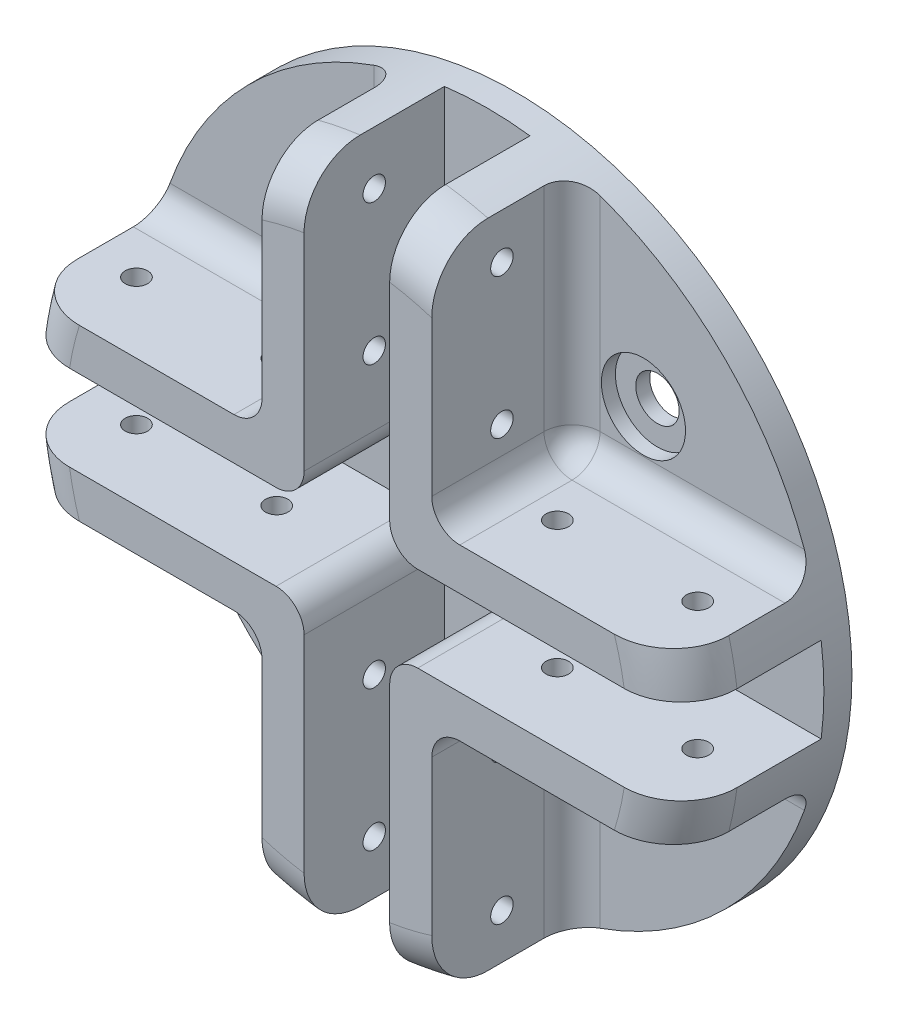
ISO-10303-21;
HEADER;
FILE_DESCRIPTION(('STEP AP214'),'2;1');
FILE_NAME('part.step','',(''),(''),'','','');
FILE_SCHEMA(('AUTOMOTIVE_DESIGN { 1 0 10303 214 1 1 1 1 }'));
ENDSEC;
DATA;
#1=APPLICATION_CONTEXT('core data for automotive mechanical design processes');
#2=APPLICATION_PROTOCOL_DEFINITION('international standard','automotive_design',2000,#1);
#3=PRODUCT_CONTEXT('',#1,'mechanical');
#4=PRODUCT('Part','Part','',(#3));
#5=PRODUCT_RELATED_PRODUCT_CATEGORY('part','',(#4));
#6=PRODUCT_DEFINITION_FORMATION('','',#4);
#7=PRODUCT_DEFINITION_CONTEXT('part definition',#1,'design');
#8=PRODUCT_DEFINITION('design','',#6,#7);
#9=PRODUCT_DEFINITION_SHAPE('','',#8);
#10=(LENGTH_UNIT() NAMED_UNIT(*) SI_UNIT(.MILLI.,.METRE.));
#11=(NAMED_UNIT(*) PLANE_ANGLE_UNIT() SI_UNIT($,.RADIAN.));
#12=(NAMED_UNIT(*) SI_UNIT($,.STERADIAN.) SOLID_ANGLE_UNIT());
#13=UNCERTAINTY_MEASURE_WITH_UNIT(LENGTH_MEASURE(1.E-05),#10,'distance_accuracy_value','');
#14=(GEOMETRIC_REPRESENTATION_CONTEXT(3) GLOBAL_UNCERTAINTY_ASSIGNED_CONTEXT((#13)) GLOBAL_UNIT_ASSIGNED_CONTEXT((#10,
#11,#12)) REPRESENTATION_CONTEXT('',''));
#15=CARTESIAN_POINT('',(0.,0.,0.));
#16=DIRECTION('',(0.,0.,1.));
#17=DIRECTION('',(1.,0.,0.));
#18=AXIS2_PLACEMENT_3D('',#15,#16,#17);
#19=CARTESIAN_POINT('',(0.,0.,2.));
#20=DIRECTION('',(0.,0.,1.));
#21=DIRECTION('',(1.,0.,0.));
#22=AXIS2_PLACEMENT_3D('',#19,#20,#21);
#23=PLANE('',#22);
#24=CARTESIAN_POINT('',(5.05000000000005,-5.04999999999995,2.));
#25=DIRECTION('',(0.,0.,1.));
#26=DIRECTION('',(0.,1.,0.));
#27=AXIS2_PLACEMENT_3D('',#24,#25,#26);
#28=CIRCLE('',#27,2.);
#29=CARTESIAN_POINT('',(5.05000000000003,-3.04999999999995,2.));
#30=VERTEX_POINT('',#29);
#31=CARTESIAN_POINT('',(3.05000000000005,-5.04999999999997,2.));
#32=VERTEX_POINT('',#31);
#33=EDGE_CURVE('E374',#30,#32,#28,.T.);
#34=ORIENTED_EDGE('',*,*,#33,.F.);
#35=DIRECTION('',(-1.,0.,0.));
#36=VECTOR('',#35,1.);
#37=CARTESIAN_POINT('',(23.8054090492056,-3.04999999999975,2.));
#38=LINE('',#37,#36);
#39=CARTESIAN_POINT('',(23.8054090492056,-3.04999999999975,2.));
#40=VERTEX_POINT('',#39);
#41=EDGE_CURVE('E352',#40,#30,#38,.T.);
#42=ORIENTED_EDGE('',*,*,#41,.F.);
#43=CARTESIAN_POINT('',(0.,0.,2.));
#44=DIRECTION('',(0.,0.,1.));
#45=DIRECTION('',(1.,0.,0.));
#46=AXIS2_PLACEMENT_3D('',#43,#44,#45);
#47=CIRCLE('',#46,24.);
#48=CARTESIAN_POINT('',(23.8054090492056,3.05,2.));
#49=VERTEX_POINT('',#48);
#50=EDGE_CURVE('E594',#40,#49,#47,.T.);
#51=ORIENTED_EDGE('',*,*,#50,.T.);
#52=DIRECTION('',(1.,0.,0.));
#53=VECTOR('',#52,1.);
#54=CARTESIAN_POINT('',(5.05,3.05,2.));
#55=LINE('',#54,#53);
#56=CARTESIAN_POINT('',(5.05,3.05,2.));
#57=VERTEX_POINT('',#56);
#58=EDGE_CURVE('E497',#57,#49,#55,.T.);
#59=ORIENTED_EDGE('',*,*,#58,.F.);
#60=CARTESIAN_POINT('',(5.05,5.05,2.));
#61=DIRECTION('',(0.,0.,1.));
#62=DIRECTION('',(-1.,0.,0.));
#63=AXIS2_PLACEMENT_3D('',#60,#61,#62);
#64=CIRCLE('',#63,2.);
#65=CARTESIAN_POINT('',(3.05,5.05,2.));
#66=VERTEX_POINT('',#65);
#67=EDGE_CURVE('E513',#66,#57,#64,.T.);
#68=ORIENTED_EDGE('',*,*,#67,.F.);
#69=DIRECTION('',(0.,-1.,0.));
#70=VECTOR('',#69,1.);
#71=CARTESIAN_POINT('',(3.05,23.8054090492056,2.));
#72=LINE('',#71,#70);
#73=CARTESIAN_POINT('',(3.05,23.8054090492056,2.));
#74=VERTEX_POINT('',#73);
#75=EDGE_CURVE('E510',#74,#66,#72,.T.);
#76=ORIENTED_EDGE('',*,*,#75,.F.);
#77=CARTESIAN_POINT('',(-3.05000000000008,23.8054090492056,2.));
#78=VERTEX_POINT('',#77);
#79=EDGE_CURVE('E586',#74,#78,#47,.T.);
#80=ORIENTED_EDGE('',*,*,#79,.T.);
#81=DIRECTION('',(0.,1.,0.));
#82=VECTOR('',#81,1.);
#83=CARTESIAN_POINT('',(-3.05000000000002,5.04999999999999,2.));
#84=LINE('',#83,#82);
#85=CARTESIAN_POINT('',(-3.05000000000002,5.04999999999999,2.));
#86=VERTEX_POINT('',#85);
#87=EDGE_CURVE('E438',#86,#78,#84,.T.);
#88=ORIENTED_EDGE('',*,*,#87,.F.);
#89=CARTESIAN_POINT('',(-5.05000000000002,5.04999999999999,2.));
#90=DIRECTION('',(0.,0.,1.));
#91=DIRECTION('',(0.,-1.,0.));
#92=AXIS2_PLACEMENT_3D('',#89,#90,#91);
#93=CIRCLE('',#92,2.);
#94=CARTESIAN_POINT('',(-5.05000000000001,3.04999999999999,2.));
#95=VERTEX_POINT('',#94);
#96=EDGE_CURVE('E452',#95,#86,#93,.T.);
#97=ORIENTED_EDGE('',*,*,#96,.F.);
#98=DIRECTION('',(1.,0.,0.));
#99=VECTOR('',#98,1.);
#100=CARTESIAN_POINT('',(-23.8054090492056,3.04999999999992,2.));
#101=LINE('',#100,#99);
#102=CARTESIAN_POINT('',(-23.8054090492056,3.04999999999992,2.));
#103=VERTEX_POINT('',#102);
#104=EDGE_CURVE('E434',#103,#95,#101,.T.);
#105=ORIENTED_EDGE('',*,*,#104,.F.);
#106=CARTESIAN_POINT('',(-23.8054090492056,-3.05,2.));
#107=VERTEX_POINT('',#106);
#108=EDGE_CURVE('E591',#103,#107,#47,.T.);
#109=ORIENTED_EDGE('',*,*,#108,.T.);
#110=DIRECTION('',(-1.,0.,0.));
#111=VECTOR('',#110,1.);
#112=CARTESIAN_POINT('',(-5.05,-3.05,2.));
#113=LINE('',#112,#111);
#114=CARTESIAN_POINT('',(-5.05,-3.05,2.));
#115=VERTEX_POINT('',#114);
#116=EDGE_CURVE('E396',#115,#107,#113,.T.);
#117=ORIENTED_EDGE('',*,*,#116,.F.);
#118=CARTESIAN_POINT('',(-5.05,-5.05,2.));
#119=DIRECTION('',(0.,0.,1.));
#120=DIRECTION('',(1.,0.,0.));
#121=AXIS2_PLACEMENT_3D('',#118,#119,#120);
#122=CIRCLE('',#121,2.);
#123=CARTESIAN_POINT('',(-3.05,-5.05,2.));
#124=VERTEX_POINT('',#123);
#125=EDGE_CURVE('E410',#124,#115,#122,.T.);
#126=ORIENTED_EDGE('',*,*,#125,.F.);
#127=DIRECTION('',(0.,1.,0.));
#128=VECTOR('',#127,1.);
#129=CARTESIAN_POINT('',(-3.05,-23.8054090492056,2.));
#130=LINE('',#129,#128);
#131=CARTESIAN_POINT('',(-3.05,-23.8054090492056,2.));
#132=VERTEX_POINT('',#131);
#133=EDGE_CURVE('E392',#132,#124,#130,.T.);
#134=ORIENTED_EDGE('',*,*,#133,.F.);
#135=CARTESIAN_POINT('',(3.05000000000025,-23.8054090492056,2.));
#136=VERTEX_POINT('',#135);
#137=EDGE_CURVE('E1136',#132,#136,#47,.T.);
#138=ORIENTED_EDGE('',*,*,#137,.T.);
#139=DIRECTION('',(0.,-1.,0.));
#140=VECTOR('',#139,1.);
#141=CARTESIAN_POINT('',(3.05000000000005,-5.04999999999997,2.));
#142=LINE('',#141,#140);
#143=EDGE_CURVE('E345',#32,#136,#142,.T.);
#144=ORIENTED_EDGE('',*,*,#143,.F.);
#145=EDGE_LOOP('',(#34,#42,#51,#59,#68,#76,#80,#88,#97,#105,#109,#117,#126,#134,#138,#144));
#146=FACE_BOUND('',#145,.T.);
#147=ADVANCED_FACE('F34',(#146),#23,.T.);
#148=CARTESIAN_POINT('',(11.1369318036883,-11.136931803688,2.));
#149=DIRECTION('',(0.,0.,1.));
#150=DIRECTION('',(0.,-1.,0.));
#151=AXIS2_PLACEMENT_3D('',#148,#149,#150);
#152=CIRCLE('',#151,3.);
#153=CARTESIAN_POINT('',(11.1369318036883,-14.136931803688,2.));
#154=VERTEX_POINT('',#153);
#155=EDGE_CURVE('E541',#154,#154,#152,.T.);
#156=ORIENTED_EDGE('',*,*,#155,.F.);
#157=EDGE_LOOP('',(#156));
#158=FACE_BOUND('',#157,.T.);
#159=CARTESIAN_POINT('',(8.05000000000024,-22.6096771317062,2.));
#160=VERTEX_POINT('',#159);
#161=CARTESIAN_POINT('',(22.6096771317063,-8.04999999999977,2.));
#162=VERTEX_POINT('',#161);
#163=EDGE_CURVE('E770',#160,#162,#47,.T.);
#164=ORIENTED_EDGE('',*,*,#163,.T.);
#165=DIRECTION('',(1.,0.,0.));
#166=VECTOR('',#165,1.);
#167=CARTESIAN_POINT('',(0.,-8.05,2.));
#168=LINE('',#167,#166);
#169=CARTESIAN_POINT('',(8.05000000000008,-8.04999999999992,2.));
#170=VERTEX_POINT('',#169);
#171=EDGE_CURVE('E648',#162,#170,#168,.F.);
#172=ORIENTED_EDGE('',*,*,#171,.T.);
#173=DIRECTION('',(0.,1.,0.));
#174=VECTOR('',#173,1.);
#175=CARTESIAN_POINT('',(8.05,0.,2.));
#176=LINE('',#175,#174);
#177=EDGE_CURVE('E646',#170,#160,#176,.F.);
#178=ORIENTED_EDGE('',*,*,#177,.T.);
#179=EDGE_LOOP('',(#164,#172,#178));
#180=FACE_BOUND('',#179,.T.);
#181=ADVANCED_FACE('F1054',(#158,#180),#23,.T.);
#182=CARTESIAN_POINT('',(-11.1369318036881,-11.1369318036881,2.));
#183=DIRECTION('',(0.,0.,1.));
#184=DIRECTION('',(-1.,0.,0.));
#185=AXIS2_PLACEMENT_3D('',#182,#183,#184);
#186=CIRCLE('',#185,3.);
#187=CARTESIAN_POINT('',(-14.1369318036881,-11.1369318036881,2.));
#188=VERTEX_POINT('',#187);
#189=EDGE_CURVE('E557',#188,#188,#186,.T.);
#190=ORIENTED_EDGE('',*,*,#189,.F.);
#191=EDGE_LOOP('',(#190));
#192=FACE_BOUND('',#191,.T.);
#193=CARTESIAN_POINT('',(-22.6096771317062,-8.05,2.));
#194=VERTEX_POINT('',#193);
#195=CARTESIAN_POINT('',(-8.05,-22.6096771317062,2.));
#196=VERTEX_POINT('',#195);
#197=EDGE_CURVE('E590',#194,#196,#47,.T.);
#198=ORIENTED_EDGE('',*,*,#197,.T.);
#199=DIRECTION('',(0.,-1.,0.));
#200=VECTOR('',#199,1.);
#201=CARTESIAN_POINT('',(-8.05,0.,2.));
#202=LINE('',#201,#200);
#203=CARTESIAN_POINT('',(-8.05,-8.05,2.));
#204=VERTEX_POINT('',#203);
#205=EDGE_CURVE('E657',#196,#204,#202,.F.);
#206=ORIENTED_EDGE('',*,*,#205,.T.);
#207=DIRECTION('',(1.,0.,0.));
#208=VECTOR('',#207,1.);
#209=CARTESIAN_POINT('',(0.,-8.05,2.));
#210=LINE('',#209,#208);
#211=EDGE_CURVE('E655',#204,#194,#210,.F.);
#212=ORIENTED_EDGE('',*,*,#211,.T.);
#213=EDGE_LOOP('',(#198,#206,#212));
#214=FACE_BOUND('',#213,.T.);
#215=ADVANCED_FACE('F1060',(#192,#214),#23,.T.);
#216=CARTESIAN_POINT('',(-11.1369318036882,11.1369318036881,2.));
#217=DIRECTION('',(0.,0.,1.));
#218=DIRECTION('',(0.,1.,0.));
#219=AXIS2_PLACEMENT_3D('',#216,#217,#218);
#220=CIRCLE('',#219,3.);
#221=CARTESIAN_POINT('',(-11.1369318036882,14.1369318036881,2.));
#222=VERTEX_POINT('',#221);
#223=EDGE_CURVE('E551',#222,#222,#220,.T.);
#224=ORIENTED_EDGE('',*,*,#223,.F.);
#225=EDGE_LOOP('',(#224));
#226=FACE_BOUND('',#225,.T.);
#227=CARTESIAN_POINT('',(-8.05000000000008,22.6096771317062,2.));
#228=VERTEX_POINT('',#227);
#229=CARTESIAN_POINT('',(-22.6096771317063,8.04999999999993,2.));
#230=VERTEX_POINT('',#229);
#231=EDGE_CURVE('E589',#228,#230,#47,.T.);
#232=ORIENTED_EDGE('',*,*,#231,.T.);
#233=DIRECTION('',(-1.,0.,0.));
#234=VECTOR('',#233,1.);
#235=CARTESIAN_POINT('',(0.,8.05,2.));
#236=LINE('',#235,#234);
#237=CARTESIAN_POINT('',(-8.05000000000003,8.04999999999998,2.));
#238=VERTEX_POINT('',#237);
#239=EDGE_CURVE('E630',#230,#238,#236,.F.);
#240=ORIENTED_EDGE('',*,*,#239,.T.);
#241=DIRECTION('',(0.,-1.,0.));
#242=VECTOR('',#241,1.);
#243=CARTESIAN_POINT('',(-8.05,0.,2.));
#244=LINE('',#243,#242);
#245=EDGE_CURVE('E628',#238,#228,#244,.F.);
#246=ORIENTED_EDGE('',*,*,#245,.T.);
#247=EDGE_LOOP('',(#232,#240,#246));
#248=FACE_BOUND('',#247,.T.);
#249=ADVANCED_FACE('F1065',(#226,#248),#23,.T.);
#250=CARTESIAN_POINT('',(22.6096771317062,8.05,2.));
#251=VERTEX_POINT('',#250);
#252=CARTESIAN_POINT('',(8.05,22.6096771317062,2.));
#253=VERTEX_POINT('',#252);
#254=EDGE_CURVE('E546',#251,#253,#47,.T.);
#255=ORIENTED_EDGE('',*,*,#254,.T.);
#256=DIRECTION('',(0.,1.,0.));
#257=VECTOR('',#256,1.);
#258=CARTESIAN_POINT('',(8.05,0.,2.));
#259=LINE('',#258,#257);
#260=CARTESIAN_POINT('',(8.05,8.05,2.));
#261=VERTEX_POINT('',#260);
#262=EDGE_CURVE('E639',#253,#261,#259,.F.);
#263=ORIENTED_EDGE('',*,*,#262,.T.);
#264=DIRECTION('',(-1.,0.,0.));
#265=VECTOR('',#264,1.);
#266=CARTESIAN_POINT('',(0.,8.05,2.));
#267=LINE('',#266,#265);
#268=EDGE_CURVE('E637',#261,#251,#267,.F.);
#269=ORIENTED_EDGE('',*,*,#268,.T.);
#270=EDGE_LOOP('',(#255,#263,#269));
#271=FACE_BOUND('',#270,.T.);
#272=CARTESIAN_POINT('',(11.1369318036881,11.1369318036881,2.));
#273=DIRECTION('',(0.,0.,1.));
#274=DIRECTION('',(1.,0.,0.));
#275=AXIS2_PLACEMENT_3D('',#272,#273,#274);
#276=CIRCLE('',#275,3.);
#277=CARTESIAN_POINT('',(14.1369318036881,11.1369318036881,2.));
#278=VERTEX_POINT('',#277);
#279=EDGE_CURVE('E568',#278,#278,#276,.T.);
#280=ORIENTED_EDGE('',*,*,#279,.F.);
#281=EDGE_LOOP('',(#280));
#282=FACE_BOUND('',#281,.T.);
#283=ADVANCED_FACE('F767',(#271,#282),#23,.T.);
#284=CARTESIAN_POINT('',(11.1369318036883,-11.136931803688,0.));
#285=DIRECTION('',(0.,0.,1.));
#286=DIRECTION('',(1.,0.,0.));
#287=AXIS2_PLACEMENT_3D('',#284,#285,#286);
#288=CYLINDRICAL_SURFACE('',#287,1.55);
#289=CARTESIAN_POINT('',(11.1369318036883,-11.136931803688,0.));
#290=DIRECTION('',(0.,0.,1.));
#291=DIRECTION('',(0.,-1.,0.));
#292=AXIS2_PLACEMENT_3D('',#289,#290,#291);
#293=CIRCLE('',#292,1.55);
#294=CARTESIAN_POINT('',(11.1369318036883,-12.686931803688,0.));
#295=VERTEX_POINT('',#294);
#296=EDGE_CURVE('E572',#295,#295,#293,.T.);
#297=ORIENTED_EDGE('',*,*,#296,.F.);
#298=EDGE_LOOP('',(#297));
#299=FACE_BOUND('',#298,.T.);
#300=CARTESIAN_POINT('',(11.1369318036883,-11.136931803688,1.));
#301=DIRECTION('',(0.,0.,1.));
#302=DIRECTION('',(1.,0.,0.));
#303=AXIS2_PLACEMENT_3D('',#300,#301,#302);
#304=CIRCLE('',#303,1.55);
#305=CARTESIAN_POINT('',(12.6869318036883,-11.136931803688,1.));
#306=VERTEX_POINT('',#305);
#307=EDGE_CURVE('E575',#306,#306,#304,.F.);
#308=ORIENTED_EDGE('',*,*,#307,.F.);
#309=EDGE_LOOP('',(#308));
#310=FACE_BOUND('',#309,.T.);
#311=ADVANCED_FACE('F1064',(#299,#310),#288,.F.);
#312=CARTESIAN_POINT('',(-11.1369318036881,-11.1369318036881,0.));
#313=DIRECTION('',(0.,0.,1.));
#314=DIRECTION('',(1.,0.,0.));
#315=AXIS2_PLACEMENT_3D('',#312,#313,#314);
#316=CYLINDRICAL_SURFACE('',#315,1.55);
#317=CARTESIAN_POINT('',(-11.1369318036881,-11.1369318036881,0.));
#318=DIRECTION('',(0.,0.,1.));
#319=DIRECTION('',(-1.,0.,0.));
#320=AXIS2_PLACEMENT_3D('',#317,#318,#319);
#321=CIRCLE('',#320,1.55);
#322=CARTESIAN_POINT('',(-12.6869318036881,-11.1369318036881,0.));
#323=VERTEX_POINT('',#322);
#324=EDGE_CURVE('E569',#323,#323,#321,.T.);
#325=ORIENTED_EDGE('',*,*,#324,.F.);
#326=EDGE_LOOP('',(#325));
#327=FACE_BOUND('',#326,.T.);
#328=CARTESIAN_POINT('',(-11.1369318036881,-11.1369318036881,1.));
#329=DIRECTION('',(0.,0.,1.));
#330=DIRECTION('',(1.,0.,0.));
#331=AXIS2_PLACEMENT_3D('',#328,#329,#330);
#332=CIRCLE('',#331,1.55);
#333=CARTESIAN_POINT('',(-9.5869318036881,-11.1369318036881,1.));
#334=VERTEX_POINT('',#333);
#335=EDGE_CURVE('E599',#334,#334,#332,.F.);
#336=ORIENTED_EDGE('',*,*,#335,.F.);
#337=EDGE_LOOP('',(#336));
#338=FACE_BOUND('',#337,.T.);
#339=ADVANCED_FACE('F1070',(#327,#338),#316,.F.);
#340=CARTESIAN_POINT('',(-11.1369318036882,11.1369318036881,0.));
#341=DIRECTION('',(0.,0.,1.));
#342=DIRECTION('',(1.,0.,0.));
#343=AXIS2_PLACEMENT_3D('',#340,#341,#342);
#344=CYLINDRICAL_SURFACE('',#343,1.55);
#345=CARTESIAN_POINT('',(-11.1369318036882,11.1369318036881,0.));
#346=DIRECTION('',(0.,0.,1.));
#347=DIRECTION('',(0.,1.,0.));
#348=AXIS2_PLACEMENT_3D('',#345,#346,#347);
#349=CIRCLE('',#348,1.55);
#350=CARTESIAN_POINT('',(-11.1369318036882,12.6869318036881,0.));
#351=VERTEX_POINT('',#350);
#352=EDGE_CURVE('E565',#351,#351,#349,.T.);
#353=ORIENTED_EDGE('',*,*,#352,.F.);
#354=EDGE_LOOP('',(#353));
#355=FACE_BOUND('',#354,.T.);
#356=CARTESIAN_POINT('',(-11.1369318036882,11.1369318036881,1.));
#357=DIRECTION('',(0.,0.,1.));
#358=DIRECTION('',(1.,0.,0.));
#359=AXIS2_PLACEMENT_3D('',#356,#357,#358);
#360=CIRCLE('',#359,1.55);
#361=CARTESIAN_POINT('',(-9.58693180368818,11.1369318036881,1.));
#362=VERTEX_POINT('',#361);
#363=EDGE_CURVE('E550',#362,#362,#360,.F.);
#364=ORIENTED_EDGE('',*,*,#363,.F.);
#365=EDGE_LOOP('',(#364));
#366=FACE_BOUND('',#365,.T.);
#367=ADVANCED_FACE('F1826',(#355,#366),#344,.F.);
#368=CARTESIAN_POINT('',(11.1369318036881,11.1369318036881,0.));
#369=DIRECTION('',(0.,0.,1.));
#370=DIRECTION('',(1.,0.,0.));
#371=AXIS2_PLACEMENT_3D('',#368,#369,#370);
#372=CYLINDRICAL_SURFACE('',#371,1.55);
#373=CARTESIAN_POINT('',(11.1369318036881,11.1369318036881,0.));
#374=DIRECTION('',(0.,0.,1.));
#375=DIRECTION('',(1.,0.,0.));
#376=AXIS2_PLACEMENT_3D('',#373,#374,#375);
#377=CIRCLE('',#376,1.55);
#378=CARTESIAN_POINT('',(12.6869318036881,11.1369318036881,0.));
#379=VERTEX_POINT('',#378);
#380=EDGE_CURVE('E582',#379,#379,#377,.T.);
#381=ORIENTED_EDGE('',*,*,#380,.F.);
#382=EDGE_LOOP('',(#381));
#383=FACE_BOUND('',#382,.T.);
#384=CARTESIAN_POINT('',(11.1369318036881,11.1369318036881,1.));
#385=DIRECTION('',(0.,0.,1.));
#386=DIRECTION('',(1.,0.,0.));
#387=AXIS2_PLACEMENT_3D('',#384,#385,#386);
#388=CIRCLE('',#387,1.55);
#389=CARTESIAN_POINT('',(12.6869318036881,11.1369318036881,1.));
#390=VERTEX_POINT('',#389);
#391=EDGE_CURVE('E579',#390,#390,#388,.F.);
#392=ORIENTED_EDGE('',*,*,#391,.F.);
#393=EDGE_LOOP('',(#392));
#394=FACE_BOUND('',#393,.T.);
#395=ADVANCED_FACE('F1649',(#383,#394),#372,.F.);
#396=CARTESIAN_POINT('',(0.,0.,2.));
#397=DIRECTION('',(0.,0.,-1.));
#398=DIRECTION('',(-1.,0.,0.));
#399=AXIS2_PLACEMENT_3D('',#396,#397,#398);
#400=CYLINDRICAL_SURFACE('',#399,24.);
#401=DIRECTION('',(0.,0.,-1.));
#402=VECTOR('',#401,1.);
#403=CARTESIAN_POINT('',(23.8054090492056,-3.04999999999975,12.));
#404=LINE('',#403,#402);
#405=CARTESIAN_POINT('',(23.8054090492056,-3.04999999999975,8.));
#406=VERTEX_POINT('',#405);
#407=EDGE_CURVE('E355',#406,#40,#404,.T.);
#408=ORIENTED_EDGE('',*,*,#407,.F.);
#409=CARTESIAN_POINT('',(0.,0.,8.));
#410=DIRECTION('',(0.,0.,1.));
#411=DIRECTION('',(1.,0.,0.));
#412=AXIS2_PLACEMENT_3D('',#409,#410,#411);
#413=CIRCLE('',#412,24.);
#414=CARTESIAN_POINT('',(23.2249327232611,-6.04999999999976,8.));
#415=VERTEX_POINT('',#414);
#416=EDGE_CURVE('E916',#406,#415,#413,.F.);
#417=ORIENTED_EDGE('',*,*,#416,.T.);
#418=DIRECTION('',(0.,0.,-1.));
#419=VECTOR('',#418,1.);
#420=CARTESIAN_POINT('',(23.2249327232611,-6.04999999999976,12.));
#421=LINE('',#420,#419);
#422=CARTESIAN_POINT('',(23.2249327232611,-6.04999999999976,4.));
#423=VERTEX_POINT('',#422);
#424=EDGE_CURVE('E372',#415,#423,#421,.T.);
#425=ORIENTED_EDGE('',*,*,#424,.T.);
#426=CARTESIAN_POINT('',(23.2249327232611,-6.04999999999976,4.));
#427=CARTESIAN_POINT('',(23.2249317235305,-6.04999947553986,3.94518150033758));
#428=CARTESIAN_POINT('',(23.2243453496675,-6.05225530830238,3.89038959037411));
#429=CARTESIAN_POINT('',(23.2220002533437,-6.06124873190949,3.78120522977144));
#430=CARTESIAN_POINT('',(23.220241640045,-6.06798590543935,3.72681274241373));
#431=CARTESIAN_POINT('',(23.2132159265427,-6.09483142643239,3.56499287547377));
#432=CARTESIAN_POINT('',(23.2061989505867,-6.12157411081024,3.45866168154));
#433=CARTESIAN_POINT('',(23.1875426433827,-6.19186330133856,3.25217433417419));
#434=CARTESIAN_POINT('',(23.1759021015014,-6.23541420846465,3.1520198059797));
#435=CARTESIAN_POINT('',(23.1480932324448,-6.33786922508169,2.96058244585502));
#436=CARTESIAN_POINT('',(23.1319248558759,-6.39677350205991,2.86929971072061));
#437=CARTESIAN_POINT('',(23.0950306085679,-6.52872798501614,2.69706913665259));
#438=CARTESIAN_POINT('',(23.0742578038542,-6.60192286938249,2.61624239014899));
#439=CARTESIAN_POINT('',(23.0285231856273,-6.75972317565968,2.46803855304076));
#440=CARTESIAN_POINT('',(23.0035607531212,-6.84433028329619,2.40066345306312));
#441=CARTESIAN_POINT('',(22.9490031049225,-7.02512832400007,2.2789907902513));
#442=CARTESIAN_POINT('',(22.9192896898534,-7.12159410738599,2.22515543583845));
#443=CARTESIAN_POINT('',(22.8563418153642,-7.32110509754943,2.13432893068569));
#444=CARTESIAN_POINT('',(22.8231065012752,-7.42415189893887,2.09734188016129));
#445=CARTESIAN_POINT('',(22.7602357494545,-7.61444303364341,2.04599850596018));
#446=CARTESIAN_POINT('',(22.7310763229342,-7.70107246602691,2.02871676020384));
#447=CARTESIAN_POINT('',(22.671344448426,-7.87519755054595,2.0057181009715));
#448=CARTESIAN_POINT('',(22.6407746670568,-7.96269134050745,1.99998020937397));
#449=CARTESIAN_POINT('',(22.6096771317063,-8.04999999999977,2.));
#450=B_SPLINE_CURVE_WITH_KNOTS('',3,(#426,#427,#428,#429,#430,#431,#432,#433,#434,#435,#436,
#437,#438,#439,#440,#441,#442,#443,#444,#445,#446,#447,#448,#449),.UNSPECIFIED.,.F.,.F.,(4,2,2,
2,2,2,2,2,2,2,2,4),(0.,0.164353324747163,0.328691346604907,0.656593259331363,0.984581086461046,
1.31257249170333,1.64407495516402,1.97562643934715,2.31730312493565,2.65906291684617,
2.93742028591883,3.21527135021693),.UNSPECIFIED.);
#451=EDGE_CURVE('E747',#423,#162,#450,.T.);
#452=ORIENTED_EDGE('',*,*,#451,.T.);
#453=ORIENTED_EDGE('',*,*,#163,.F.);
#454=CARTESIAN_POINT('',(8.05000000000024,-22.6096771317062,2.));
#455=CARTESIAN_POINT('',(7.99240199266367,-22.6301857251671,2.00000216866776));
#456=CARTESIAN_POINT('',(7.93474889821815,-22.6504630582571,2.00248980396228));
#457=CARTESIAN_POINT('',(7.81966786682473,-22.6904495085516,2.01246662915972));
#458=CARTESIAN_POINT('',(7.76223997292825,-22.710158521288,2.01995673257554));
#459=CARTESIAN_POINT('',(7.59078246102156,-22.7682790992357,2.04998348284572));
#460=CARTESIAN_POINT('',(7.47762646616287,-22.8056673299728,2.0800766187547));
#461=CARTESIAN_POINT('',(7.25715043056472,-22.8767838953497,2.16011408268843));
#462=CARTESIAN_POINT('',(7.14984024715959,-22.9105061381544,2.21009082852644));
#463=CARTESIAN_POINT('',(6.94483771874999,-22.9734785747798,2.32888568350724));
#464=CARTESIAN_POINT('',(6.84713644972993,-23.0027329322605,2.39768608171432));
#465=CARTESIAN_POINT('',(6.66825085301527,-23.0552122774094,2.54947961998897));
#466=CARTESIAN_POINT('',(6.58658070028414,-23.0786238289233,2.63183566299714));
#467=CARTESIAN_POINT('',(6.43819792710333,-23.1204577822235,2.81023284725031));
#468=CARTESIAN_POINT('',(6.37148767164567,-23.1388793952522,2.90627614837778));
#469=CARTESIAN_POINT('',(6.25801228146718,-23.169821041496,3.10484154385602));
#470=CARTESIAN_POINT('',(6.21052125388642,-23.1825582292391,3.20691612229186));
#471=CARTESIAN_POINT('',(6.13327279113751,-23.2031157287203,3.41797774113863));
#472=CARTESIAN_POINT('',(6.10349582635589,-23.2109414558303,3.5269570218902));
#473=CARTESIAN_POINT('',(6.07208541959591,-23.2191709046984,3.69741415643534));
#474=CARTESIAN_POINT('',(6.06380644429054,-23.2213329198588,3.75765978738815));
#475=CARTESIAN_POINT('',(6.05276682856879,-23.2242121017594,3.87859370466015));
#476=CARTESIAN_POINT('',(6.04999758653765,-23.2249315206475,3.93928115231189));
#477=CARTESIAN_POINT('',(6.05000000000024,-23.2249327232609,4.));
#478=B_SPLINE_CURVE_WITH_KNOTS('',3,(#454,#455,#456,#457,#458,#459,#460,#461,#462,#463,#464,
#465,#466,#467,#468,#469,#470,#471,#472,#473,#474,#475,#476,#477),.UNSPECIFIED.,.F.,.F.,(4,2,2,
2,2,2,2,2,2,2,2,4),(0.,0.183316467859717,0.366666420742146,0.733515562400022,1.1009652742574,
1.468070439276,1.82125538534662,2.1744961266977,2.51275578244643,2.85064181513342,
3.03295398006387,3.21498130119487),.UNSPECIFIED.);
#479=CARTESIAN_POINT('',(6.05000000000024,-23.224932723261,4.));
#480=VERTEX_POINT('',#479);
#481=EDGE_CURVE('E728',#160,#480,#478,.T.);
#482=ORIENTED_EDGE('',*,*,#481,.T.);
#483=DIRECTION('',(0.,0.,-1.));
#484=VECTOR('',#483,1.);
#485=CARTESIAN_POINT('',(6.05000000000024,-23.224932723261,12.));
#486=LINE('',#485,#484);
#487=CARTESIAN_POINT('',(6.05000000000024,-23.224932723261,8.));
#488=VERTEX_POINT('',#487);
#489=EDGE_CURVE('E386',#488,#480,#486,.T.);
#490=ORIENTED_EDGE('',*,*,#489,.F.);
#491=CARTESIAN_POINT('',(0.,0.,8.));
#492=DIRECTION('',(0.,0.,1.));
#493=DIRECTION('',(1.,0.,0.));
#494=AXIS2_PLACEMENT_3D('',#491,#492,#493);
#495=CIRCLE('',#494,24.);
#496=CARTESIAN_POINT('',(3.05000000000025,-23.8054090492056,8.));
#497=VERTEX_POINT('',#496);
#498=EDGE_CURVE('E1144',#488,#497,#495,.F.);
#499=ORIENTED_EDGE('',*,*,#498,.T.);
#500=DIRECTION('',(0.,0.,-1.));
#501=VECTOR('',#500,1.);
#502=CARTESIAN_POINT('',(3.05000000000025,-23.8054090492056,12.));
#503=LINE('',#502,#501);
#504=EDGE_CURVE('E388',#497,#136,#503,.T.);
#505=ORIENTED_EDGE('',*,*,#504,.T.);
#506=ORIENTED_EDGE('',*,*,#137,.F.);
#507=DIRECTION('',(0.,0.,-1.));
#508=VECTOR('',#507,1.);
#509=CARTESIAN_POINT('',(-3.05,-23.8054090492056,12.));
#510=LINE('',#509,#508);
#511=CARTESIAN_POINT('',(-3.05,-23.8054090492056,8.));
#512=VERTEX_POINT('',#511);
#513=EDGE_CURVE('E432',#512,#132,#510,.T.);
#514=ORIENTED_EDGE('',*,*,#513,.F.);
#515=CARTESIAN_POINT('',(0.,0.,8.));
#516=DIRECTION('',(0.,0.,1.));
#517=DIRECTION('',(1.,0.,0.));
#518=AXIS2_PLACEMENT_3D('',#515,#516,#517);
#519=CIRCLE('',#518,24.);
#520=CARTESIAN_POINT('',(-6.05,-23.224932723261,8.));
#521=VERTEX_POINT('',#520);
#522=EDGE_CURVE('E810',#512,#521,#519,.F.);
#523=ORIENTED_EDGE('',*,*,#522,.T.);
#524=DIRECTION('',(0.,0.,-1.));
#525=VECTOR('',#524,1.);
#526=CARTESIAN_POINT('',(-6.05,-23.224932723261,12.));
#527=LINE('',#526,#525);
#528=CARTESIAN_POINT('',(-6.05,-23.224932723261,4.));
#529=VERTEX_POINT('',#528);
#530=EDGE_CURVE('E407',#521,#529,#527,.T.);
#531=ORIENTED_EDGE('',*,*,#530,.T.);
#532=CARTESIAN_POINT('',(-6.05,-23.224932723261,4.));
#533=CARTESIAN_POINT('',(-6.0499994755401,-23.2249317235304,3.94518150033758));
#534=CARTESIAN_POINT('',(-6.05225530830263,-23.2243453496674,3.8903895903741));
#535=CARTESIAN_POINT('',(-6.06124873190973,-23.2220002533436,3.78120522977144));
#536=CARTESIAN_POINT('',(-6.06798590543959,-23.220241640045,3.72681274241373));
#537=CARTESIAN_POINT('',(-6.09483142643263,-23.2132159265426,3.56499287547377));
#538=CARTESIAN_POINT('',(-6.12157411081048,-23.2061989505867,3.45866168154));
#539=CARTESIAN_POINT('',(-6.1918633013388,-23.1875426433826,3.25217433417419));
#540=CARTESIAN_POINT('',(-6.23541420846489,-23.1759021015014,3.1520198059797));
#541=CARTESIAN_POINT('',(-6.33786922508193,-23.1480932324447,2.96058244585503));
#542=CARTESIAN_POINT('',(-6.39677350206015,-23.1319248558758,2.86929971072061));
#543=CARTESIAN_POINT('',(-6.52872798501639,-23.0950306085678,2.69706913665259));
#544=CARTESIAN_POINT('',(-6.60192286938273,-23.0742578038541,2.61624239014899));
#545=CARTESIAN_POINT('',(-6.75972317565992,-23.0285231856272,2.46803855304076));
#546=CARTESIAN_POINT('',(-6.84433028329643,-23.0035607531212,2.40066345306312));
#547=CARTESIAN_POINT('',(-7.02512832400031,-22.9490031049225,2.2789907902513));
#548=CARTESIAN_POINT('',(-7.12159410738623,-22.9192896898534,2.22515543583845));
#549=CARTESIAN_POINT('',(-7.32110509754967,-22.8563418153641,2.13432893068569));
#550=CARTESIAN_POINT('',(-7.42415189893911,-22.8231065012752,2.09734188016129));
#551=CARTESIAN_POINT('',(-7.61444303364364,-22.7602357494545,2.04599850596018));
#552=CARTESIAN_POINT('',(-7.70107246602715,-22.7310763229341,2.02871676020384));
#553=CARTESIAN_POINT('',(-7.87519755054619,-22.6713444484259,2.0057181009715));
#554=CARTESIAN_POINT('',(-7.96269134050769,-22.6407746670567,1.99998020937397));
#555=CARTESIAN_POINT('',(-8.05,-22.6096771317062,2.));
#556=B_SPLINE_CURVE_WITH_KNOTS('',3,(#532,#533,#534,#535,#536,#537,#538,#539,#540,#541,#542,
#543,#544,#545,#546,#547,#548,#549,#550,#551,#552,#553,#554,#555),.UNSPECIFIED.,.F.,.F.,(4,2,2,
2,2,2,2,2,2,2,2,4),(0.,0.164353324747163,0.328691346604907,0.656593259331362,0.984581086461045,
1.31257249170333,1.64407495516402,1.97562643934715,2.31730312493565,2.65906291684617,
2.93742028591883,3.21527135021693),.UNSPECIFIED.);
#557=EDGE_CURVE('E715',#529,#196,#556,.T.);
#558=ORIENTED_EDGE('',*,*,#557,.T.);
#559=ORIENTED_EDGE('',*,*,#197,.F.);
#560=CARTESIAN_POINT('',(-22.6096771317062,-8.05,2.));
#561=CARTESIAN_POINT('',(-22.6301857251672,-7.99240199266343,2.00000216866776));
#562=CARTESIAN_POINT('',(-22.6504630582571,-7.93474889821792,2.00248980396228));
#563=CARTESIAN_POINT('',(-22.6904495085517,-7.81966786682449,2.01246662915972));
#564=CARTESIAN_POINT('',(-22.710158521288,-7.76223997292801,2.01995673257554));
#565=CARTESIAN_POINT('',(-22.7682790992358,-7.59078246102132,2.04998348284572));
#566=CARTESIAN_POINT('',(-22.8056673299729,-7.47762646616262,2.0800766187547));
#567=CARTESIAN_POINT('',(-22.8767838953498,-7.25715043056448,2.16011408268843));
#568=CARTESIAN_POINT('',(-22.9105061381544,-7.14984024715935,2.21009082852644));
#569=CARTESIAN_POINT('',(-22.9734785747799,-6.94483771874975,2.32888568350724));
#570=CARTESIAN_POINT('',(-23.0027329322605,-6.84713644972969,2.39768608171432));
#571=CARTESIAN_POINT('',(-23.0552122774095,-6.66825085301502,2.54947961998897));
#572=CARTESIAN_POINT('',(-23.0786238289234,-6.58658070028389,2.63183566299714));
#573=CARTESIAN_POINT('',(-23.1204577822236,-6.43819792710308,2.81023284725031));
#574=CARTESIAN_POINT('',(-23.1388793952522,-6.37148767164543,2.90627614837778));
#575=CARTESIAN_POINT('',(-23.169821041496,-6.25801228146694,3.10484154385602));
#576=CARTESIAN_POINT('',(-23.1825582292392,-6.21052125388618,3.20691612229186));
#577=CARTESIAN_POINT('',(-23.2031157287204,-6.13327279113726,3.41797774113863));
#578=CARTESIAN_POINT('',(-23.2109414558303,-6.10349582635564,3.5269570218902));
#579=CARTESIAN_POINT('',(-23.2191709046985,-6.07208541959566,3.69741415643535));
#580=CARTESIAN_POINT('',(-23.2213329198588,-6.06380644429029,3.75765978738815));
#581=CARTESIAN_POINT('',(-23.2242121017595,-6.05276682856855,3.87859370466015));
#582=CARTESIAN_POINT('',(-23.2249315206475,-6.04999758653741,3.93928115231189));
#583=CARTESIAN_POINT('',(-23.224932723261,-6.05,4.));
#584=B_SPLINE_CURVE_WITH_KNOTS('',3,(#560,#561,#562,#563,#564,#565,#566,#567,#568,#569,#570,
#571,#572,#573,#574,#575,#576,#577,#578,#579,#580,#581,#582,#583),.UNSPECIFIED.,.F.,.F.,(4,2,2,
2,2,2,2,2,2,2,2,4),(0.,0.183316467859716,0.366666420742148,0.733515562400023,1.1009652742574,
1.468070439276,1.82125538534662,2.1744961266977,2.51275578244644,2.85064181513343,
3.03295398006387,3.21498130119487),.UNSPECIFIED.);
#585=CARTESIAN_POINT('',(-23.224932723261,-6.05,4.));
#586=VERTEX_POINT('',#585);
#587=EDGE_CURVE('E800',#194,#586,#584,.T.);
#588=ORIENTED_EDGE('',*,*,#587,.T.);
#589=DIRECTION('',(0.,0.,-1.));
#590=VECTOR('',#589,1.);
#591=CARTESIAN_POINT('',(-23.224932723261,-6.05,12.));
#592=LINE('',#591,#590);
#593=CARTESIAN_POINT('',(-23.224932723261,-6.05,8.));
#594=VERTEX_POINT('',#593);
#595=EDGE_CURVE('E422',#594,#586,#592,.T.);
#596=ORIENTED_EDGE('',*,*,#595,.F.);
#597=CARTESIAN_POINT('',(0.,0.,8.));
#598=DIRECTION('',(0.,0.,1.));
#599=DIRECTION('',(1.,0.,0.));
#600=AXIS2_PLACEMENT_3D('',#597,#598,#599);
#601=CIRCLE('',#600,24.);
#602=CARTESIAN_POINT('',(-23.8054090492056,-3.05,8.));
#603=VERTEX_POINT('',#602);
#604=EDGE_CURVE('E1196',#594,#603,#601,.F.);
#605=ORIENTED_EDGE('',*,*,#604,.T.);
#606=DIRECTION('',(0.,0.,-1.));
#607=VECTOR('',#606,1.);
#608=CARTESIAN_POINT('',(-23.8054090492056,-3.05,12.));
#609=LINE('',#608,#607);
#610=EDGE_CURVE('E424',#603,#107,#609,.T.);
#611=ORIENTED_EDGE('',*,*,#610,.T.);
#612=ORIENTED_EDGE('',*,*,#108,.F.);
#613=DIRECTION('',(0.,0.,-1.));
#614=VECTOR('',#613,1.);
#615=CARTESIAN_POINT('',(-23.8054090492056,3.04999999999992,12.));
#616=LINE('',#615,#614);
#617=CARTESIAN_POINT('',(-23.8054090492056,3.04999999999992,8.));
#618=VERTEX_POINT('',#617);
#619=EDGE_CURVE('E473',#618,#103,#616,.T.);
#620=ORIENTED_EDGE('',*,*,#619,.F.);
#621=CARTESIAN_POINT('',(0.,0.,8.));
#622=DIRECTION('',(0.,0.,1.));
#623=DIRECTION('',(1.,0.,0.));
#624=AXIS2_PLACEMENT_3D('',#621,#622,#623);
#625=CIRCLE('',#624,24.);
#626=CARTESIAN_POINT('',(-23.224932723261,6.04999999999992,8.));
#627=VERTEX_POINT('',#626);
#628=EDGE_CURVE('E1192',#618,#627,#625,.F.);
#629=ORIENTED_EDGE('',*,*,#628,.T.);
#630=DIRECTION('',(0.,0.,-1.));
#631=VECTOR('',#630,1.);
#632=CARTESIAN_POINT('',(-23.224932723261,6.04999999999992,12.));
#633=LINE('',#632,#631);
#634=CARTESIAN_POINT('',(-23.224932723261,6.04999999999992,4.));
#635=VERTEX_POINT('',#634);
#636=EDGE_CURVE('E450',#627,#635,#633,.T.);
#637=ORIENTED_EDGE('',*,*,#636,.T.);
#638=CARTESIAN_POINT('',(-23.224932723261,6.04999999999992,4.));
#639=CARTESIAN_POINT('',(-23.2249317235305,6.04999947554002,3.94518150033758));
#640=CARTESIAN_POINT('',(-23.2243453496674,6.05225530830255,3.89038959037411));
#641=CARTESIAN_POINT('',(-23.2220002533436,6.06124873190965,3.78120522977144));
#642=CARTESIAN_POINT('',(-23.220241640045,6.06798590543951,3.72681274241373));
#643=CARTESIAN_POINT('',(-23.2132159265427,6.09483142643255,3.56499287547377));
#644=CARTESIAN_POINT('',(-23.2061989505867,6.1215741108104,3.45866168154));
#645=CARTESIAN_POINT('',(-23.1875426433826,6.19186330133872,3.25217433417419));
#646=CARTESIAN_POINT('',(-23.1759021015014,6.23541420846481,3.1520198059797));
#647=CARTESIAN_POINT('',(-23.1480932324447,6.33786922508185,2.96058244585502));
#648=CARTESIAN_POINT('',(-23.1319248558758,6.39677350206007,2.86929971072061));
#649=CARTESIAN_POINT('',(-23.0950306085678,6.52872798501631,2.69706913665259));
#650=CARTESIAN_POINT('',(-23.0742578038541,6.60192286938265,2.61624239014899));
#651=CARTESIAN_POINT('',(-23.0285231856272,6.75972317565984,2.46803855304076));
#652=CARTESIAN_POINT('',(-23.0035607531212,6.84433028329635,2.40066345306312));
#653=CARTESIAN_POINT('',(-22.9490031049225,7.02512832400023,2.2789907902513));
#654=CARTESIAN_POINT('',(-22.9192896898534,7.12159410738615,2.22515543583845));
#655=CARTESIAN_POINT('',(-22.8563418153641,7.32110509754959,2.13432893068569));
#656=CARTESIAN_POINT('',(-22.8231065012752,7.42415189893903,2.09734188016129));
#657=CARTESIAN_POINT('',(-22.7602357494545,7.61444303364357,2.04599850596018));
#658=CARTESIAN_POINT('',(-22.7310763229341,7.70107246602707,2.02871676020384));
#659=CARTESIAN_POINT('',(-22.6713444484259,7.87519755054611,2.0057181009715));
#660=CARTESIAN_POINT('',(-22.6407746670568,7.96269134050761,1.99998020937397));
#661=CARTESIAN_POINT('',(-22.6096771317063,8.04999999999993,2.));
#662=B_SPLINE_CURVE_WITH_KNOTS('',3,(#638,#639,#640,#641,#642,#643,#644,#645,#646,#647,#648,
#649,#650,#651,#652,#653,#654,#655,#656,#657,#658,#659,#660,#661),.UNSPECIFIED.,.F.,.F.,(4,2,2,
2,2,2,2,2,2,2,2,4),(0.,0.164353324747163,0.328691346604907,0.656593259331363,0.984581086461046,
1.31257249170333,1.64407495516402,1.97562643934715,2.31730312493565,2.65906291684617,
2.93742028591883,3.21527135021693),.UNSPECIFIED.);
#663=EDGE_CURVE('E669',#635,#230,#662,.T.);
#664=ORIENTED_EDGE('',*,*,#663,.T.);
#665=ORIENTED_EDGE('',*,*,#231,.F.);
#666=CARTESIAN_POINT('',(-8.05000000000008,22.6096771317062,2.));
#667=CARTESIAN_POINT('',(-7.99240199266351,22.6301857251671,2.00000216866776));
#668=CARTESIAN_POINT('',(-7.934748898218,22.6504630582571,2.00248980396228));
#669=CARTESIAN_POINT('',(-7.81966786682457,22.6904495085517,2.01246662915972));
#670=CARTESIAN_POINT('',(-7.76223997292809,22.710158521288,2.01995673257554));
#671=CARTESIAN_POINT('',(-7.5907824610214,22.7682790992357,2.04998348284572));
#672=CARTESIAN_POINT('',(-7.47762646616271,22.8056673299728,2.0800766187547));
#673=CARTESIAN_POINT('',(-7.25715043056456,22.8767838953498,2.16011408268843));
#674=CARTESIAN_POINT('',(-7.14984024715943,22.9105061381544,2.21009082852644));
#675=CARTESIAN_POINT('',(-6.94483771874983,22.9734785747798,2.32888568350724));
#676=CARTESIAN_POINT('',(-6.84713644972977,23.0027329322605,2.39768608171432));
#677=CARTESIAN_POINT('',(-6.6682508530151,23.0552122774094,2.54947961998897));
#678=CARTESIAN_POINT('',(-6.58658070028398,23.0786238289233,2.63183566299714));
#679=CARTESIAN_POINT('',(-6.43819792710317,23.1204577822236,2.8102328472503));
#680=CARTESIAN_POINT('',(-6.37148767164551,23.1388793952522,2.90627614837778));
#681=CARTESIAN_POINT('',(-6.25801228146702,23.169821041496,3.10484154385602));
#682=CARTESIAN_POINT('',(-6.21052125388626,23.1825582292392,3.20691612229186));
#683=CARTESIAN_POINT('',(-6.13327279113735,23.2031157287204,3.41797774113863));
#684=CARTESIAN_POINT('',(-6.10349582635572,23.2109414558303,3.5269570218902));
#685=CARTESIAN_POINT('',(-6.07208541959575,23.2191709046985,3.69741415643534));
#686=CARTESIAN_POINT('',(-6.06380644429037,23.2213329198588,3.75765978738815));
#687=CARTESIAN_POINT('',(-6.05276682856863,23.2242121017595,3.87859370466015));
#688=CARTESIAN_POINT('',(-6.04999758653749,23.2249315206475,3.93928115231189));
#689=CARTESIAN_POINT('',(-6.05000000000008,23.224932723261,4.));
#690=B_SPLINE_CURVE_WITH_KNOTS('',3,(#666,#667,#668,#669,#670,#671,#672,#673,#674,#675,#676,
#677,#678,#679,#680,#681,#682,#683,#684,#685,#686,#687,#688,#689),.UNSPECIFIED.,.F.,.F.,(4,2,2,
2,2,2,2,2,2,2,2,4),(0.,0.183316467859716,0.366666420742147,0.733515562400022,1.1009652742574,
1.468070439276,1.82125538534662,2.1744961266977,2.51275578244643,2.85064181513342,
3.03295398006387,3.21498130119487),.UNSPECIFIED.);
#691=CARTESIAN_POINT('',(-6.05000000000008,23.224932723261,4.));
#692=VERTEX_POINT('',#691);
#693=EDGE_CURVE('E706',#228,#692,#690,.T.);
#694=ORIENTED_EDGE('',*,*,#693,.T.);
#695=DIRECTION('',(0.,0.,-1.));
#696=VECTOR('',#695,1.);
#697=CARTESIAN_POINT('',(-6.05000000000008,23.224932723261,12.));
#698=LINE('',#697,#696);
#699=CARTESIAN_POINT('',(-6.05000000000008,23.224932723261,8.));
#700=VERTEX_POINT('',#699);
#701=EDGE_CURVE('E463',#700,#692,#698,.T.);
#702=ORIENTED_EDGE('',*,*,#701,.F.);
#703=CARTESIAN_POINT('',(0.,0.,8.));
#704=DIRECTION('',(0.,0.,1.));
#705=DIRECTION('',(1.,0.,0.));
#706=AXIS2_PLACEMENT_3D('',#703,#704,#705);
#707=CIRCLE('',#706,24.);
#708=CARTESIAN_POINT('',(-3.05000000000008,23.8054090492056,8.));
#709=VERTEX_POINT('',#708);
#710=EDGE_CURVE('E1186',#700,#709,#707,.F.);
#711=ORIENTED_EDGE('',*,*,#710,.T.);
#712=DIRECTION('',(0.,0.,-1.));
#713=VECTOR('',#712,1.);
#714=CARTESIAN_POINT('',(-3.05000000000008,23.8054090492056,12.));
#715=LINE('',#714,#713);
#716=EDGE_CURVE('E465',#709,#78,#715,.T.);
#717=ORIENTED_EDGE('',*,*,#716,.T.);
#718=ORIENTED_EDGE('',*,*,#79,.F.);
#719=DIRECTION('',(0.,0.,-1.));
#720=VECTOR('',#719,1.);
#721=CARTESIAN_POINT('',(3.05,23.8054090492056,12.));
#722=LINE('',#721,#720);
#723=CARTESIAN_POINT('',(3.05,23.8054090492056,8.));
#724=VERTEX_POINT('',#723);
#725=EDGE_CURVE('E536',#724,#74,#722,.T.);
#726=ORIENTED_EDGE('',*,*,#725,.F.);
#727=CARTESIAN_POINT('',(0.,0.,8.));
#728=DIRECTION('',(0.,0.,1.));
#729=DIRECTION('',(1.,0.,0.));
#730=AXIS2_PLACEMENT_3D('',#727,#728,#729);
#731=CIRCLE('',#730,24.);
#732=CARTESIAN_POINT('',(6.05,23.224932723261,8.));
#733=VERTEX_POINT('',#732);
#734=EDGE_CURVE('E1191',#724,#733,#731,.F.);
#735=ORIENTED_EDGE('',*,*,#734,.T.);
#736=DIRECTION('',(0.,0.,-1.));
#737=VECTOR('',#736,1.);
#738=CARTESIAN_POINT('',(6.05,23.224932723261,12.));
#739=LINE('',#738,#737);
#740=CARTESIAN_POINT('',(6.05,23.224932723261,4.));
#741=VERTEX_POINT('',#740);
#742=EDGE_CURVE('E509',#733,#741,#739,.T.);
#743=ORIENTED_EDGE('',*,*,#742,.T.);
#744=CARTESIAN_POINT('',(6.05,23.224932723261,4.));
#745=CARTESIAN_POINT('',(6.0499994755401,23.2249317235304,3.94518150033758));
#746=CARTESIAN_POINT('',(6.05225530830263,23.2243453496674,3.8903895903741));
#747=CARTESIAN_POINT('',(6.06124873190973,23.2220002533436,3.78120522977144));
#748=CARTESIAN_POINT('',(6.06798590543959,23.220241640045,3.72681274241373));
#749=CARTESIAN_POINT('',(6.09483142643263,23.2132159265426,3.56499287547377));
#750=CARTESIAN_POINT('',(6.12157411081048,23.2061989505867,3.45866168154));
#751=CARTESIAN_POINT('',(6.1918633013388,23.1875426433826,3.25217433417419));
#752=CARTESIAN_POINT('',(6.23541420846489,23.1759021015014,3.1520198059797));
#753=CARTESIAN_POINT('',(6.33786922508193,23.1480932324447,2.96058244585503));
#754=CARTESIAN_POINT('',(6.39677350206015,23.1319248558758,2.86929971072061));
#755=CARTESIAN_POINT('',(6.52872798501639,23.0950306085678,2.69706913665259));
#756=CARTESIAN_POINT('',(6.60192286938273,23.0742578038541,2.61624239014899));
#757=CARTESIAN_POINT('',(6.75972317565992,23.0285231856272,2.46803855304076));
#758=CARTESIAN_POINT('',(6.84433028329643,23.0035607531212,2.40066345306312));
#759=CARTESIAN_POINT('',(7.02512832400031,22.9490031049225,2.2789907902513));
#760=CARTESIAN_POINT('',(7.12159410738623,22.9192896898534,2.22515543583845));
#761=CARTESIAN_POINT('',(7.32110509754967,22.8563418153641,2.13432893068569));
#762=CARTESIAN_POINT('',(7.42415189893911,22.8231065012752,2.09734188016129));
#763=CARTESIAN_POINT('',(7.61444303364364,22.7602357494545,2.04599850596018));
#764=CARTESIAN_POINT('',(7.70107246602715,22.7310763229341,2.02871676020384));
#765=CARTESIAN_POINT('',(7.87519755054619,22.6713444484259,2.0057181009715));
#766=CARTESIAN_POINT('',(7.96269134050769,22.6407746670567,1.99998020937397));
#767=CARTESIAN_POINT('',(8.05,22.6096771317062,2.));
#768=B_SPLINE_CURVE_WITH_KNOTS('',3,(#744,#745,#746,#747,#748,#749,#750,#751,#752,#753,#754,
#755,#756,#757,#758,#759,#760,#761,#762,#763,#764,#765,#766,#767),.UNSPECIFIED.,.F.,.F.,(4,2,2,
2,2,2,2,2,2,2,2,4),(0.,0.164353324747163,0.328691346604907,0.656593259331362,0.984581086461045,
1.31257249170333,1.64407495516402,1.97562643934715,2.31730312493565,2.65906291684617,
2.93742028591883,3.21527135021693),.UNSPECIFIED.);
#769=EDGE_CURVE('E677',#741,#253,#768,.T.);
#770=ORIENTED_EDGE('',*,*,#769,.T.);
#771=ORIENTED_EDGE('',*,*,#254,.F.);
#772=CARTESIAN_POINT('',(22.6096771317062,8.05,2.));
#773=CARTESIAN_POINT('',(22.6301857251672,7.99240199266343,2.00000216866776));
#774=CARTESIAN_POINT('',(22.6504630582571,7.93474889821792,2.00248980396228));
#775=CARTESIAN_POINT('',(22.6904495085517,7.81966786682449,2.01246662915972));
#776=CARTESIAN_POINT('',(22.710158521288,7.76223997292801,2.01995673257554));
#777=CARTESIAN_POINT('',(22.7682790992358,7.59078246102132,2.04998348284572));
#778=CARTESIAN_POINT('',(22.8056673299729,7.47762646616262,2.0800766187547));
#779=CARTESIAN_POINT('',(22.8767838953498,7.25715043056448,2.16011408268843));
#780=CARTESIAN_POINT('',(22.9105061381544,7.14984024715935,2.21009082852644));
#781=CARTESIAN_POINT('',(22.9734785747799,6.94483771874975,2.32888568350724));
#782=CARTESIAN_POINT('',(23.0027329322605,6.84713644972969,2.39768608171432));
#783=CARTESIAN_POINT('',(23.0552122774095,6.66825085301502,2.54947961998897));
#784=CARTESIAN_POINT('',(23.0786238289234,6.58658070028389,2.63183566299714));
#785=CARTESIAN_POINT('',(23.1204577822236,6.43819792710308,2.81023284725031));
#786=CARTESIAN_POINT('',(23.1388793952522,6.37148767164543,2.90627614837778));
#787=CARTESIAN_POINT('',(23.169821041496,6.25801228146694,3.10484154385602));
#788=CARTESIAN_POINT('',(23.1825582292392,6.21052125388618,3.20691612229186));
#789=CARTESIAN_POINT('',(23.2031157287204,6.13327279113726,3.41797774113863));
#790=CARTESIAN_POINT('',(23.2109414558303,6.10349582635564,3.5269570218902));
#791=CARTESIAN_POINT('',(23.2191709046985,6.07208541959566,3.69741415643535));
#792=CARTESIAN_POINT('',(23.2213329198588,6.06380644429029,3.75765978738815));
#793=CARTESIAN_POINT('',(23.2242121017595,6.05276682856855,3.87859370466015));
#794=CARTESIAN_POINT('',(23.2249315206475,6.04999758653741,3.93928115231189));
#795=CARTESIAN_POINT('',(23.224932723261,6.05,4.));
#796=B_SPLINE_CURVE_WITH_KNOTS('',3,(#772,#773,#774,#775,#776,#777,#778,#779,#780,#781,#782,
#783,#784,#785,#786,#787,#788,#789,#790,#791,#792,#793,#794,#795),.UNSPECIFIED.,.F.,.F.,(4,2,2,
2,2,2,2,2,2,2,2,4),(0.,0.183316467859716,0.366666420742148,0.733515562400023,1.1009652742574,
1.468070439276,1.82125538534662,2.1744961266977,2.51275578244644,2.85064181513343,
3.03295398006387,3.21498130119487),.UNSPECIFIED.);
#797=CARTESIAN_POINT('',(23.224932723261,6.05,4.));
#798=VERTEX_POINT('',#797);
#799=EDGE_CURVE('E714',#251,#798,#796,.T.);
#800=ORIENTED_EDGE('',*,*,#799,.T.);
#801=DIRECTION('',(0.,0.,-1.));
#802=VECTOR('',#801,1.);
#803=CARTESIAN_POINT('',(23.224932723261,6.05,12.));
#804=LINE('',#803,#802);
#805=CARTESIAN_POINT('',(23.224932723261,6.05,8.));
#806=VERTEX_POINT('',#805);
#807=EDGE_CURVE('E526',#806,#798,#804,.T.);
#808=ORIENTED_EDGE('',*,*,#807,.F.);
#809=CARTESIAN_POINT('',(0.,0.,8.));
#810=DIRECTION('',(0.,0.,1.));
#811=DIRECTION('',(1.,0.,0.));
#812=AXIS2_PLACEMENT_3D('',#809,#810,#811);
#813=CIRCLE('',#812,24.);
#814=CARTESIAN_POINT('',(23.8054090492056,3.05,8.));
#815=VERTEX_POINT('',#814);
#816=EDGE_CURVE('E1194',#806,#815,#813,.F.);
#817=ORIENTED_EDGE('',*,*,#816,.T.);
#818=DIRECTION('',(0.,0.,-1.));
#819=VECTOR('',#818,1.);
#820=CARTESIAN_POINT('',(23.8054090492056,3.05,12.));
#821=LINE('',#820,#819);
#822=EDGE_CURVE('E528',#815,#49,#821,.T.);
#823=ORIENTED_EDGE('',*,*,#822,.T.);
#824=ORIENTED_EDGE('',*,*,#50,.F.);
#825=EDGE_LOOP('',(#408,#417,#425,#452,#453,#482,#490,#499,#505,#506,#514,#523,#531,#558,#559,
#588,#596,#605,#611,#612,#620,#629,#637,#664,#665,#694,#702,#711,#717,#718,#726,#735,#743,#770,
#771,#800,#808,#817,#823,#824));
#826=FACE_BOUND('',#825,.T.);
#827=CARTESIAN_POINT('',(0.,0.,0.));
#828=DIRECTION('',(0.,0.,1.));
#829=DIRECTION('',(1.,0.,0.));
#830=AXIS2_PLACEMENT_3D('',#827,#828,#829);
#831=CIRCLE('',#830,24.);
#832=CARTESIAN_POINT('',(24.,0.,0.));
#833=VERTEX_POINT('',#832);
#834=EDGE_CURVE('E585',#833,#833,#831,.T.);
#835=ORIENTED_EDGE('',*,*,#834,.T.);
#836=EDGE_LOOP('',(#835));
#837=FACE_BOUND('',#836,.T.);
#838=ADVANCED_FACE('F684',(#826,#837),#400,.T.);
#839=CARTESIAN_POINT('',(0.,0.,0.));
#840=DIRECTION('',(0.,0.,1.));
#841=DIRECTION('',(1.,0.,0.));
#842=AXIS2_PLACEMENT_3D('',#839,#840,#841);
#843=PLANE('',#842);
#844=CARTESIAN_POINT('',(0.,0.,0.));
#845=DIRECTION('',(0.,0.,-1.));
#846=DIRECTION('',(-1.,0.,0.));
#847=AXIS2_PLACEMENT_3D('',#844,#845,#846);
#848=CIRCLE('',#847,9.95);
#849=CARTESIAN_POINT('',(-9.95,0.,0.));
#850=VERTEX_POINT('',#849);
#851=EDGE_CURVE('E542',#850,#850,#848,.T.);
#852=ORIENTED_EDGE('',*,*,#851,.F.);
#853=EDGE_LOOP('',(#852));
#854=FACE_BOUND('',#853,.T.);
#855=ORIENTED_EDGE('',*,*,#352,.T.);
#856=EDGE_LOOP('',(#855));
#857=FACE_BOUND('',#856,.T.);
#858=ORIENTED_EDGE('',*,*,#324,.T.);
#859=EDGE_LOOP('',(#858));
#860=FACE_BOUND('',#859,.T.);
#861=ORIENTED_EDGE('',*,*,#296,.T.);
#862=EDGE_LOOP('',(#861));
#863=FACE_BOUND('',#862,.T.);
#864=ORIENTED_EDGE('',*,*,#380,.T.);
#865=EDGE_LOOP('',(#864));
#866=FACE_BOUND('',#865,.T.);
#867=ORIENTED_EDGE('',*,*,#834,.F.);
#868=EDGE_LOOP('',(#867));
#869=FACE_BOUND('',#868,.T.);
#870=ADVANCED_FACE('F1648',(#854,#857,#860,#863,#866,#869),#843,.F.);
#871=CARTESIAN_POINT('',(11.1369318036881,11.1369318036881,1.));
#872=DIRECTION('',(0.,0.,1.));
#873=DIRECTION('',(1.,0.,0.));
#874=AXIS2_PLACEMENT_3D('',#871,#872,#873);
#875=PLANE('',#874);
#876=CARTESIAN_POINT('',(11.1369318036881,11.1369318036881,1.));
#877=DIRECTION('',(0.,0.,1.));
#878=DIRECTION('',(1.,0.,0.));
#879=AXIS2_PLACEMENT_3D('',#876,#877,#878);
#880=CIRCLE('',#879,3.);
#881=CARTESIAN_POINT('',(14.1369318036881,11.1369318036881,1.));
#882=VERTEX_POINT('',#881);
#883=EDGE_CURVE('E576',#882,#882,#880,.T.);
#884=ORIENTED_EDGE('',*,*,#883,.T.);
#885=EDGE_LOOP('',(#884));
#886=FACE_BOUND('',#885,.T.);
#887=ORIENTED_EDGE('',*,*,#391,.T.);
#888=EDGE_LOOP('',(#887));
#889=FACE_BOUND('',#888,.T.);
#890=ADVANCED_FACE('F1841',(#886,#889),#875,.T.);
#891=CARTESIAN_POINT('',(11.1369318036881,11.1369318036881,1.));
#892=DIRECTION('',(0.,0.,1.));
#893=DIRECTION('',(1.,0.,0.));
#894=AXIS2_PLACEMENT_3D('',#891,#892,#893);
#895=CYLINDRICAL_SURFACE('',#894,3.);
#896=ORIENTED_EDGE('',*,*,#883,.F.);
#897=EDGE_LOOP('',(#896));
#898=FACE_BOUND('',#897,.T.);
#899=ORIENTED_EDGE('',*,*,#279,.T.);
#900=EDGE_LOOP('',(#899));
#901=FACE_BOUND('',#900,.T.);
#902=ADVANCED_FACE('F1810',(#898,#901),#895,.F.);
#903=CARTESIAN_POINT('',(-11.1369318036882,11.1369318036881,1.));
#904=DIRECTION('',(0.,0.,1.));
#905=DIRECTION('',(0.,1.,0.));
#906=AXIS2_PLACEMENT_3D('',#903,#904,#905);
#907=PLANE('',#906);
#908=CARTESIAN_POINT('',(-11.1369318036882,11.1369318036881,1.));
#909=DIRECTION('',(0.,0.,1.));
#910=DIRECTION('',(0.,1.,0.));
#911=AXIS2_PLACEMENT_3D('',#908,#909,#910);
#912=CIRCLE('',#911,3.);
#913=CARTESIAN_POINT('',(-11.1369318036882,14.1369318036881,1.));
#914=VERTEX_POINT('',#913);
#915=EDGE_CURVE('E547',#914,#914,#912,.T.);
#916=ORIENTED_EDGE('',*,*,#915,.T.);
#917=EDGE_LOOP('',(#916));
#918=FACE_BOUND('',#917,.T.);
#919=ORIENTED_EDGE('',*,*,#363,.T.);
#920=EDGE_LOOP('',(#919));
#921=FACE_BOUND('',#920,.T.);
#922=ADVANCED_FACE('F1801',(#918,#921),#907,.T.);
#923=CARTESIAN_POINT('',(-11.1369318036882,11.1369318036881,1.));
#924=DIRECTION('',(0.,0.,1.));
#925=DIRECTION('',(1.,0.,0.));
#926=AXIS2_PLACEMENT_3D('',#923,#924,#925);
#927=CYLINDRICAL_SURFACE('',#926,3.);
#928=ORIENTED_EDGE('',*,*,#915,.F.);
#929=EDGE_LOOP('',(#928));
#930=FACE_BOUND('',#929,.T.);
#931=ORIENTED_EDGE('',*,*,#223,.T.);
#932=EDGE_LOOP('',(#931));
#933=FACE_BOUND('',#932,.T.);
#934=ADVANCED_FACE('F1792',(#930,#933),#927,.F.);
#935=CARTESIAN_POINT('',(-11.1369318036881,-11.1369318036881,1.));
#936=DIRECTION('',(0.,0.,1.));
#937=DIRECTION('',(-1.,0.,0.));
#938=AXIS2_PLACEMENT_3D('',#935,#936,#937);
#939=PLANE('',#938);
#940=CARTESIAN_POINT('',(-11.1369318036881,-11.1369318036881,1.));
#941=DIRECTION('',(0.,0.,1.));
#942=DIRECTION('',(-1.,0.,0.));
#943=AXIS2_PLACEMENT_3D('',#940,#941,#942);
#944=CIRCLE('',#943,3.);
#945=CARTESIAN_POINT('',(-14.1369318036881,-11.1369318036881,1.));
#946=VERTEX_POINT('',#945);
#947=EDGE_CURVE('E554',#946,#946,#944,.T.);
#948=ORIENTED_EDGE('',*,*,#947,.T.);
#949=EDGE_LOOP('',(#948));
#950=FACE_BOUND('',#949,.T.);
#951=ORIENTED_EDGE('',*,*,#335,.T.);
#952=EDGE_LOOP('',(#951));
#953=FACE_BOUND('',#952,.T.);
#954=ADVANCED_FACE('F1783',(#950,#953),#939,.T.);
#955=CARTESIAN_POINT('',(-11.1369318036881,-11.1369318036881,1.));
#956=DIRECTION('',(0.,0.,1.));
#957=DIRECTION('',(1.,0.,0.));
#958=AXIS2_PLACEMENT_3D('',#955,#956,#957);
#959=CYLINDRICAL_SURFACE('',#958,3.);
#960=ORIENTED_EDGE('',*,*,#947,.F.);
#961=EDGE_LOOP('',(#960));
#962=FACE_BOUND('',#961,.T.);
#963=ORIENTED_EDGE('',*,*,#189,.T.);
#964=EDGE_LOOP('',(#963));
#965=FACE_BOUND('',#964,.T.);
#966=ADVANCED_FACE('F1774',(#962,#965),#959,.F.);
#967=CARTESIAN_POINT('',(11.1369318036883,-11.136931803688,1.));
#968=DIRECTION('',(0.,0.,1.));
#969=DIRECTION('',(0.,-1.,0.));
#970=AXIS2_PLACEMENT_3D('',#967,#968,#969);
#971=PLANE('',#970);
#972=CARTESIAN_POINT('',(11.1369318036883,-11.136931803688,1.));
#973=DIRECTION('',(0.,0.,1.));
#974=DIRECTION('',(0.,-1.,0.));
#975=AXIS2_PLACEMENT_3D('',#972,#973,#974);
#976=CIRCLE('',#975,3.);
#977=CARTESIAN_POINT('',(11.1369318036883,-14.136931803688,1.));
#978=VERTEX_POINT('',#977);
#979=EDGE_CURVE('E560',#978,#978,#976,.T.);
#980=ORIENTED_EDGE('',*,*,#979,.T.);
#981=EDGE_LOOP('',(#980));
#982=FACE_BOUND('',#981,.T.);
#983=ORIENTED_EDGE('',*,*,#307,.T.);
#984=EDGE_LOOP('',(#983));
#985=FACE_BOUND('',#984,.T.);
#986=ADVANCED_FACE('F1765',(#982,#985),#971,.T.);
#987=CARTESIAN_POINT('',(11.1369318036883,-11.136931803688,1.));
#988=DIRECTION('',(0.,0.,1.));
#989=DIRECTION('',(1.,0.,0.));
#990=AXIS2_PLACEMENT_3D('',#987,#988,#989);
#991=CYLINDRICAL_SURFACE('',#990,3.);
#992=ORIENTED_EDGE('',*,*,#979,.F.);
#993=EDGE_LOOP('',(#992));
#994=FACE_BOUND('',#993,.T.);
#995=ORIENTED_EDGE('',*,*,#155,.T.);
#996=EDGE_LOOP('',(#995));
#997=FACE_BOUND('',#996,.T.);
#998=ADVANCED_FACE('F1756',(#994,#997),#991,.F.);
#999=CARTESIAN_POINT('',(0.,0.,-2.));
#1000=DIRECTION('',(0.,0.,1.));
#1001=DIRECTION('',(1.,0.,0.));
#1002=AXIS2_PLACEMENT_3D('',#999,#1000,#1001);
#1003=CYLINDRICAL_SURFACE('',#1002,9.95);
#1004=CARTESIAN_POINT('',(0.,0.,-2.));
#1005=DIRECTION('',(0.,0.,-1.));
#1006=DIRECTION('',(-1.,0.,0.));
#1007=AXIS2_PLACEMENT_3D('',#1004,#1005,#1006);
#1008=CIRCLE('',#1007,9.95);
#1009=CARTESIAN_POINT('',(-9.95,0.,-2.));
#1010=VERTEX_POINT('',#1009);
#1011=EDGE_CURVE('E538',#1010,#1010,#1008,.T.);
#1012=ORIENTED_EDGE('',*,*,#1011,.F.);
#1013=EDGE_LOOP('',(#1012));
#1014=FACE_BOUND('',#1013,.T.);
#1015=ORIENTED_EDGE('',*,*,#851,.T.);
#1016=EDGE_LOOP('',(#1015));
#1017=FACE_BOUND('',#1016,.T.);
#1018=ADVANCED_FACE('F1748',(#1014,#1017),#1003,.T.);
#1019=CARTESIAN_POINT('',(0.,0.,-2.));
#1020=DIRECTION('',(0.,0.,-1.));
#1021=DIRECTION('',(-1.,0.,0.));
#1022=AXIS2_PLACEMENT_3D('',#1019,#1020,#1021);
#1023=PLANE('',#1022);
#1024=ORIENTED_EDGE('',*,*,#1011,.T.);
#1025=EDGE_LOOP('',(#1024));
#1026=FACE_BOUND('',#1025,.T.);
#1027=ADVANCED_FACE('F960',(#1026),#1023,.T.);
#1028=CARTESIAN_POINT('',(3.05,23.8054090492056,12.));
#1029=DIRECTION('',(1.,0.,0.));
#1030=DIRECTION('',(0.,1.,0.));
#1031=AXIS2_PLACEMENT_3D('',#1028,#1029,#1030);
#1032=PLANE('',#1031);
#1033=CARTESIAN_POINT('',(3.05,20.,7.));
#1034=DIRECTION('',(1.,0.,0.));
#1035=DIRECTION('',(0.,1.,0.));
#1036=AXIS2_PLACEMENT_3D('',#1033,#1034,#1035);
#1037=CIRCLE('',#1036,0.8);
#1038=CARTESIAN_POINT('',(3.05,20.8,7.));
#1039=VERTEX_POINT('',#1038);
#1040=EDGE_CURVE('E484',#1039,#1039,#1037,.T.);
#1041=ORIENTED_EDGE('',*,*,#1040,.T.);
#1042=EDGE_LOOP('',(#1041));
#1043=FACE_BOUND('',#1042,.T.);
#1044=CARTESIAN_POINT('',(3.05,10.,7.));
#1045=DIRECTION('',(1.,0.,0.));
#1046=DIRECTION('',(0.,1.,0.));
#1047=AXIS2_PLACEMENT_3D('',#1044,#1045,#1046);
#1048=CIRCLE('',#1047,0.800000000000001);
#1049=CARTESIAN_POINT('',(3.05,10.8,7.));
#1050=VERTEX_POINT('',#1049);
#1051=EDGE_CURVE('E479',#1050,#1050,#1048,.T.);
#1052=ORIENTED_EDGE('',*,*,#1051,.T.);
#1053=EDGE_LOOP('',(#1052));
#1054=FACE_BOUND('',#1053,.T.);
#1055=DIRECTION('',(0.,-1.,0.));
#1056=VECTOR('',#1055,1.);
#1057=CARTESIAN_POINT('',(3.05,23.8054090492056,12.));
#1058=LINE('',#1057,#1056);
#1059=CARTESIAN_POINT('',(3.05,19.766069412,12.));
#1060=VERTEX_POINT('',#1059);
#1061=CARTESIAN_POINT('',(3.05,5.05,12.));
#1062=VERTEX_POINT('',#1061);
#1063=EDGE_CURVE('E494',#1060,#1062,#1058,.T.);
#1064=ORIENTED_EDGE('',*,*,#1063,.F.);
#1065=CARTESIAN_POINT('',(3.05,19.766069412,12.));
#1066=CARTESIAN_POINT('',(3.05,19.8805837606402,12.0000115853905));
#1067=CARTESIAN_POINT('',(3.05,19.9950977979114,11.995197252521));
#1068=CARTESIAN_POINT('',(3.05,20.2233186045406,11.9759879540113));
#1069=CARTESIAN_POINT('',(3.05,20.3370253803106,11.9615930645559));
#1070=CARTESIAN_POINT('',(3.05,20.5627841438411,11.9233011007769));
#1071=CARTESIAN_POINT('',(3.05,20.6748367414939,11.8994076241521));
#1072=CARTESIAN_POINT('',(3.05,20.8965305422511,11.8422728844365));
#1073=CARTESIAN_POINT('',(3.05,21.0061717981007,11.8090318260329));
#1074=CARTESIAN_POINT('',(3.05,21.2223145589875,11.7333965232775));
#1075=CARTESIAN_POINT('',(3.05,21.3288144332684,11.6909976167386));
#1076=CARTESIAN_POINT('',(3.05,21.5378820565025,11.5973235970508));
#1077=CARTESIAN_POINT('',(3.05,21.6404483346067,11.5460452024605));
#1078=CARTESIAN_POINT('',(3.05,21.8407988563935,11.4349988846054));
#1079=CARTESIAN_POINT('',(3.05,21.9385862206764,11.3752366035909));
#1080=CARTESIAN_POINT('',(3.05,22.128740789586,11.2476160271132));
#1081=CARTESIAN_POINT('',(3.05,22.2211059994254,11.1797547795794));
#1082=CARTESIAN_POINT('',(3.05,22.487761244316,10.9656902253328));
#1083=CARTESIAN_POINT('',(3.05,22.6531691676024,10.8081402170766));
#1084=CARTESIAN_POINT('',(3.05,22.9548227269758,10.4673125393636));
#1085=CARTESIAN_POINT('',(3.05,23.0910629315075,10.2840300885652));
#1086=CARTESIAN_POINT('',(3.05,23.3292848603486,9.89872353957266));
#1087=CARTESIAN_POINT('',(3.05,23.4315687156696,9.69688632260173));
#1088=CARTESIAN_POINT('',(3.05,23.6004566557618,9.27887587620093));
#1089=CARTESIAN_POINT('',(3.05,23.6670860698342,9.0627129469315));
#1090=CARTESIAN_POINT('',(3.05,23.74499418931,8.70420126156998));
#1091=CARTESIAN_POINT('',(3.05,23.7676371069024,8.56422089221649));
#1092=CARTESIAN_POINT('',(3.05,23.7978413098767,8.28284764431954));
#1093=CARTESIAN_POINT('',(3.05,23.805424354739,8.14145710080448));
#1094=CARTESIAN_POINT('',(3.05,23.8054090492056,8.));
#1095=B_SPLINE_CURVE_WITH_KNOTS('',3,(#1065,#1066,#1067,#1068,#1069,#1070,#1071,#1072,#1073,
#1074,#1075,#1076,#1077,#1078,#1079,#1080,#1081,#1082,#1083,#1084,#1085,#1086,#1087,#1088,#1089,
#1090,#1091,#1092,#1093,#1094),.UNSPECIFIED.,.F.,.F.,(4,2,2,2,2,2,2,2,2,2,2,2,2,2,4),(0.,
0.343441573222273,0.686880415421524,1.03018929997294,1.37349066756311,1.71696722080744,
2.06057097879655,2.40394728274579,2.74744913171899,3.429173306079,4.11102431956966,
4.78663484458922,5.46176476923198,5.88641709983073,6.3104554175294),.UNSPECIFIED.);
#1096=EDGE_CURVE('E963',#1060,#724,#1095,.T.);
#1097=ORIENTED_EDGE('',*,*,#1096,.T.);
#1098=ORIENTED_EDGE('',*,*,#725,.T.);
#1099=ORIENTED_EDGE('',*,*,#75,.T.);
#1100=DIRECTION('',(0.,0.,-1.));
#1101=VECTOR('',#1100,1.);
#1102=CARTESIAN_POINT('',(3.05,5.05,12.));
#1103=LINE('',#1102,#1101);
#1104=EDGE_CURVE('E533',#1062,#66,#1103,.T.);
#1105=ORIENTED_EDGE('',*,*,#1104,.F.);
#1106=EDGE_LOOP('',(#1064,#1097,#1098,#1099,#1105));
#1107=FACE_BOUND('',#1106,.T.);
#1108=ADVANCED_FACE('F955',(#1043,#1054,#1107),#1032,.F.);
#1109=CARTESIAN_POINT('',(5.05,5.05,12.));
#1110=DIRECTION('',(0.,0.,-1.));
#1111=DIRECTION('',(-1.,0.,0.));
#1112=AXIS2_PLACEMENT_3D('',#1109,#1110,#1111);
#1113=CYLINDRICAL_SURFACE('',#1112,2.);
#1114=ORIENTED_EDGE('',*,*,#67,.T.);
#1115=DIRECTION('',(0.,0.,-1.));
#1116=VECTOR('',#1115,1.);
#1117=CARTESIAN_POINT('',(5.05,3.05,12.));
#1118=LINE('',#1117,#1116);
#1119=CARTESIAN_POINT('',(5.05,3.05,12.));
#1120=VERTEX_POINT('',#1119);
#1121=EDGE_CURVE('E530',#1120,#57,#1118,.T.);
#1122=ORIENTED_EDGE('',*,*,#1121,.F.);
#1123=CARTESIAN_POINT('',(5.05,5.05,12.));
#1124=DIRECTION('',(0.,0.,1.));
#1125=DIRECTION('',(-1.,0.,0.));
#1126=AXIS2_PLACEMENT_3D('',#1123,#1124,#1125);
#1127=CIRCLE('',#1126,2.);
#1128=EDGE_CURVE('E496',#1062,#1120,#1127,.T.);
#1129=ORIENTED_EDGE('',*,*,#1128,.F.);
#1130=ORIENTED_EDGE('',*,*,#1104,.T.);
#1131=EDGE_LOOP('',(#1114,#1122,#1129,#1130));
#1132=FACE_BOUND('',#1131,.T.);
#1133=ADVANCED_FACE('F951',(#1132),#1113,.T.);
#1134=CARTESIAN_POINT('',(5.05,3.05,12.));
#1135=DIRECTION('',(0.,1.,0.));
#1136=DIRECTION('',(-1.,0.,0.));
#1137=AXIS2_PLACEMENT_3D('',#1134,#1135,#1136);
#1138=PLANE('',#1137);
#1139=CARTESIAN_POINT('',(10.,3.05,7.));
#1140=DIRECTION('',(0.,-1.,0.));
#1141=DIRECTION('',(1.,0.,0.));
#1142=AXIS2_PLACEMENT_3D('',#1139,#1140,#1141);
#1143=CIRCLE('',#1142,0.800000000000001);
#1144=CARTESIAN_POINT('',(10.8,3.05,7.));
#1145=VERTEX_POINT('',#1144);
#1146=EDGE_CURVE('E488',#1145,#1145,#1143,.T.);
#1147=ORIENTED_EDGE('',*,*,#1146,.F.);
#1148=EDGE_LOOP('',(#1147));
#1149=FACE_BOUND('',#1148,.T.);
#1150=CARTESIAN_POINT('',(20.,3.05,7.));
#1151=DIRECTION('',(0.,-1.,0.));
#1152=DIRECTION('',(1.,0.,0.));
#1153=AXIS2_PLACEMENT_3D('',#1150,#1151,#1152);
#1154=CIRCLE('',#1153,0.799999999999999);
#1155=CARTESIAN_POINT('',(20.8,3.05,7.));
#1156=VERTEX_POINT('',#1155);
#1157=EDGE_CURVE('E487',#1156,#1156,#1154,.T.);
#1158=ORIENTED_EDGE('',*,*,#1157,.F.);
#1159=EDGE_LOOP('',(#1158));
#1160=FACE_BOUND('',#1159,.T.);
#1161=ORIENTED_EDGE('',*,*,#822,.F.);
#1162=CARTESIAN_POINT('',(23.8054090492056,3.05,8.));
#1163=CARTESIAN_POINT('',(23.805421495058,3.05,8.11180779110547));
#1164=CARTESIAN_POINT('',(23.8006833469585,3.05,8.2236133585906));
#1165=CARTESIAN_POINT('',(23.7817964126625,3.05,8.44642016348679));
#1166=CARTESIAN_POINT('',(23.7676482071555,3.05,8.55742145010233));
#1167=CARTESIAN_POINT('',(23.7300497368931,3.05,8.77772804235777));
#1168=CARTESIAN_POINT('',(23.7066084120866,3.05,8.8870348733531));
#1169=CARTESIAN_POINT('',(23.6506029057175,3.05,9.10328231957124));
#1170=CARTESIAN_POINT('',(23.6180388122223,3.05,9.21022295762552));
#1171=CARTESIAN_POINT('',(23.5440116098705,3.05,9.42101416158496));
#1172=CARTESIAN_POINT('',(23.5025464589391,3.05,9.52486401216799));
#1173=CARTESIAN_POINT('',(23.4110350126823,3.05,9.72872398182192));
#1174=CARTESIAN_POINT('',(23.3609855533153,3.05,9.8287326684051));
#1175=CARTESIAN_POINT('',(23.1985195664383,3.05,10.1218196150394));
#1176=CARTESIAN_POINT('',(23.0736959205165,3.05,10.3082127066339));
#1177=CARTESIAN_POINT('',(22.7943436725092,3.05,10.6580231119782));
#1178=CARTESIAN_POINT('',(22.6397221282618,3.05,10.8213656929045));
#1179=CARTESIAN_POINT('',(22.3053920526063,3.05,11.1200718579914));
#1180=CARTESIAN_POINT('',(22.1256786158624,3.05,11.2554299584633));
#1181=CARTESIAN_POINT('',(21.744814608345,3.05,11.4954218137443));
#1182=CARTESIAN_POINT('',(21.5435047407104,3.05,11.5998023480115));
#1183=CARTESIAN_POINT('',(21.1263582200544,3.05,11.7736074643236));
#1184=CARTESIAN_POINT('',(20.9105276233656,3.05,11.8430465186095));
#1185=CARTESIAN_POINT('',(20.5390255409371,3.05,11.929337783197));
#1186=CARTESIAN_POINT('',(20.3855191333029,3.05,11.955828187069));
#1187=CARTESIAN_POINT('',(20.076716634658,3.05,11.9911577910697));
#1188=CARTESIAN_POINT('',(19.9214235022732,3.05,12.0000228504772));
#1189=CARTESIAN_POINT('',(19.766069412,3.05,12.));
#1190=B_SPLINE_CURVE_WITH_KNOTS('',3,(#1162,#1163,#1164,#1165,#1166,#1167,#1168,#1169,#1170,
#1171,#1172,#1173,#1174,#1175,#1176,#1177,#1178,#1179,#1180,#1181,#1182,#1183,#1184,#1185,#1186,
#1187,#1188,#1189),.UNSPECIFIED.,.F.,.F.,(4,2,2,2,2,2,2,2,2,2,2,2,2,4),(0.,0.335319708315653,
0.670618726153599,1.00559596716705,1.34056997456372,1.67562091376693,2.01079561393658,
2.68034737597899,3.35202235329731,4.0238288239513,4.70098447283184,5.37785942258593,
5.84423347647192,6.30992277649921),.UNSPECIFIED.);
#1191=CARTESIAN_POINT('',(19.766069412,3.05,12.));
#1192=VERTEX_POINT('',#1191);
#1193=EDGE_CURVE('E930',#815,#1192,#1190,.T.);
#1194=ORIENTED_EDGE('',*,*,#1193,.T.);
#1195=DIRECTION('',(1.,0.,0.));
#1196=VECTOR('',#1195,1.);
#1197=CARTESIAN_POINT('',(5.05,3.05,12.));
#1198=LINE('',#1197,#1196);
#1199=EDGE_CURVE('E499',#1120,#1192,#1198,.T.);
#1200=ORIENTED_EDGE('',*,*,#1199,.F.);
#1201=ORIENTED_EDGE('',*,*,#1121,.T.);
#1202=ORIENTED_EDGE('',*,*,#58,.T.);
#1203=EDGE_LOOP('',(#1161,#1194,#1200,#1201,#1202));
#1204=FACE_BOUND('',#1203,.T.);
#1205=ADVANCED_FACE('F945',(#1149,#1160,#1204),#1138,.F.);
#1206=CARTESIAN_POINT('',(8.05,6.05,12.));
#1207=DIRECTION('',(0.,-1.,0.));
#1208=DIRECTION('',(0.,0.,-1.));
#1209=AXIS2_PLACEMENT_3D('',#1206,#1207,#1208);
#1210=PLANE('',#1209);
#1211=CARTESIAN_POINT('',(10.,6.05,7.));
#1212=DIRECTION('',(0.,-1.,0.));
#1213=DIRECTION('',(0.,0.,-1.));
#1214=AXIS2_PLACEMENT_3D('',#1211,#1212,#1213);
#1215=CIRCLE('',#1214,0.800000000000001);
#1216=CARTESIAN_POINT('',(10.,6.05,6.2));
#1217=VERTEX_POINT('',#1216);
#1218=EDGE_CURVE('E514',#1217,#1217,#1215,.T.);
#1219=ORIENTED_EDGE('',*,*,#1218,.T.);
#1220=EDGE_LOOP('',(#1219));
#1221=FACE_BOUND('',#1220,.T.);
#1222=CARTESIAN_POINT('',(20.,6.05,7.));
#1223=DIRECTION('',(0.,-1.,0.));
#1224=DIRECTION('',(0.,0.,-1.));
#1225=AXIS2_PLACEMENT_3D('',#1222,#1223,#1224);
#1226=CIRCLE('',#1225,0.799999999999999);
#1227=CARTESIAN_POINT('',(20.,6.05,6.2));
#1228=VERTEX_POINT('',#1227);
#1229=EDGE_CURVE('E491',#1228,#1228,#1226,.T.);
#1230=ORIENTED_EDGE('',*,*,#1229,.T.);
#1231=EDGE_LOOP('',(#1230));
#1232=FACE_BOUND('',#1231,.T.);
#1233=DIRECTION('',(-1.,0.,0.));
#1234=VECTOR('',#1233,1.);
#1235=CARTESIAN_POINT('',(8.05,6.05,12.));
#1236=LINE('',#1235,#1234);
#1237=CARTESIAN_POINT('',(19.0629876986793,6.05,12.));
#1238=VERTEX_POINT('',#1237);
#1239=CARTESIAN_POINT('',(8.05,6.05,12.));
#1240=VERTEX_POINT('',#1239);
#1241=EDGE_CURVE('E502',#1238,#1240,#1236,.T.);
#1242=ORIENTED_EDGE('',*,*,#1241,.F.);
#1243=CARTESIAN_POINT('',(19.0629876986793,6.05,12.));
#1244=CARTESIAN_POINT('',(19.1840160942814,6.05,12.0000099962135));
#1245=CARTESIAN_POINT('',(19.3050490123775,6.05,11.9950100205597));
#1246=CARTESIAN_POINT('',(19.5462990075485,6.05,11.9750065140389));
#1247=CARTESIAN_POINT('',(19.666515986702,6.05,11.9600018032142));
#1248=CARTESIAN_POINT('',(19.905383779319,6.05,11.9199878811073));
#1249=CARTESIAN_POINT('',(20.0240331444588,6.05,11.8949700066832));
#1250=CARTESIAN_POINT('',(20.2587975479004,6.05,11.8350255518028));
#1251=CARTESIAN_POINT('',(20.3749127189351,6.05,11.8000994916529));
#1252=CARTESIAN_POINT('',(20.6038890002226,6.05,11.7204484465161));
#1253=CARTESIAN_POINT('',(20.7167461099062,6.05,11.6757119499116));
#1254=CARTESIAN_POINT('',(20.9382380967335,6.05,11.5766772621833));
#1255=CARTESIAN_POINT('',(21.0468713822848,6.05,11.5223755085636));
#1256=CARTESIAN_POINT('',(21.2588973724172,6.05,11.4045934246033));
#1257=CARTESIAN_POINT('',(21.3622954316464,6.05,11.3411227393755));
#1258=CARTESIAN_POINT('',(21.5631599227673,6.05,11.2053276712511));
#1259=CARTESIAN_POINT('',(21.6606243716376,6.05,11.1330003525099));
#1260=CARTESIAN_POINT('',(21.8460268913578,6.05,10.9822071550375));
#1261=CARTESIAN_POINT('',(21.9341592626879,6.05,10.9039801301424));
#1262=CARTESIAN_POINT('',(22.1032883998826,6.05,10.7401608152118));
#1263=CARTESIAN_POINT('',(22.184285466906,6.05,10.6545688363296));
#1264=CARTESIAN_POINT('',(22.3384907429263,6.05,10.4765720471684));
#1265=CARTESIAN_POINT('',(22.4116958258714,6.05,10.3841645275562));
#1266=CARTESIAN_POINT('',(22.549614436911,6.05,10.1932690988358));
#1267=CARTESIAN_POINT('',(22.6143314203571,6.05,10.0947836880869));
#1268=CARTESIAN_POINT('',(22.7324720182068,6.05,9.89623100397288));
#1269=CARTESIAN_POINT('',(22.7862279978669,6.05,9.79636136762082));
#1270=CARTESIAN_POINT('',(22.8848961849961,6.05,9.59239411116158));
#1271=CARTESIAN_POINT('',(22.929812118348,6.05,9.48829829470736));
#1272=CARTESIAN_POINT('',(23.0104125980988,6.05,9.27667507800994));
#1273=CARTESIAN_POINT('',(23.0461036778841,6.05,9.16915016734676));
#1274=CARTESIAN_POINT('',(23.107976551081,6.05,8.95143930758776));
#1275=CARTESIAN_POINT('',(23.1341615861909,6.05,8.84125427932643));
#1276=CARTESIAN_POINT('',(23.1785673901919,6.05,8.60981462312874));
#1277=CARTESIAN_POINT('',(23.1959501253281,6.05,8.48839830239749));
#1278=CARTESIAN_POINT('',(23.2191352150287,6.05,8.24465337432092));
#1279=CARTESIAN_POINT('',(23.22495524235,6.05,8.12232644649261));
#1280=CARTESIAN_POINT('',(23.224932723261,6.05,8.));
#1281=B_SPLINE_CURVE_WITH_KNOTS('',3,(#1243,#1244,#1245,#1246,#1247,#1248,#1249,#1250,#1251,
#1252,#1253,#1254,#1255,#1256,#1257,#1258,#1259,#1260,#1261,#1262,#1263,#1264,#1265,#1266,#1267,
#1268,#1269,#1270,#1271,#1272,#1273,#1274,#1275,#1276,#1277,#1278,#1279,#1280),.UNSPECIFIED.,
.F.,.F.,(4,2,2,2,2,2,2,2,2,2,2,2,2,2,2,2,2,2,4),(0.,0.362988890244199,0.726020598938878,
1.08936707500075,1.4526944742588,1.81645050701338,2.18034230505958,2.54385406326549,
2.9074866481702,3.26057359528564,3.61364563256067,3.96685878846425,4.31992770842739,
4.65976355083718,4.99945585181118,5.33890690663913,5.67824209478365,6.045648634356,
6.41249318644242),.UNSPECIFIED.);
#1282=EDGE_CURVE('E923',#1238,#806,#1281,.T.);
#1283=ORIENTED_EDGE('',*,*,#1282,.T.);
#1284=ORIENTED_EDGE('',*,*,#807,.T.);
#1285=DIRECTION('',(-1.,0.,0.));
#1286=VECTOR('',#1285,1.);
#1287=CARTESIAN_POINT('',(8.05,6.05,4.));
#1288=LINE('',#1287,#1286);
#1289=CARTESIAN_POINT('',(8.05,6.05,4.));
#1290=VERTEX_POINT('',#1289);
#1291=EDGE_CURVE('E663',#798,#1290,#1288,.T.);
#1292=ORIENTED_EDGE('',*,*,#1291,.T.);
#1293=DIRECTION('',(0.,0.,-1.));
#1294=VECTOR('',#1293,1.);
#1295=CARTESIAN_POINT('',(8.05,6.05,12.));
#1296=LINE('',#1295,#1294);
#1297=EDGE_CURVE('E523',#1240,#1290,#1296,.T.);
#1298=ORIENTED_EDGE('',*,*,#1297,.F.);
#1299=EDGE_LOOP('',(#1242,#1283,#1284,#1292,#1298));
#1300=FACE_BOUND('',#1299,.T.);
#1301=ADVANCED_FACE('F940',(#1221,#1232,#1300),#1210,.F.);
#1302=CARTESIAN_POINT('',(8.05,8.05,12.));
#1303=DIRECTION('',(0.,0.,-1.));
#1304=DIRECTION('',(-1.,0.,0.));
#1305=AXIS2_PLACEMENT_3D('',#1302,#1303,#1304);
#1306=CYLINDRICAL_SURFACE('',#1305,2.);
#1307=ORIENTED_EDGE('',*,*,#1297,.T.);
#1308=CARTESIAN_POINT('',(8.05,8.05,4.));
#1309=DIRECTION('',(0.,0.,-1.));
#1310=DIRECTION('',(-1.,0.,0.));
#1311=AXIS2_PLACEMENT_3D('',#1308,#1309,#1310);
#1312=CIRCLE('',#1311,2.);
#1313=CARTESIAN_POINT('',(6.05,8.05,4.));
#1314=VERTEX_POINT('',#1313);
#1315=EDGE_CURVE('E641',#1290,#1314,#1312,.T.);
#1316=ORIENTED_EDGE('',*,*,#1315,.T.);
#1317=DIRECTION('',(0.,0.,-1.));
#1318=VECTOR('',#1317,1.);
#1319=CARTESIAN_POINT('',(6.05,8.05,12.));
#1320=LINE('',#1319,#1318);
#1321=CARTESIAN_POINT('',(6.05,8.05,12.));
#1322=VERTEX_POINT('',#1321);
#1323=EDGE_CURVE('E520',#1322,#1314,#1320,.T.);
#1324=ORIENTED_EDGE('',*,*,#1323,.F.);
#1325=CARTESIAN_POINT('',(8.05,8.05,12.));
#1326=DIRECTION('',(0.,0.,-1.));
#1327=DIRECTION('',(-1.,0.,0.));
#1328=AXIS2_PLACEMENT_3D('',#1325,#1326,#1327);
#1329=CIRCLE('',#1328,2.);
#1330=EDGE_CURVE('E504',#1240,#1322,#1329,.T.);
#1331=ORIENTED_EDGE('',*,*,#1330,.F.);
#1332=EDGE_LOOP('',(#1307,#1316,#1324,#1331));
#1333=FACE_BOUND('',#1332,.T.);
#1334=ADVANCED_FACE('F944',(#1333),#1306,.F.);
#1335=CARTESIAN_POINT('',(6.05,23.224932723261,12.));
#1336=DIRECTION('',(-1.,0.,0.));
#1337=DIRECTION('',(0.,0.,1.));
#1338=AXIS2_PLACEMENT_3D('',#1335,#1336,#1337);
#1339=PLANE('',#1338);
#1340=CARTESIAN_POINT('',(6.05,20.,7.));
#1341=DIRECTION('',(1.,0.,0.));
#1342=DIRECTION('',(0.,1.,0.));
#1343=AXIS2_PLACEMENT_3D('',#1340,#1341,#1342);
#1344=CIRCLE('',#1343,0.8);
#1345=CARTESIAN_POINT('',(6.05,20.8,7.));
#1346=VERTEX_POINT('',#1345);
#1347=EDGE_CURVE('E476',#1346,#1346,#1344,.T.);
#1348=ORIENTED_EDGE('',*,*,#1347,.F.);
#1349=EDGE_LOOP('',(#1348));
#1350=FACE_BOUND('',#1349,.T.);
#1351=CARTESIAN_POINT('',(6.05,10.,7.));
#1352=DIRECTION('',(1.,0.,0.));
#1353=DIRECTION('',(0.,1.,0.));
#1354=AXIS2_PLACEMENT_3D('',#1351,#1352,#1353);
#1355=CIRCLE('',#1354,0.800000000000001);
#1356=CARTESIAN_POINT('',(6.05,10.8,7.));
#1357=VERTEX_POINT('',#1356);
#1358=EDGE_CURVE('E475',#1357,#1357,#1355,.T.);
#1359=ORIENTED_EDGE('',*,*,#1358,.F.);
#1360=EDGE_LOOP('',(#1359));
#1361=FACE_BOUND('',#1360,.T.);
#1362=ORIENTED_EDGE('',*,*,#742,.F.);
#1363=CARTESIAN_POINT('',(6.05,23.224932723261,8.));
#1364=CARTESIAN_POINT('',(6.05,23.2249465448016,8.10973653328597));
#1365=CARTESIAN_POINT('',(6.05,23.2202667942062,8.21947003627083));
#1366=CARTESIAN_POINT('',(6.05,23.2016210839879,8.43813432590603));
#1367=CARTESIAN_POINT('',(6.05,23.187656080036,8.5470651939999));
#1368=CARTESIAN_POINT('',(6.05,23.1505696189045,8.7631822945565));
#1369=CARTESIAN_POINT('',(6.05,23.1274624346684,8.87037097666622));
#1370=CARTESIAN_POINT('',(6.05,23.0722884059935,9.08241390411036));
#1371=CARTESIAN_POINT('',(6.05,23.0402215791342,9.18726815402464));
#1372=CARTESIAN_POINT('',(6.05,22.9673827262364,9.39391622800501));
#1373=CARTESIAN_POINT('',(6.05,22.9266105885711,9.4957100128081));
#1374=CARTESIAN_POINT('',(6.05,22.8366980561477,9.69554490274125));
#1375=CARTESIAN_POINT('',(6.05,22.7875545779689,9.7935846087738));
#1376=CARTESIAN_POINT('',(6.05,22.6281485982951,10.080985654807));
#1377=CARTESIAN_POINT('',(6.05,22.5058354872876,10.2638406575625));
#1378=CARTESIAN_POINT('',(6.05,22.2313566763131,10.6090902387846));
#1379=CARTESIAN_POINT('',(6.05,22.0788421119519,10.7712053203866));
#1380=CARTESIAN_POINT('',(6.05,21.7494575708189,11.0684932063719));
#1381=CARTESIAN_POINT('',(6.05,21.5725831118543,11.2036610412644));
#1382=CARTESIAN_POINT('',(6.05,21.19377494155,11.4477061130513));
#1383=CARTESIAN_POINT('',(6.05,20.9912357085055,11.5556417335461));
#1384=CARTESIAN_POINT('',(6.05,20.5713672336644,11.7373940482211));
#1385=CARTESIAN_POINT('',(6.05,20.3540367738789,11.8112079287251));
#1386=CARTESIAN_POINT('',(6.05,19.9575971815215,11.9115202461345));
#1387=CARTESIAN_POINT('',(6.05,19.7801472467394,11.9447304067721));
#1388=CARTESIAN_POINT('',(6.05,19.4228001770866,11.9889704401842));
#1389=CARTESIAN_POINT('',(6.05,19.2429076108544,12.0000371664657));
#1390=CARTESIAN_POINT('',(6.05,19.0629876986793,12.));
#1391=B_SPLINE_CURVE_WITH_KNOTS('',3,(#1363,#1364,#1365,#1366,#1367,#1368,#1369,#1370,#1371,
#1372,#1373,#1374,#1375,#1376,#1377,#1378,#1379,#1380,#1381,#1382,#1383,#1384,#1385,#1386,#1387,
#1388,#1389,#1390),.UNSPECIFIED.,.F.,.F.,(4,2,2,2,2,2,2,2,2,2,2,2,2,4),(0.,0.329105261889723,
0.658176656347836,0.98673631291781,1.31529532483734,1.643858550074,1.97254305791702,
2.6292464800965,3.29403181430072,3.95893963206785,4.64439650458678,5.32990988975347,
5.87016541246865,6.40952103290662),.UNSPECIFIED.);
#1392=CARTESIAN_POINT('',(6.05,19.0629876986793,12.));
#1393=VERTEX_POINT('',#1392);
#1394=EDGE_CURVE('E969',#733,#1393,#1391,.T.);
#1395=ORIENTED_EDGE('',*,*,#1394,.T.);
#1396=DIRECTION('',(0.,1.,0.));
#1397=VECTOR('',#1396,1.);
#1398=CARTESIAN_POINT('',(6.05,23.224932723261,12.));
#1399=LINE('',#1398,#1397);
#1400=EDGE_CURVE('E506',#1322,#1393,#1399,.T.);
#1401=ORIENTED_EDGE('',*,*,#1400,.F.);
#1402=ORIENTED_EDGE('',*,*,#1323,.T.);
#1403=DIRECTION('',(0.,1.,0.));
#1404=VECTOR('',#1403,1.);
#1405=CARTESIAN_POINT('',(6.05,23.224932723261,4.));
#1406=LINE('',#1405,#1404);
#1407=EDGE_CURVE('E634',#1314,#741,#1406,.T.);
#1408=ORIENTED_EDGE('',*,*,#1407,.T.);
#1409=EDGE_LOOP('',(#1362,#1395,#1401,#1402,#1408));
#1410=FACE_BOUND('',#1409,.T.);
#1411=ADVANCED_FACE('F1042',(#1350,#1361,#1410),#1339,.F.);
#1412=CARTESIAN_POINT('',(0.,0.,12.));
#1413=DIRECTION('',(0.,0.,1.));
#1414=DIRECTION('',(1.,0.,0.));
#1415=AXIS2_PLACEMENT_3D('',#1412,#1413,#1414);
#1416=PLANE('',#1415);
#1417=ORIENTED_EDGE('',*,*,#1199,.T.);
#1418=CARTESIAN_POINT('',(0.,0.,12.));
#1419=DIRECTION('',(0.,0.,1.));
#1420=DIRECTION('',(1.,0.,0.));
#1421=AXIS2_PLACEMENT_3D('',#1418,#1419,#1420);
#1422=CIRCLE('',#1421,20.);
#1423=EDGE_CURVE('E920',#1192,#1238,#1422,.T.);
#1424=ORIENTED_EDGE('',*,*,#1423,.T.);
#1425=ORIENTED_EDGE('',*,*,#1241,.T.);
#1426=ORIENTED_EDGE('',*,*,#1330,.T.);
#1427=ORIENTED_EDGE('',*,*,#1400,.T.);
#1428=CARTESIAN_POINT('',(0.,0.,12.));
#1429=DIRECTION('',(0.,0.,1.));
#1430=DIRECTION('',(1.,0.,0.));
#1431=AXIS2_PLACEMENT_3D('',#1428,#1429,#1430);
#1432=CIRCLE('',#1431,20.);
#1433=EDGE_CURVE('E915',#1393,#1060,#1432,.T.);
#1434=ORIENTED_EDGE('',*,*,#1433,.T.);
#1435=ORIENTED_EDGE('',*,*,#1063,.T.);
#1436=ORIENTED_EDGE('',*,*,#1128,.T.);
#1437=EDGE_LOOP('',(#1417,#1424,#1425,#1426,#1427,#1434,#1435,#1436));
#1438=FACE_BOUND('',#1437,.T.);
#1439=ADVANCED_FACE('F1039',(#1438),#1416,.T.);
#1440=CARTESIAN_POINT('',(20.,13.05,7.));
#1441=DIRECTION('',(0.,-1.,0.));
#1442=DIRECTION('',(1.,0.,0.));
#1443=AXIS2_PLACEMENT_3D('',#1440,#1441,#1442);
#1444=CYLINDRICAL_SURFACE('',#1443,0.799999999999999);
#1445=ORIENTED_EDGE('',*,*,#1157,.T.);
#1446=EDGE_LOOP('',(#1445));
#1447=FACE_BOUND('',#1446,.T.);
#1448=ORIENTED_EDGE('',*,*,#1229,.F.);
#1449=EDGE_LOOP('',(#1448));
#1450=FACE_BOUND('',#1449,.T.);
#1451=ADVANCED_FACE('F1035',(#1447,#1450),#1444,.F.);
#1452=CARTESIAN_POINT('',(10.,13.05,7.));
#1453=DIRECTION('',(0.,-1.,0.));
#1454=DIRECTION('',(1.,0.,0.));
#1455=AXIS2_PLACEMENT_3D('',#1452,#1453,#1454);
#1456=CYLINDRICAL_SURFACE('',#1455,0.800000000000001);
#1457=ORIENTED_EDGE('',*,*,#1146,.T.);
#1458=EDGE_LOOP('',(#1457));
#1459=FACE_BOUND('',#1458,.T.);
#1460=ORIENTED_EDGE('',*,*,#1218,.F.);
#1461=EDGE_LOOP('',(#1460));
#1462=FACE_BOUND('',#1461,.T.);
#1463=ADVANCED_FACE('F1031',(#1459,#1462),#1456,.F.);
#1464=CARTESIAN_POINT('',(-3.95,10.,7.));
#1465=DIRECTION('',(1.,0.,0.));
#1466=DIRECTION('',(0.,1.,0.));
#1467=AXIS2_PLACEMENT_3D('',#1464,#1465,#1466);
#1468=CYLINDRICAL_SURFACE('',#1467,0.800000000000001);
#1469=ORIENTED_EDGE('',*,*,#1358,.T.);
#1470=EDGE_LOOP('',(#1469));
#1471=FACE_BOUND('',#1470,.T.);
#1472=ORIENTED_EDGE('',*,*,#1051,.F.);
#1473=EDGE_LOOP('',(#1472));
#1474=FACE_BOUND('',#1473,.T.);
#1475=ADVANCED_FACE('F1027',(#1471,#1474),#1468,.F.);
#1476=CARTESIAN_POINT('',(-3.95,20.,7.));
#1477=DIRECTION('',(1.,0.,0.));
#1478=DIRECTION('',(0.,1.,0.));
#1479=AXIS2_PLACEMENT_3D('',#1476,#1477,#1478);
#1480=CYLINDRICAL_SURFACE('',#1479,0.8);
#1481=ORIENTED_EDGE('',*,*,#1347,.T.);
#1482=EDGE_LOOP('',(#1481));
#1483=FACE_BOUND('',#1482,.T.);
#1484=ORIENTED_EDGE('',*,*,#1040,.F.);
#1485=EDGE_LOOP('',(#1484));
#1486=FACE_BOUND('',#1485,.T.);
#1487=ADVANCED_FACE('F1023',(#1483,#1486),#1480,.F.);
#1488=CARTESIAN_POINT('',(-23.8054090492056,3.04999999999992,12.));
#1489=DIRECTION('',(0.,1.,0.));
#1490=DIRECTION('',(-1.,0.,0.));
#1491=AXIS2_PLACEMENT_3D('',#1488,#1489,#1490);
#1492=PLANE('',#1491);
#1493=CARTESIAN_POINT('',(-20.,3.04999999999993,7.));
#1494=DIRECTION('',(0.,1.,0.));
#1495=DIRECTION('',(-1.,0.,0.));
#1496=AXIS2_PLACEMENT_3D('',#1493,#1494,#1495);
#1497=CIRCLE('',#1496,0.8);
#1498=CARTESIAN_POINT('',(-20.8,3.04999999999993,7.));
#1499=VERTEX_POINT('',#1498);
#1500=EDGE_CURVE('E1287',#1499,#1499,#1497,.T.);
#1501=ORIENTED_EDGE('',*,*,#1500,.T.);
#1502=EDGE_LOOP('',(#1501));
#1503=FACE_BOUND('',#1502,.T.);
#1504=CARTESIAN_POINT('',(-10.,3.04999999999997,7.));
#1505=DIRECTION('',(0.,1.,0.));
#1506=DIRECTION('',(-1.,0.,0.));
#1507=AXIS2_PLACEMENT_3D('',#1504,#1505,#1506);
#1508=CIRCLE('',#1507,0.800000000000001);
#1509=CARTESIAN_POINT('',(-10.8,3.04999999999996,7.));
#1510=VERTEX_POINT('',#1509);
#1511=EDGE_CURVE('E1278',#1510,#1510,#1508,.T.);
#1512=ORIENTED_EDGE('',*,*,#1511,.T.);
#1513=EDGE_LOOP('',(#1512));
#1514=FACE_BOUND('',#1513,.T.);
#1515=DIRECTION('',(1.,0.,0.));
#1516=VECTOR('',#1515,1.);
#1517=CARTESIAN_POINT('',(-23.8054090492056,3.04999999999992,12.));
#1518=LINE('',#1517,#1516);
#1519=CARTESIAN_POINT('',(-19.766069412,3.04999999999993,12.));
#1520=VERTEX_POINT('',#1519);
#1521=CARTESIAN_POINT('',(-5.05000000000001,3.04999999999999,12.));
#1522=VERTEX_POINT('',#1521);
#1523=EDGE_CURVE('E435',#1520,#1522,#1518,.T.);
#1524=ORIENTED_EDGE('',*,*,#1523,.F.);
#1525=CARTESIAN_POINT('',(-19.766069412,3.04999999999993,12.));
#1526=CARTESIAN_POINT('',(-19.8805837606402,3.04999999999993,12.0000115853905));
#1527=CARTESIAN_POINT('',(-19.9950977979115,3.04999999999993,11.995197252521));
#1528=CARTESIAN_POINT('',(-20.2233186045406,3.04999999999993,11.9759879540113));
#1529=CARTESIAN_POINT('',(-20.3370253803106,3.04999999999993,11.9615930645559));
#1530=CARTESIAN_POINT('',(-20.5627841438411,3.04999999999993,11.9233011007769));
#1531=CARTESIAN_POINT('',(-20.6748367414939,3.04999999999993,11.8994076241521));
#1532=CARTESIAN_POINT('',(-20.8965305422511,3.04999999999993,11.8422728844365));
#1533=CARTESIAN_POINT('',(-21.0061717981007,3.04999999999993,11.8090318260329));
#1534=CARTESIAN_POINT('',(-21.2223145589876,3.04999999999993,11.7333965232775));
#1535=CARTESIAN_POINT('',(-21.3288144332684,3.04999999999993,11.6909976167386));
#1536=CARTESIAN_POINT('',(-21.5378820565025,3.04999999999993,11.5973235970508));
#1537=CARTESIAN_POINT('',(-21.6404483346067,3.04999999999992,11.5460452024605));
#1538=CARTESIAN_POINT('',(-21.8407988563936,3.04999999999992,11.4349988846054));
#1539=CARTESIAN_POINT('',(-21.9385862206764,3.04999999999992,11.3752366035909));
#1540=CARTESIAN_POINT('',(-22.128740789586,3.04999999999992,11.2476160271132));
#1541=CARTESIAN_POINT('',(-22.2211059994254,3.04999999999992,11.1797547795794));
#1542=CARTESIAN_POINT('',(-22.487761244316,3.04999999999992,10.9656902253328));
#1543=CARTESIAN_POINT('',(-22.6531691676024,3.04999999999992,10.8081402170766));
#1544=CARTESIAN_POINT('',(-22.9548227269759,3.04999999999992,10.4673125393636));
#1545=CARTESIAN_POINT('',(-23.0910629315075,3.04999999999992,10.2840300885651));
#1546=CARTESIAN_POINT('',(-23.3292848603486,3.04999999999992,9.89872353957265));
#1547=CARTESIAN_POINT('',(-23.4315687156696,3.04999999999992,9.69688632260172));
#1548=CARTESIAN_POINT('',(-23.6004566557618,3.04999999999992,9.27887587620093));
#1549=CARTESIAN_POINT('',(-23.6670860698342,3.04999999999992,9.06271294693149));
#1550=CARTESIAN_POINT('',(-23.74499418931,3.04999999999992,8.70420126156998));
#1551=CARTESIAN_POINT('',(-23.7676371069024,3.04999999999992,8.56422089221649));
#1552=CARTESIAN_POINT('',(-23.7978413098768,3.04999999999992,8.28284764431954));
#1553=CARTESIAN_POINT('',(-23.805424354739,3.04999999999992,8.14145710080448));
#1554=CARTESIAN_POINT('',(-23.8054090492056,3.04999999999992,8.));
#1555=B_SPLINE_CURVE_WITH_KNOTS('',3,(#1525,#1526,#1527,#1528,#1529,#1530,#1531,#1532,#1533,
#1534,#1535,#1536,#1537,#1538,#1539,#1540,#1541,#1542,#1543,#1544,#1545,#1546,#1547,#1548,#1549,
#1550,#1551,#1552,#1553,#1554),.UNSPECIFIED.,.F.,.F.,(4,2,2,2,2,2,2,2,2,2,2,2,2,2,4),(0.,
0.343441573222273,0.686880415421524,1.03018929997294,1.37349066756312,1.71696722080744,
2.06057097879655,2.40394728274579,2.747449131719,3.42917330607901,4.11102431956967,
4.78663484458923,5.46176476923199,5.88641709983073,6.3104554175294),.UNSPECIFIED.);
#1556=EDGE_CURVE('E1001',#1520,#618,#1555,.T.);
#1557=ORIENTED_EDGE('',*,*,#1556,.T.);
#1558=ORIENTED_EDGE('',*,*,#619,.T.);
#1559=ORIENTED_EDGE('',*,*,#104,.T.);
#1560=DIRECTION('',(0.,0.,-1.));
#1561=VECTOR('',#1560,1.);
#1562=CARTESIAN_POINT('',(-5.05000000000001,3.04999999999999,12.));
#1563=LINE('',#1562,#1561);
#1564=EDGE_CURVE('E470',#1522,#95,#1563,.T.);
#1565=ORIENTED_EDGE('',*,*,#1564,.F.);
#1566=EDGE_LOOP('',(#1524,#1557,#1558,#1559,#1565));
#1567=FACE_BOUND('',#1566,.T.);
#1568=ADVANCED_FACE('F1018',(#1503,#1514,#1567),#1492,.F.);
#1569=CARTESIAN_POINT('',(-5.05000000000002,5.04999999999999,12.));
#1570=DIRECTION('',(0.,0.,-1.));
#1571=DIRECTION('',(-1.,0.,0.));
#1572=AXIS2_PLACEMENT_3D('',#1569,#1570,#1571);
#1573=CYLINDRICAL_SURFACE('',#1572,2.);
#1574=ORIENTED_EDGE('',*,*,#96,.T.);
#1575=DIRECTION('',(0.,0.,-1.));
#1576=VECTOR('',#1575,1.);
#1577=CARTESIAN_POINT('',(-3.05000000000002,5.04999999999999,12.));
#1578=LINE('',#1577,#1576);
#1579=CARTESIAN_POINT('',(-3.05000000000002,5.04999999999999,12.));
#1580=VERTEX_POINT('',#1579);
#1581=EDGE_CURVE('E467',#1580,#86,#1578,.T.);
#1582=ORIENTED_EDGE('',*,*,#1581,.F.);
#1583=CARTESIAN_POINT('',(-5.05000000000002,5.04999999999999,12.));
#1584=DIRECTION('',(0.,0.,1.));
#1585=DIRECTION('',(0.,-1.,0.));
#1586=AXIS2_PLACEMENT_3D('',#1583,#1584,#1585);
#1587=CIRCLE('',#1586,2.);
#1588=EDGE_CURVE('E437',#1522,#1580,#1587,.T.);
#1589=ORIENTED_EDGE('',*,*,#1588,.F.);
#1590=ORIENTED_EDGE('',*,*,#1564,.T.);
#1591=EDGE_LOOP('',(#1574,#1582,#1589,#1590));
#1592=FACE_BOUND('',#1591,.T.);
#1593=ADVANCED_FACE('F1013',(#1592),#1573,.T.);
#1594=CARTESIAN_POINT('',(-3.05000000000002,5.04999999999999,12.));
#1595=DIRECTION('',(-1.,0.,0.));
#1596=DIRECTION('',(0.,-1.,0.));
#1597=AXIS2_PLACEMENT_3D('',#1594,#1595,#1596);
#1598=PLANE('',#1597);
#1599=CARTESIAN_POINT('',(-3.05000000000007,20.,7.));
#1600=DIRECTION('',(1.,0.,0.));
#1601=DIRECTION('',(0.,1.,0.));
#1602=AXIS2_PLACEMENT_3D('',#1599,#1600,#1601);
#1603=CIRCLE('',#1602,0.799999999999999);
#1604=CARTESIAN_POINT('',(-3.05000000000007,20.8,7.));
#1605=VERTEX_POINT('',#1604);
#1606=EDGE_CURVE('E1298',#1605,#1605,#1603,.T.);
#1607=ORIENTED_EDGE('',*,*,#1606,.F.);
#1608=EDGE_LOOP('',(#1607));
#1609=FACE_BOUND('',#1608,.T.);
#1610=CARTESIAN_POINT('',(-3.05000000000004,9.99999999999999,7.));
#1611=DIRECTION('',(1.,0.,0.));
#1612=DIRECTION('',(0.,1.,0.));
#1613=AXIS2_PLACEMENT_3D('',#1610,#1611,#1612);
#1614=CIRCLE('',#1613,0.800000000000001);
#1615=CARTESIAN_POINT('',(-3.05000000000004,10.8,7.));
#1616=VERTEX_POINT('',#1615);
#1617=EDGE_CURVE('E612',#1616,#1616,#1614,.T.);
#1618=ORIENTED_EDGE('',*,*,#1617,.F.);
#1619=EDGE_LOOP('',(#1618));
#1620=FACE_BOUND('',#1619,.T.);
#1621=ORIENTED_EDGE('',*,*,#716,.F.);
#1622=CARTESIAN_POINT('',(-3.05000000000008,23.8054090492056,8.));
#1623=CARTESIAN_POINT('',(-3.05000000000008,23.805421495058,8.11180779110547));
#1624=CARTESIAN_POINT('',(-3.05000000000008,23.8006833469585,8.2236133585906));
#1625=CARTESIAN_POINT('',(-3.05000000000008,23.7817964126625,8.44642016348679));
#1626=CARTESIAN_POINT('',(-3.05000000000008,23.7676482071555,8.55742145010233));
#1627=CARTESIAN_POINT('',(-3.05000000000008,23.7300497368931,8.77772804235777));
#1628=CARTESIAN_POINT('',(-3.05000000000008,23.7066084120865,8.8870348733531));
#1629=CARTESIAN_POINT('',(-3.05000000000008,23.6506029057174,9.10328231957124));
#1630=CARTESIAN_POINT('',(-3.05000000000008,23.6180388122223,9.21022295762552));
#1631=CARTESIAN_POINT('',(-3.05000000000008,23.5440116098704,9.42101416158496));
#1632=CARTESIAN_POINT('',(-3.05000000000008,23.5025464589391,9.52486401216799));
#1633=CARTESIAN_POINT('',(-3.05000000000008,23.4110350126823,9.72872398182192));
#1634=CARTESIAN_POINT('',(-3.05000000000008,23.3609855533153,9.8287326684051));
#1635=CARTESIAN_POINT('',(-3.05000000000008,23.1985195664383,10.1218196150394));
#1636=CARTESIAN_POINT('',(-3.05000000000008,23.0736959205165,10.3082127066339));
#1637=CARTESIAN_POINT('',(-3.05000000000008,22.7943436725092,10.6580231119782));
#1638=CARTESIAN_POINT('',(-3.05000000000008,22.6397221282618,10.8213656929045));
#1639=CARTESIAN_POINT('',(-3.05000000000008,22.3053920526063,11.1200718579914));
#1640=CARTESIAN_POINT('',(-3.05000000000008,22.1256786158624,11.2554299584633));
#1641=CARTESIAN_POINT('',(-3.05000000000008,21.744814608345,11.4954218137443));
#1642=CARTESIAN_POINT('',(-3.05000000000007,21.5435047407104,11.5998023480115));
#1643=CARTESIAN_POINT('',(-3.05000000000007,21.1263582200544,11.7736074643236));
#1644=CARTESIAN_POINT('',(-3.05000000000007,20.9105276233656,11.8430465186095));
#1645=CARTESIAN_POINT('',(-3.05000000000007,20.5390255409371,11.929337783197));
#1646=CARTESIAN_POINT('',(-3.05000000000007,20.3855191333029,11.955828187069));
#1647=CARTESIAN_POINT('',(-3.05000000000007,20.076716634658,11.9911577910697));
#1648=CARTESIAN_POINT('',(-3.05000000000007,19.9214235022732,12.0000228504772));
#1649=CARTESIAN_POINT('',(-3.05000000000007,19.7660694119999,12.));
#1650=B_SPLINE_CURVE_WITH_KNOTS('',3,(#1622,#1623,#1624,#1625,#1626,#1627,#1628,#1629,#1630,
#1631,#1632,#1633,#1634,#1635,#1636,#1637,#1638,#1639,#1640,#1641,#1642,#1643,#1644,#1645,#1646,
#1647,#1648,#1649),.UNSPECIFIED.,.F.,.F.,(4,2,2,2,2,2,2,2,2,2,2,2,2,4),(0.,0.335319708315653,
0.670618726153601,1.00559596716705,1.34056997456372,1.67562091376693,2.01079561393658,
2.68034737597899,3.35202235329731,4.0238288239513,4.70098447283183,5.37785942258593,
5.84423347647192,6.30992277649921),.UNSPECIFIED.);
#1651=CARTESIAN_POINT('',(-3.05000000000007,19.7660694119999,12.));
#1652=VERTEX_POINT('',#1651);
#1653=EDGE_CURVE('E994',#709,#1652,#1650,.T.);
#1654=ORIENTED_EDGE('',*,*,#1653,.T.);
#1655=DIRECTION('',(0.,1.,0.));
#1656=VECTOR('',#1655,1.);
#1657=CARTESIAN_POINT('',(-3.05000000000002,5.04999999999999,12.));
#1658=LINE('',#1657,#1656);
#1659=EDGE_CURVE('E440',#1580,#1652,#1658,.T.);
#1660=ORIENTED_EDGE('',*,*,#1659,.F.);
#1661=ORIENTED_EDGE('',*,*,#1581,.T.);
#1662=ORIENTED_EDGE('',*,*,#87,.T.);
#1663=EDGE_LOOP('',(#1621,#1654,#1660,#1661,#1662));
#1664=FACE_BOUND('',#1663,.T.);
#1665=ADVANCED_FACE('F1008',(#1609,#1620,#1664),#1598,.F.);
#1666=CARTESIAN_POINT('',(-6.05000000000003,8.04999999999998,12.));
#1667=DIRECTION('',(1.,0.,0.));
#1668=DIRECTION('',(0.,1.,0.));
#1669=AXIS2_PLACEMENT_3D('',#1666,#1667,#1668);
#1670=PLANE('',#1669);
#1671=CARTESIAN_POINT('',(-6.05000000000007,20.,7.));
#1672=DIRECTION('',(1.,0.,0.));
#1673=DIRECTION('',(0.,1.,0.));
#1674=AXIS2_PLACEMENT_3D('',#1671,#1672,#1673);
#1675=CIRCLE('',#1674,0.799999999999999);
#1676=CARTESIAN_POINT('',(-6.05000000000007,20.8,7.));
#1677=VERTEX_POINT('',#1676);
#1678=EDGE_CURVE('E375',#1677,#1677,#1675,.T.);
#1679=ORIENTED_EDGE('',*,*,#1678,.T.);
#1680=EDGE_LOOP('',(#1679));
#1681=FACE_BOUND('',#1680,.T.);
#1682=CARTESIAN_POINT('',(-6.05000000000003,9.99999999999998,7.));
#1683=DIRECTION('',(1.,0.,0.));
#1684=DIRECTION('',(0.,1.,0.));
#1685=AXIS2_PLACEMENT_3D('',#1682,#1683,#1684);
#1686=CIRCLE('',#1685,0.800000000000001);
#1687=CARTESIAN_POINT('',(-6.05000000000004,10.8,7.));
#1688=VERTEX_POINT('',#1687);
#1689=EDGE_CURVE('E621',#1688,#1688,#1686,.T.);
#1690=ORIENTED_EDGE('',*,*,#1689,.T.);
#1691=EDGE_LOOP('',(#1690));
#1692=FACE_BOUND('',#1691,.T.);
#1693=DIRECTION('',(0.,-1.,0.));
#1694=VECTOR('',#1693,1.);
#1695=CARTESIAN_POINT('',(-6.05000000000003,8.04999999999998,12.));
#1696=LINE('',#1695,#1694);
#1697=CARTESIAN_POINT('',(-6.05000000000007,19.0629876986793,12.));
#1698=VERTEX_POINT('',#1697);
#1699=CARTESIAN_POINT('',(-6.05000000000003,8.04999999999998,12.));
#1700=VERTEX_POINT('',#1699);
#1701=EDGE_CURVE('E443',#1698,#1700,#1696,.T.);
#1702=ORIENTED_EDGE('',*,*,#1701,.F.);
#1703=CARTESIAN_POINT('',(-6.05000000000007,19.0629876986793,12.));
#1704=CARTESIAN_POINT('',(-6.05000000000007,19.1840160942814,12.0000099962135));
#1705=CARTESIAN_POINT('',(-6.05000000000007,19.3050490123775,11.9950100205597));
#1706=CARTESIAN_POINT('',(-6.05000000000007,19.5462990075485,11.9750065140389));
#1707=CARTESIAN_POINT('',(-6.05000000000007,19.666515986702,11.9600018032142));
#1708=CARTESIAN_POINT('',(-6.05000000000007,19.905383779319,11.9199878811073));
#1709=CARTESIAN_POINT('',(-6.05000000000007,20.0240331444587,11.8949700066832));
#1710=CARTESIAN_POINT('',(-6.05000000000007,20.2587975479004,11.8350255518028));
#1711=CARTESIAN_POINT('',(-6.05000000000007,20.3749127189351,11.8000994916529));
#1712=CARTESIAN_POINT('',(-6.05000000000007,20.6038890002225,11.7204484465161));
#1713=CARTESIAN_POINT('',(-6.05000000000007,20.7167461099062,11.6757119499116));
#1714=CARTESIAN_POINT('',(-6.05000000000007,20.9382380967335,11.5766772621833));
#1715=CARTESIAN_POINT('',(-6.05000000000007,21.0468713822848,11.5223755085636));
#1716=CARTESIAN_POINT('',(-6.05000000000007,21.2588973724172,11.4045934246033));
#1717=CARTESIAN_POINT('',(-6.05000000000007,21.3622954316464,11.3411227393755));
#1718=CARTESIAN_POINT('',(-6.05000000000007,21.5631599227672,11.2053276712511));
#1719=CARTESIAN_POINT('',(-6.05000000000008,21.6606243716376,11.1330003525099));
#1720=CARTESIAN_POINT('',(-6.05000000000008,21.8460268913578,10.9822071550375));
#1721=CARTESIAN_POINT('',(-6.05000000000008,21.9341592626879,10.9039801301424));
#1722=CARTESIAN_POINT('',(-6.05000000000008,22.1032883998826,10.7401608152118));
#1723=CARTESIAN_POINT('',(-6.05000000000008,22.1842854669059,10.6545688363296));
#1724=CARTESIAN_POINT('',(-6.05000000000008,22.3384907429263,10.4765720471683));
#1725=CARTESIAN_POINT('',(-6.05000000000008,22.4116958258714,10.3841645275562));
#1726=CARTESIAN_POINT('',(-6.05000000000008,22.549614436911,10.1932690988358));
#1727=CARTESIAN_POINT('',(-6.05000000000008,22.6143314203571,10.0947836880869));
#1728=CARTESIAN_POINT('',(-6.05000000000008,22.7324720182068,9.89623100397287));
#1729=CARTESIAN_POINT('',(-6.05000000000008,22.7862279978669,9.79636136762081));
#1730=CARTESIAN_POINT('',(-6.05000000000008,22.8848961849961,9.59239411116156));
#1731=CARTESIAN_POINT('',(-6.05000000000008,22.929812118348,9.48829829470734));
#1732=CARTESIAN_POINT('',(-6.05000000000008,23.0104125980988,9.27667507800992));
#1733=CARTESIAN_POINT('',(-6.05000000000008,23.046103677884,9.16915016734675));
#1734=CARTESIAN_POINT('',(-6.05000000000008,23.1079765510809,8.95143930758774));
#1735=CARTESIAN_POINT('',(-6.05000000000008,23.1341615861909,8.84125427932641));
#1736=CARTESIAN_POINT('',(-6.05000000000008,23.1785673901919,8.60981462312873));
#1737=CARTESIAN_POINT('',(-6.05000000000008,23.195950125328,8.48839830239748));
#1738=CARTESIAN_POINT('',(-6.05000000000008,23.2191352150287,8.24465337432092));
#1739=CARTESIAN_POINT('',(-6.05000000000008,23.2249552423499,8.12232644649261));
#1740=CARTESIAN_POINT('',(-6.05000000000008,23.224932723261,8.));
#1741=B_SPLINE_CURVE_WITH_KNOTS('',3,(#1703,#1704,#1705,#1706,#1707,#1708,#1709,#1710,#1711,
#1712,#1713,#1714,#1715,#1716,#1717,#1718,#1719,#1720,#1721,#1722,#1723,#1724,#1725,#1726,#1727,
#1728,#1729,#1730,#1731,#1732,#1733,#1734,#1735,#1736,#1737,#1738,#1739,#1740),.UNSPECIFIED.,
.F.,.F.,(4,2,2,2,2,2,2,2,2,2,2,2,2,2,2,2,2,2,4),(0.,0.362988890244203,0.726020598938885,
1.08936707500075,1.45269447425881,1.81645050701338,2.18034230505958,2.5438540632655,
2.90748664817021,3.26057359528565,3.61364563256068,3.96685878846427,4.3199277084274,
4.6597635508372,4.99945585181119,5.33890690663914,5.67824209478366,6.045648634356,
6.41249318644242),.UNSPECIFIED.);
#1742=EDGE_CURVE('E986',#1698,#700,#1741,.T.);
#1743=ORIENTED_EDGE('',*,*,#1742,.T.);
#1744=ORIENTED_EDGE('',*,*,#701,.T.);
#1745=DIRECTION('',(0.,-1.,0.));
#1746=VECTOR('',#1745,1.);
#1747=CARTESIAN_POINT('',(-6.05000000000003,8.04999999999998,4.));
#1748=LINE('',#1747,#1746);
#1749=CARTESIAN_POINT('',(-6.05000000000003,8.04999999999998,4.));
#1750=VERTEX_POINT('',#1749);
#1751=EDGE_CURVE('E661',#692,#1750,#1748,.T.);
#1752=ORIENTED_EDGE('',*,*,#1751,.T.);
#1753=DIRECTION('',(0.,0.,-1.));
#1754=VECTOR('',#1753,1.);
#1755=CARTESIAN_POINT('',(-6.05000000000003,8.04999999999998,12.));
#1756=LINE('',#1755,#1754);
#1757=EDGE_CURVE('E460',#1700,#1750,#1756,.T.);
#1758=ORIENTED_EDGE('',*,*,#1757,.F.);
#1759=EDGE_LOOP('',(#1702,#1743,#1744,#1752,#1758));
#1760=FACE_BOUND('',#1759,.T.);
#1761=ADVANCED_FACE('F1012',(#1681,#1692,#1760),#1670,.F.);
#1762=CARTESIAN_POINT('',(-8.05000000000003,8.04999999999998,12.));
#1763=DIRECTION('',(0.,0.,-1.));
#1764=DIRECTION('',(-1.,0.,0.));
#1765=AXIS2_PLACEMENT_3D('',#1762,#1763,#1764);
#1766=CYLINDRICAL_SURFACE('',#1765,2.);
#1767=ORIENTED_EDGE('',*,*,#1757,.T.);
#1768=CARTESIAN_POINT('',(-8.05000000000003,8.04999999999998,4.));
#1769=DIRECTION('',(0.,0.,-1.));
#1770=DIRECTION('',(-1.,0.,0.));
#1771=AXIS2_PLACEMENT_3D('',#1768,#1769,#1770);
#1772=CIRCLE('',#1771,2.);
#1773=CARTESIAN_POINT('',(-8.05000000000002,6.04999999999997,4.));
#1774=VERTEX_POINT('',#1773);
#1775=EDGE_CURVE('E632',#1750,#1774,#1772,.T.);
#1776=ORIENTED_EDGE('',*,*,#1775,.T.);
#1777=DIRECTION('',(0.,0.,-1.));
#1778=VECTOR('',#1777,1.);
#1779=CARTESIAN_POINT('',(-8.05000000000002,6.04999999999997,12.));
#1780=LINE('',#1779,#1778);
#1781=CARTESIAN_POINT('',(-8.05000000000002,6.04999999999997,12.));
#1782=VERTEX_POINT('',#1781);
#1783=EDGE_CURVE('E457',#1782,#1774,#1780,.T.);
#1784=ORIENTED_EDGE('',*,*,#1783,.F.);
#1785=CARTESIAN_POINT('',(-8.05000000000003,8.04999999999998,12.));
#1786=DIRECTION('',(0.,0.,-1.));
#1787=DIRECTION('',(0.,-1.,0.));
#1788=AXIS2_PLACEMENT_3D('',#1785,#1786,#1787);
#1789=CIRCLE('',#1788,2.);
#1790=EDGE_CURVE('E445',#1700,#1782,#1789,.T.);
#1791=ORIENTED_EDGE('',*,*,#1790,.F.);
#1792=EDGE_LOOP('',(#1767,#1776,#1784,#1791));
#1793=FACE_BOUND('',#1792,.T.);
#1794=ADVANCED_FACE('F1169',(#1793),#1766,.F.);
#1795=CARTESIAN_POINT('',(-23.224932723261,6.04999999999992,12.));
#1796=DIRECTION('',(0.,-1.,0.));
#1797=DIRECTION('',(1.,0.,0.));
#1798=AXIS2_PLACEMENT_3D('',#1795,#1796,#1797);
#1799=PLANE('',#1798);
#1800=CARTESIAN_POINT('',(-20.,6.04999999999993,7.));
#1801=DIRECTION('',(0.,1.,0.));
#1802=DIRECTION('',(-1.,0.,0.));
#1803=AXIS2_PLACEMENT_3D('',#1800,#1801,#1802);
#1804=CIRCLE('',#1803,0.8);
#1805=CARTESIAN_POINT('',(-20.8,6.04999999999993,7.));
#1806=VERTEX_POINT('',#1805);
#1807=EDGE_CURVE('E2009',#1806,#1806,#1804,.T.);
#1808=ORIENTED_EDGE('',*,*,#1807,.F.);
#1809=EDGE_LOOP('',(#1808));
#1810=FACE_BOUND('',#1809,.T.);
#1811=CARTESIAN_POINT('',(-10.,6.04999999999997,7.));
#1812=DIRECTION('',(0.,1.,0.));
#1813=DIRECTION('',(-1.,0.,0.));
#1814=AXIS2_PLACEMENT_3D('',#1811,#1812,#1813);
#1815=CIRCLE('',#1814,0.800000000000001);
#1816=CARTESIAN_POINT('',(-10.8,6.04999999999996,7.));
#1817=VERTEX_POINT('',#1816);
#1818=EDGE_CURVE('E2011',#1817,#1817,#1815,.T.);
#1819=ORIENTED_EDGE('',*,*,#1818,.F.);
#1820=EDGE_LOOP('',(#1819));
#1821=FACE_BOUND('',#1820,.T.);
#1822=ORIENTED_EDGE('',*,*,#636,.F.);
#1823=CARTESIAN_POINT('',(-23.224932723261,6.04999999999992,8.));
#1824=CARTESIAN_POINT('',(-23.2249465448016,6.04999999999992,8.10973653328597));
#1825=CARTESIAN_POINT('',(-23.2202667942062,6.04999999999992,8.21947003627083));
#1826=CARTESIAN_POINT('',(-23.2016210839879,6.04999999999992,8.43813432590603));
#1827=CARTESIAN_POINT('',(-23.187656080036,6.04999999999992,8.5470651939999));
#1828=CARTESIAN_POINT('',(-23.1505696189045,6.04999999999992,8.7631822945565));
#1829=CARTESIAN_POINT('',(-23.1274624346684,6.04999999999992,8.87037097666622));
#1830=CARTESIAN_POINT('',(-23.0722884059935,6.04999999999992,9.08241390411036));
#1831=CARTESIAN_POINT('',(-23.0402215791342,6.04999999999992,9.18726815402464));
#1832=CARTESIAN_POINT('',(-22.9673827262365,6.04999999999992,9.39391622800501));
#1833=CARTESIAN_POINT('',(-22.9266105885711,6.04999999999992,9.49571001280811));
#1834=CARTESIAN_POINT('',(-22.8366980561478,6.04999999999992,9.69554490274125));
#1835=CARTESIAN_POINT('',(-22.7875545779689,6.04999999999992,9.7935846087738));
#1836=CARTESIAN_POINT('',(-22.6281485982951,6.04999999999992,10.080985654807));
#1837=CARTESIAN_POINT('',(-22.5058354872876,6.04999999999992,10.2638406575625));
#1838=CARTESIAN_POINT('',(-22.2313566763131,6.04999999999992,10.6090902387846));
#1839=CARTESIAN_POINT('',(-22.078842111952,6.04999999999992,10.7712053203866));
#1840=CARTESIAN_POINT('',(-21.7494575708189,6.04999999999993,11.0684932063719));
#1841=CARTESIAN_POINT('',(-21.5725831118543,6.04999999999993,11.2036610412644));
#1842=CARTESIAN_POINT('',(-21.19377494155,6.04999999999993,11.4477061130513));
#1843=CARTESIAN_POINT('',(-20.9912357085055,6.04999999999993,11.5556417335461));
#1844=CARTESIAN_POINT('',(-20.5713672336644,6.04999999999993,11.7373940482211));
#1845=CARTESIAN_POINT('',(-20.3540367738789,6.04999999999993,11.8112079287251));
#1846=CARTESIAN_POINT('',(-19.9575971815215,6.04999999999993,11.9115202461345));
#1847=CARTESIAN_POINT('',(-19.7801472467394,6.04999999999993,11.9447304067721));
#1848=CARTESIAN_POINT('',(-19.4228001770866,6.04999999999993,11.9889704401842));
#1849=CARTESIAN_POINT('',(-19.2429076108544,6.04999999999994,12.0000371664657));
#1850=CARTESIAN_POINT('',(-19.0629876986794,6.04999999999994,12.));
#1851=B_SPLINE_CURVE_WITH_KNOTS('',3,(#1823,#1824,#1825,#1826,#1827,#1828,#1829,#1830,#1831,
#1832,#1833,#1834,#1835,#1836,#1837,#1838,#1839,#1840,#1841,#1842,#1843,#1844,#1845,#1846,#1847,
#1848,#1849,#1850),.UNSPECIFIED.,.F.,.F.,(4,2,2,2,2,2,2,2,2,2,2,2,2,4),(0.,0.329105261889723,
0.658176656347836,0.986736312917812,1.31529532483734,1.643858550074,1.97254305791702,
2.6292464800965,3.29403181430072,3.95893963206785,4.64439650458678,5.32990988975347,
5.87016541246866,6.40952103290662),.UNSPECIFIED.);
#1852=CARTESIAN_POINT('',(-19.0629876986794,6.04999999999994,12.));
#1853=VERTEX_POINT('',#1852);
#1854=EDGE_CURVE('E1156',#627,#1853,#1851,.T.);
#1855=ORIENTED_EDGE('',*,*,#1854,.T.);
#1856=DIRECTION('',(-1.,0.,0.));
#1857=VECTOR('',#1856,1.);
#1858=CARTESIAN_POINT('',(-23.224932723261,6.04999999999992,12.));
#1859=LINE('',#1858,#1857);
#1860=EDGE_CURVE('E447',#1782,#1853,#1859,.T.);
#1861=ORIENTED_EDGE('',*,*,#1860,.F.);
#1862=ORIENTED_EDGE('',*,*,#1783,.T.);
#1863=DIRECTION('',(-1.,0.,0.));
#1864=VECTOR('',#1863,1.);
#1865=CARTESIAN_POINT('',(-23.224932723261,6.04999999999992,4.));
#1866=LINE('',#1865,#1864);
#1867=EDGE_CURVE('E545',#1774,#635,#1866,.T.);
#1868=ORIENTED_EDGE('',*,*,#1867,.T.);
#1869=EDGE_LOOP('',(#1822,#1855,#1861,#1862,#1868));
#1870=FACE_BOUND('',#1869,.T.);
#1871=ADVANCED_FACE('F1164',(#1810,#1821,#1870),#1799,.F.);
#1872=CARTESIAN_POINT('',(0.,0.,12.));
#1873=DIRECTION('',(0.,0.,1.));
#1874=DIRECTION('',(0.,1.,0.));
#1875=AXIS2_PLACEMENT_3D('',#1872,#1873,#1874);
#1876=PLANE('',#1875);
#1877=ORIENTED_EDGE('',*,*,#1659,.T.);
#1878=CARTESIAN_POINT('',(0.,0.,12.));
#1879=DIRECTION('',(0.,0.,1.));
#1880=DIRECTION('',(1.,0.,0.));
#1881=AXIS2_PLACEMENT_3D('',#1878,#1879,#1880);
#1882=CIRCLE('',#1881,20.);
#1883=EDGE_CURVE('E1315',#1652,#1698,#1882,.T.);
#1884=ORIENTED_EDGE('',*,*,#1883,.T.);
#1885=ORIENTED_EDGE('',*,*,#1701,.T.);
#1886=ORIENTED_EDGE('',*,*,#1790,.T.);
#1887=ORIENTED_EDGE('',*,*,#1860,.T.);
#1888=CARTESIAN_POINT('',(0.,0.,12.));
#1889=DIRECTION('',(0.,0.,1.));
#1890=DIRECTION('',(1.,0.,0.));
#1891=AXIS2_PLACEMENT_3D('',#1888,#1889,#1890);
#1892=CIRCLE('',#1891,20.);
#1893=EDGE_CURVE('E1316',#1853,#1520,#1892,.T.);
#1894=ORIENTED_EDGE('',*,*,#1893,.T.);
#1895=ORIENTED_EDGE('',*,*,#1523,.T.);
#1896=ORIENTED_EDGE('',*,*,#1588,.T.);
#1897=EDGE_LOOP('',(#1877,#1884,#1885,#1886,#1887,#1894,#1895,#1896));
#1898=FACE_BOUND('',#1897,.T.);
#1899=ADVANCED_FACE('F1168',(#1898),#1876,.T.);
#1900=CARTESIAN_POINT('',(-3.05,-23.8054090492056,12.));
#1901=DIRECTION('',(-1.,0.,0.));
#1902=DIRECTION('',(0.,-1.,0.));
#1903=AXIS2_PLACEMENT_3D('',#1900,#1901,#1902);
#1904=PLANE('',#1903);
#1905=CARTESIAN_POINT('',(-3.05,-20.,7.));
#1906=DIRECTION('',(-1.,0.,0.));
#1907=DIRECTION('',(0.,-1.,0.));
#1908=AXIS2_PLACEMENT_3D('',#1905,#1906,#1907);
#1909=CIRCLE('',#1908,0.8);
#1910=CARTESIAN_POINT('',(-3.05,-20.8,7.));
#1911=VERTEX_POINT('',#1910);
#1912=EDGE_CURVE('E1271',#1911,#1911,#1909,.T.);
#1913=ORIENTED_EDGE('',*,*,#1912,.T.);
#1914=EDGE_LOOP('',(#1913));
#1915=FACE_BOUND('',#1914,.T.);
#1916=CARTESIAN_POINT('',(-3.05,-10.,7.));
#1917=DIRECTION('',(-1.,0.,0.));
#1918=DIRECTION('',(0.,-1.,0.));
#1919=AXIS2_PLACEMENT_3D('',#1916,#1917,#1918);
#1920=CIRCLE('',#1919,0.800000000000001);
#1921=CARTESIAN_POINT('',(-3.05,-10.8,7.));
#1922=VERTEX_POINT('',#1921);
#1923=EDGE_CURVE('E1274',#1922,#1922,#1920,.T.);
#1924=ORIENTED_EDGE('',*,*,#1923,.T.);
#1925=EDGE_LOOP('',(#1924));
#1926=FACE_BOUND('',#1925,.T.);
#1927=DIRECTION('',(0.,1.,0.));
#1928=VECTOR('',#1927,1.);
#1929=CARTESIAN_POINT('',(-3.05,-23.8054090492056,12.));
#1930=LINE('',#1929,#1928);
#1931=CARTESIAN_POINT('',(-3.05,-19.766069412,12.));
#1932=VERTEX_POINT('',#1931);
#1933=CARTESIAN_POINT('',(-3.05,-5.05,12.));
#1934=VERTEX_POINT('',#1933);
#1935=EDGE_CURVE('E393',#1932,#1934,#1930,.T.);
#1936=ORIENTED_EDGE('',*,*,#1935,.F.);
#1937=CARTESIAN_POINT('',(-3.05,-19.766069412,12.));
#1938=CARTESIAN_POINT('',(-3.05,-19.8805837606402,12.0000115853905));
#1939=CARTESIAN_POINT('',(-3.05,-19.9950977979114,11.995197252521));
#1940=CARTESIAN_POINT('',(-3.05,-20.2233186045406,11.9759879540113));
#1941=CARTESIAN_POINT('',(-3.05,-20.3370253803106,11.9615930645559));
#1942=CARTESIAN_POINT('',(-3.05,-20.5627841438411,11.9233011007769));
#1943=CARTESIAN_POINT('',(-3.05,-20.6748367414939,11.8994076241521));
#1944=CARTESIAN_POINT('',(-3.05,-20.8965305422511,11.8422728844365));
#1945=CARTESIAN_POINT('',(-3.05,-21.0061717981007,11.8090318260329));
#1946=CARTESIAN_POINT('',(-3.05,-21.2223145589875,11.7333965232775));
#1947=CARTESIAN_POINT('',(-3.05,-21.3288144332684,11.6909976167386));
#1948=CARTESIAN_POINT('',(-3.05,-21.5378820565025,11.5973235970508));
#1949=CARTESIAN_POINT('',(-3.05,-21.6404483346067,11.5460452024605));
#1950=CARTESIAN_POINT('',(-3.05,-21.8407988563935,11.4349988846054));
#1951=CARTESIAN_POINT('',(-3.05,-21.9385862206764,11.3752366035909));
#1952=CARTESIAN_POINT('',(-3.05,-22.128740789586,11.2476160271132));
#1953=CARTESIAN_POINT('',(-3.05,-22.2211059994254,11.1797547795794));
#1954=CARTESIAN_POINT('',(-3.05,-22.487761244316,10.9656902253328));
#1955=CARTESIAN_POINT('',(-3.05,-22.6531691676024,10.8081402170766));
#1956=CARTESIAN_POINT('',(-3.05,-22.9548227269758,10.4673125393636));
#1957=CARTESIAN_POINT('',(-3.05,-23.0910629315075,10.2840300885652));
#1958=CARTESIAN_POINT('',(-3.05,-23.3292848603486,9.89872353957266));
#1959=CARTESIAN_POINT('',(-3.05,-23.4315687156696,9.69688632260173));
#1960=CARTESIAN_POINT('',(-3.05,-23.6004566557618,9.27887587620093));
#1961=CARTESIAN_POINT('',(-3.05,-23.6670860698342,9.0627129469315));
#1962=CARTESIAN_POINT('',(-3.05,-23.74499418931,8.70420126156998));
#1963=CARTESIAN_POINT('',(-3.05,-23.7676371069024,8.56422089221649));
#1964=CARTESIAN_POINT('',(-3.05,-23.7978413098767,8.28284764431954));
#1965=CARTESIAN_POINT('',(-3.05,-23.805424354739,8.14145710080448));
#1966=CARTESIAN_POINT('',(-3.05,-23.8054090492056,8.));
#1967=B_SPLINE_CURVE_WITH_KNOTS('',3,(#1937,#1938,#1939,#1940,#1941,#1942,#1943,#1944,#1945,
#1946,#1947,#1948,#1949,#1950,#1951,#1952,#1953,#1954,#1955,#1956,#1957,#1958,#1959,#1960,#1961,
#1962,#1963,#1964,#1965,#1966),.UNSPECIFIED.,.F.,.F.,(4,2,2,2,2,2,2,2,2,2,2,2,2,2,4),(0.,
0.343441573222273,0.686880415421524,1.03018929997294,1.37349066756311,1.71696722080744,
2.06057097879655,2.40394728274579,2.74744913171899,3.429173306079,4.11102431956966,
4.78663484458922,5.46176476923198,5.88641709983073,6.3104554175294),.UNSPECIFIED.);
#1968=EDGE_CURVE('E48',#1932,#512,#1967,.T.);
#1969=ORIENTED_EDGE('',*,*,#1968,.T.);
#1970=ORIENTED_EDGE('',*,*,#513,.T.);
#1971=ORIENTED_EDGE('',*,*,#133,.T.);
#1972=DIRECTION('',(0.,0.,-1.));
#1973=VECTOR('',#1972,1.);
#1974=CARTESIAN_POINT('',(-3.05,-5.05,12.));
#1975=LINE('',#1974,#1973);
#1976=EDGE_CURVE('E429',#1934,#124,#1975,.T.);
#1977=ORIENTED_EDGE('',*,*,#1976,.F.);
#1978=EDGE_LOOP('',(#1936,#1969,#1970,#1971,#1977));
#1979=FACE_BOUND('',#1978,.T.);
#1980=ADVANCED_FACE('F1252',(#1915,#1926,#1979),#1904,.F.);
#1981=CARTESIAN_POINT('',(-5.05,-5.05,12.));
#1982=DIRECTION('',(0.,0.,-1.));
#1983=DIRECTION('',(-1.,0.,0.));
#1984=AXIS2_PLACEMENT_3D('',#1981,#1982,#1983);
#1985=CYLINDRICAL_SURFACE('',#1984,2.);
#1986=ORIENTED_EDGE('',*,*,#125,.T.);
#1987=DIRECTION('',(0.,0.,-1.));
#1988=VECTOR('',#1987,1.);
#1989=CARTESIAN_POINT('',(-5.05,-3.05,12.));
#1990=LINE('',#1989,#1988);
#1991=CARTESIAN_POINT('',(-5.05,-3.05,12.));
#1992=VERTEX_POINT('',#1991);
#1993=EDGE_CURVE('E426',#1992,#115,#1990,.T.);
#1994=ORIENTED_EDGE('',*,*,#1993,.F.);
#1995=CARTESIAN_POINT('',(-5.05,-5.05,12.));
#1996=DIRECTION('',(0.,0.,1.));
#1997=DIRECTION('',(1.,0.,0.));
#1998=AXIS2_PLACEMENT_3D('',#1995,#1996,#1997);
#1999=CIRCLE('',#1998,2.);
#2000=EDGE_CURVE('E395',#1934,#1992,#1999,.T.);
#2001=ORIENTED_EDGE('',*,*,#2000,.F.);
#2002=ORIENTED_EDGE('',*,*,#1976,.T.);
#2003=EDGE_LOOP('',(#1986,#1994,#2001,#2002));
#2004=FACE_BOUND('',#2003,.T.);
#2005=ADVANCED_FACE('F1255',(#2004),#1985,.T.);
#2006=CARTESIAN_POINT('',(-5.05,-3.05,12.));
#2007=DIRECTION('',(0.,-1.,0.));
#2008=DIRECTION('',(1.,0.,0.));
#2009=AXIS2_PLACEMENT_3D('',#2006,#2007,#2008);
#2010=PLANE('',#2009);
#2011=CARTESIAN_POINT('',(-10.,-3.05,7.));
#2012=DIRECTION('',(0.,1.,0.));
#2013=DIRECTION('',(-1.,0.,0.));
#2014=AXIS2_PLACEMENT_3D('',#2011,#2012,#2013);
#2015=CIRCLE('',#2014,0.800000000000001);
#2016=CARTESIAN_POINT('',(-10.8,-3.05,7.));
#2017=VERTEX_POINT('',#2016);
#2018=EDGE_CURVE('E1294',#2017,#2017,#2015,.T.);
#2019=ORIENTED_EDGE('',*,*,#2018,.F.);
#2020=EDGE_LOOP('',(#2019));
#2021=FACE_BOUND('',#2020,.T.);
#2022=CARTESIAN_POINT('',(-20.,-3.05,7.));
#2023=DIRECTION('',(0.,1.,0.));
#2024=DIRECTION('',(-1.,0.,0.));
#2025=AXIS2_PLACEMENT_3D('',#2022,#2023,#2024);
#2026=CIRCLE('',#2025,0.799999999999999);
#2027=CARTESIAN_POINT('',(-20.8,-3.05,7.));
#2028=VERTEX_POINT('',#2027);
#2029=EDGE_CURVE('E1291',#2028,#2028,#2026,.T.);
#2030=ORIENTED_EDGE('',*,*,#2029,.F.);
#2031=EDGE_LOOP('',(#2030));
#2032=FACE_BOUND('',#2031,.T.);
#2033=ORIENTED_EDGE('',*,*,#610,.F.);
#2034=CARTESIAN_POINT('',(-23.8054090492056,-3.05,8.));
#2035=CARTESIAN_POINT('',(-23.805421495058,-3.05,8.11180779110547));
#2036=CARTESIAN_POINT('',(-23.8006833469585,-3.05,8.2236133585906));
#2037=CARTESIAN_POINT('',(-23.7817964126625,-3.05,8.44642016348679));
#2038=CARTESIAN_POINT('',(-23.7676482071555,-3.05,8.55742145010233));
#2039=CARTESIAN_POINT('',(-23.7300497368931,-3.05,8.77772804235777));
#2040=CARTESIAN_POINT('',(-23.7066084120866,-3.05,8.8870348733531));
#2041=CARTESIAN_POINT('',(-23.6506029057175,-3.05,9.10328231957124));
#2042=CARTESIAN_POINT('',(-23.6180388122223,-3.05,9.21022295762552));
#2043=CARTESIAN_POINT('',(-23.5440116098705,-3.05,9.42101416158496));
#2044=CARTESIAN_POINT('',(-23.5025464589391,-3.05,9.52486401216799));
#2045=CARTESIAN_POINT('',(-23.4110350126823,-3.05,9.72872398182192));
#2046=CARTESIAN_POINT('',(-23.3609855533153,-3.05,9.8287326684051));
#2047=CARTESIAN_POINT('',(-23.1985195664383,-3.05,10.1218196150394));
#2048=CARTESIAN_POINT('',(-23.0736959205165,-3.05,10.3082127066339));
#2049=CARTESIAN_POINT('',(-22.7943436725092,-3.05,10.6580231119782));
#2050=CARTESIAN_POINT('',(-22.6397221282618,-3.05,10.8213656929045));
#2051=CARTESIAN_POINT('',(-22.3053920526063,-3.05,11.1200718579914));
#2052=CARTESIAN_POINT('',(-22.1256786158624,-3.05,11.2554299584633));
#2053=CARTESIAN_POINT('',(-21.744814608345,-3.05,11.4954218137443));
#2054=CARTESIAN_POINT('',(-21.5435047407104,-3.05,11.5998023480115));
#2055=CARTESIAN_POINT('',(-21.1263582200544,-3.05,11.7736074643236));
#2056=CARTESIAN_POINT('',(-20.9105276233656,-3.05,11.8430465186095));
#2057=CARTESIAN_POINT('',(-20.5390255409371,-3.05,11.929337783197));
#2058=CARTESIAN_POINT('',(-20.3855191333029,-3.05,11.955828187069));
#2059=CARTESIAN_POINT('',(-20.076716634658,-3.05,11.9911577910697));
#2060=CARTESIAN_POINT('',(-19.9214235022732,-3.05,12.0000228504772));
#2061=CARTESIAN_POINT('',(-19.766069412,-3.05,12.));
#2062=B_SPLINE_CURVE_WITH_KNOTS('',3,(#2034,#2035,#2036,#2037,#2038,#2039,#2040,#2041,#2042,
#2043,#2044,#2045,#2046,#2047,#2048,#2049,#2050,#2051,#2052,#2053,#2054,#2055,#2056,#2057,#2058,
#2059,#2060,#2061),.UNSPECIFIED.,.F.,.F.,(4,2,2,2,2,2,2,2,2,2,2,2,2,4),(0.,0.335319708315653,
0.670618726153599,1.00559596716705,1.34056997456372,1.67562091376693,2.01079561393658,
2.68034737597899,3.35202235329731,4.0238288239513,4.70098447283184,5.37785942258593,
5.84423347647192,6.30992277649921),.UNSPECIFIED.);
#2063=CARTESIAN_POINT('',(-19.766069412,-3.05,12.));
#2064=VERTEX_POINT('',#2063);
#2065=EDGE_CURVE('E850',#603,#2064,#2062,.T.);
#2066=ORIENTED_EDGE('',*,*,#2065,.T.);
#2067=DIRECTION('',(-1.,0.,0.));
#2068=VECTOR('',#2067,1.);
#2069=CARTESIAN_POINT('',(-5.05,-3.05,12.));
#2070=LINE('',#2069,#2068);
#2071=EDGE_CURVE('E398',#1992,#2064,#2070,.T.);
#2072=ORIENTED_EDGE('',*,*,#2071,.F.);
#2073=ORIENTED_EDGE('',*,*,#1993,.T.);
#2074=ORIENTED_EDGE('',*,*,#116,.T.);
#2075=EDGE_LOOP('',(#2033,#2066,#2072,#2073,#2074));
#2076=FACE_BOUND('',#2075,.T.);
#2077=ADVANCED_FACE('F838',(#2021,#2032,#2076),#2010,.F.);
#2078=CARTESIAN_POINT('',(-8.05,-6.05,12.));
#2079=DIRECTION('',(0.,1.,0.));
#2080=DIRECTION('',(0.,0.,1.));
#2081=AXIS2_PLACEMENT_3D('',#2078,#2079,#2080);
#2082=PLANE('',#2081);
#2083=CARTESIAN_POINT('',(-10.,-6.05,7.));
#2084=DIRECTION('',(0.,1.,0.));
#2085=DIRECTION('',(0.,0.,1.));
#2086=AXIS2_PLACEMENT_3D('',#2083,#2084,#2085);
#2087=CIRCLE('',#2086,0.800000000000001);
#2088=CARTESIAN_POINT('',(-10.,-6.05,7.8));
#2089=VERTEX_POINT('',#2088);
#2090=EDGE_CURVE('E618',#2089,#2089,#2087,.T.);
#2091=ORIENTED_EDGE('',*,*,#2090,.T.);
#2092=EDGE_LOOP('',(#2091));
#2093=FACE_BOUND('',#2092,.T.);
#2094=CARTESIAN_POINT('',(-20.,-6.05,7.));
#2095=DIRECTION('',(0.,1.,0.));
#2096=DIRECTION('',(0.,0.,1.));
#2097=AXIS2_PLACEMENT_3D('',#2094,#2095,#2096);
#2098=CIRCLE('',#2097,0.799999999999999);
#2099=CARTESIAN_POINT('',(-20.,-6.05,7.8));
#2100=VERTEX_POINT('',#2099);
#2101=EDGE_CURVE('E615',#2100,#2100,#2098,.T.);
#2102=ORIENTED_EDGE('',*,*,#2101,.T.);
#2103=EDGE_LOOP('',(#2102));
#2104=FACE_BOUND('',#2103,.T.);
#2105=DIRECTION('',(1.,0.,0.));
#2106=VECTOR('',#2105,1.);
#2107=CARTESIAN_POINT('',(-8.05,-6.05,12.));
#2108=LINE('',#2107,#2106);
#2109=CARTESIAN_POINT('',(-19.0629876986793,-6.05,12.));
#2110=VERTEX_POINT('',#2109);
#2111=CARTESIAN_POINT('',(-8.05,-6.05,12.));
#2112=VERTEX_POINT('',#2111);
#2113=EDGE_CURVE('E401',#2110,#2112,#2108,.T.);
#2114=ORIENTED_EDGE('',*,*,#2113,.F.);
#2115=CARTESIAN_POINT('',(-19.0629876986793,-6.05,12.));
#2116=CARTESIAN_POINT('',(-19.1840160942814,-6.05,12.0000099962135));
#2117=CARTESIAN_POINT('',(-19.3050490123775,-6.05,11.9950100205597));
#2118=CARTESIAN_POINT('',(-19.5462990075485,-6.05,11.9750065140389));
#2119=CARTESIAN_POINT('',(-19.666515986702,-6.05,11.9600018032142));
#2120=CARTESIAN_POINT('',(-19.905383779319,-6.05,11.9199878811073));
#2121=CARTESIAN_POINT('',(-20.0240331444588,-6.05,11.8949700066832));
#2122=CARTESIAN_POINT('',(-20.2587975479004,-6.05,11.8350255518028));
#2123=CARTESIAN_POINT('',(-20.3749127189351,-6.05,11.8000994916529));
#2124=CARTESIAN_POINT('',(-20.6038890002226,-6.05,11.7204484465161));
#2125=CARTESIAN_POINT('',(-20.7167461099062,-6.05,11.6757119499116));
#2126=CARTESIAN_POINT('',(-20.9382380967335,-6.05,11.5766772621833));
#2127=CARTESIAN_POINT('',(-21.0468713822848,-6.05,11.5223755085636));
#2128=CARTESIAN_POINT('',(-21.2588973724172,-6.05,11.4045934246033));
#2129=CARTESIAN_POINT('',(-21.3622954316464,-6.05,11.3411227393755));
#2130=CARTESIAN_POINT('',(-21.5631599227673,-6.05,11.2053276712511));
#2131=CARTESIAN_POINT('',(-21.6606243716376,-6.05,11.1330003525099));
#2132=CARTESIAN_POINT('',(-21.8460268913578,-6.05,10.9822071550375));
#2133=CARTESIAN_POINT('',(-21.9341592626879,-6.05,10.9039801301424));
#2134=CARTESIAN_POINT('',(-22.1032883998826,-6.05,10.7401608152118));
#2135=CARTESIAN_POINT('',(-22.184285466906,-6.05,10.6545688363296));
#2136=CARTESIAN_POINT('',(-22.3384907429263,-6.05,10.4765720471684));
#2137=CARTESIAN_POINT('',(-22.4116958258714,-6.05,10.3841645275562));
#2138=CARTESIAN_POINT('',(-22.549614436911,-6.05,10.1932690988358));
#2139=CARTESIAN_POINT('',(-22.6143314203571,-6.05,10.0947836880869));
#2140=CARTESIAN_POINT('',(-22.7324720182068,-6.05,9.89623100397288));
#2141=CARTESIAN_POINT('',(-22.7862279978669,-6.05,9.79636136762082));
#2142=CARTESIAN_POINT('',(-22.8848961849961,-6.05,9.59239411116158));
#2143=CARTESIAN_POINT('',(-22.929812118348,-6.05,9.48829829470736));
#2144=CARTESIAN_POINT('',(-23.0104125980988,-6.05,9.27667507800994));
#2145=CARTESIAN_POINT('',(-23.0461036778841,-6.05,9.16915016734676));
#2146=CARTESIAN_POINT('',(-23.107976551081,-6.05,8.95143930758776));
#2147=CARTESIAN_POINT('',(-23.1341615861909,-6.05,8.84125427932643));
#2148=CARTESIAN_POINT('',(-23.1785673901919,-6.05,8.60981462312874));
#2149=CARTESIAN_POINT('',(-23.1959501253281,-6.05,8.48839830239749));
#2150=CARTESIAN_POINT('',(-23.2191352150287,-6.05,8.24465337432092));
#2151=CARTESIAN_POINT('',(-23.22495524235,-6.05,8.12232644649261));
#2152=CARTESIAN_POINT('',(-23.224932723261,-6.05,8.));
#2153=B_SPLINE_CURVE_WITH_KNOTS('',3,(#2115,#2116,#2117,#2118,#2119,#2120,#2121,#2122,#2123,
#2124,#2125,#2126,#2127,#2128,#2129,#2130,#2131,#2132,#2133,#2134,#2135,#2136,#2137,#2138,#2139,
#2140,#2141,#2142,#2143,#2144,#2145,#2146,#2147,#2148,#2149,#2150,#2151,#2152),.UNSPECIFIED.,
.F.,.F.,(4,2,2,2,2,2,2,2,2,2,2,2,2,2,2,2,2,2,4),(0.,0.362988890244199,0.726020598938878,
1.08936707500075,1.4526944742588,1.81645050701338,2.18034230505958,2.54385406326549,
2.9074866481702,3.26057359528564,3.61364563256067,3.96685878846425,4.31992770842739,
4.65976355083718,4.99945585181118,5.33890690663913,5.67824209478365,6.045648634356,
6.41249318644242),.UNSPECIFIED.);
#2154=EDGE_CURVE('E61',#2110,#594,#2153,.T.);
#2155=ORIENTED_EDGE('',*,*,#2154,.T.);
#2156=ORIENTED_EDGE('',*,*,#595,.T.);
#2157=DIRECTION('',(1.,0.,0.));
#2158=VECTOR('',#2157,1.);
#2159=CARTESIAN_POINT('',(-8.05,-6.05,4.));
#2160=LINE('',#2159,#2158);
#2161=CARTESIAN_POINT('',(-8.05,-6.05,4.));
#2162=VERTEX_POINT('',#2161);
#2163=EDGE_CURVE('E667',#586,#2162,#2160,.T.);
#2164=ORIENTED_EDGE('',*,*,#2163,.T.);
#2165=DIRECTION('',(0.,0.,-1.));
#2166=VECTOR('',#2165,1.);
#2167=CARTESIAN_POINT('',(-8.05,-6.05,12.));
#2168=LINE('',#2167,#2166);
#2169=EDGE_CURVE('E419',#2112,#2162,#2168,.T.);
#2170=ORIENTED_EDGE('',*,*,#2169,.F.);
#2171=EDGE_LOOP('',(#2114,#2155,#2156,#2164,#2170));
#2172=FACE_BOUND('',#2171,.T.);
#2173=ADVANCED_FACE('F833',(#2093,#2104,#2172),#2082,.F.);
#2174=CARTESIAN_POINT('',(-8.05,-8.05,12.));
#2175=DIRECTION('',(0.,0.,-1.));
#2176=DIRECTION('',(-1.,0.,0.));
#2177=AXIS2_PLACEMENT_3D('',#2174,#2175,#2176);
#2178=CYLINDRICAL_SURFACE('',#2177,2.);
#2179=ORIENTED_EDGE('',*,*,#2169,.T.);
#2180=CARTESIAN_POINT('',(-8.05,-8.05,4.));
#2181=DIRECTION('',(0.,0.,-1.));
#2182=DIRECTION('',(-1.,0.,0.));
#2183=AXIS2_PLACEMENT_3D('',#2180,#2181,#2182);
#2184=CIRCLE('',#2183,2.);
#2185=CARTESIAN_POINT('',(-6.05,-8.05,4.));
#2186=VERTEX_POINT('',#2185);
#2187=EDGE_CURVE('E659',#2162,#2186,#2184,.T.);
#2188=ORIENTED_EDGE('',*,*,#2187,.T.);
#2189=DIRECTION('',(0.,0.,-1.));
#2190=VECTOR('',#2189,1.);
#2191=CARTESIAN_POINT('',(-6.05,-8.05,12.));
#2192=LINE('',#2191,#2190);
#2193=CARTESIAN_POINT('',(-6.05,-8.05,12.));
#2194=VERTEX_POINT('',#2193);
#2195=EDGE_CURVE('E416',#2194,#2186,#2192,.T.);
#2196=ORIENTED_EDGE('',*,*,#2195,.F.);
#2197=CARTESIAN_POINT('',(-8.05,-8.05,12.));
#2198=DIRECTION('',(0.,0.,-1.));
#2199=DIRECTION('',(1.,0.,0.));
#2200=AXIS2_PLACEMENT_3D('',#2197,#2198,#2199);
#2201=CIRCLE('',#2200,2.);
#2202=EDGE_CURVE('E403',#2112,#2194,#2201,.T.);
#2203=ORIENTED_EDGE('',*,*,#2202,.F.);
#2204=EDGE_LOOP('',(#2179,#2188,#2196,#2203));
#2205=FACE_BOUND('',#2204,.T.);
#2206=ADVANCED_FACE('F829',(#2205),#2178,.F.);
#2207=CARTESIAN_POINT('',(-6.05,-23.224932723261,12.));
#2208=DIRECTION('',(1.,0.,0.));
#2209=DIRECTION('',(0.,0.,-1.));
#2210=AXIS2_PLACEMENT_3D('',#2207,#2208,#2209);
#2211=PLANE('',#2210);
#2212=CARTESIAN_POINT('',(-6.05,-20.,7.));
#2213=DIRECTION('',(-1.,0.,0.));
#2214=DIRECTION('',(0.,-1.,0.));
#2215=AXIS2_PLACEMENT_3D('',#2212,#2213,#2214);
#2216=CIRCLE('',#2215,0.8);
#2217=CARTESIAN_POINT('',(-6.05,-20.8,7.));
#2218=VERTEX_POINT('',#2217);
#2219=EDGE_CURVE('E2014',#2218,#2218,#2216,.T.);
#2220=ORIENTED_EDGE('',*,*,#2219,.F.);
#2221=EDGE_LOOP('',(#2220));
#2222=FACE_BOUND('',#2221,.T.);
#2223=CARTESIAN_POINT('',(-6.05,-10.,7.));
#2224=DIRECTION('',(-1.,0.,0.));
#2225=DIRECTION('',(0.,-1.,0.));
#2226=AXIS2_PLACEMENT_3D('',#2223,#2224,#2225);
#2227=CIRCLE('',#2226,0.800000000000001);
#2228=CARTESIAN_POINT('',(-6.05,-10.8,7.));
#2229=VERTEX_POINT('',#2228);
#2230=EDGE_CURVE('E2017',#2229,#2229,#2227,.T.);
#2231=ORIENTED_EDGE('',*,*,#2230,.F.);
#2232=EDGE_LOOP('',(#2231));
#2233=FACE_BOUND('',#2232,.T.);
#2234=ORIENTED_EDGE('',*,*,#530,.F.);
#2235=CARTESIAN_POINT('',(-6.05,-23.224932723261,8.));
#2236=CARTESIAN_POINT('',(-6.05,-23.2249465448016,8.10973653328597));
#2237=CARTESIAN_POINT('',(-6.05,-23.2202667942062,8.21947003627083));
#2238=CARTESIAN_POINT('',(-6.05,-23.2016210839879,8.43813432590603));
#2239=CARTESIAN_POINT('',(-6.05,-23.187656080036,8.5470651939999));
#2240=CARTESIAN_POINT('',(-6.05,-23.1505696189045,8.7631822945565));
#2241=CARTESIAN_POINT('',(-6.05,-23.1274624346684,8.87037097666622));
#2242=CARTESIAN_POINT('',(-6.05,-23.0722884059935,9.08241390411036));
#2243=CARTESIAN_POINT('',(-6.05,-23.0402215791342,9.18726815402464));
#2244=CARTESIAN_POINT('',(-6.05,-22.9673827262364,9.39391622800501));
#2245=CARTESIAN_POINT('',(-6.05,-22.9266105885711,9.4957100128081));
#2246=CARTESIAN_POINT('',(-6.05,-22.8366980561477,9.69554490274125));
#2247=CARTESIAN_POINT('',(-6.05,-22.7875545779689,9.7935846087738));
#2248=CARTESIAN_POINT('',(-6.05,-22.6281485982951,10.080985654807));
#2249=CARTESIAN_POINT('',(-6.05,-22.5058354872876,10.2638406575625));
#2250=CARTESIAN_POINT('',(-6.05,-22.2313566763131,10.6090902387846));
#2251=CARTESIAN_POINT('',(-6.05,-22.0788421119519,10.7712053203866));
#2252=CARTESIAN_POINT('',(-6.05,-21.7494575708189,11.0684932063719));
#2253=CARTESIAN_POINT('',(-6.05,-21.5725831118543,11.2036610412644));
#2254=CARTESIAN_POINT('',(-6.05,-21.19377494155,11.4477061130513));
#2255=CARTESIAN_POINT('',(-6.05,-20.9912357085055,11.5556417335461));
#2256=CARTESIAN_POINT('',(-6.05,-20.5713672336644,11.7373940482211));
#2257=CARTESIAN_POINT('',(-6.05,-20.3540367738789,11.8112079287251));
#2258=CARTESIAN_POINT('',(-6.05,-19.9575971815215,11.9115202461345));
#2259=CARTESIAN_POINT('',(-6.05,-19.7801472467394,11.9447304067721));
#2260=CARTESIAN_POINT('',(-6.05,-19.4228001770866,11.9889704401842));
#2261=CARTESIAN_POINT('',(-6.05,-19.2429076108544,12.0000371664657));
#2262=CARTESIAN_POINT('',(-6.05,-19.0629876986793,12.));
#2263=B_SPLINE_CURVE_WITH_KNOTS('',3,(#2235,#2236,#2237,#2238,#2239,#2240,#2241,#2242,#2243,
#2244,#2245,#2246,#2247,#2248,#2249,#2250,#2251,#2252,#2253,#2254,#2255,#2256,#2257,#2258,#2259,
#2260,#2261,#2262),.UNSPECIFIED.,.F.,.F.,(4,2,2,2,2,2,2,2,2,2,2,2,2,4),(0.,0.329105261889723,
0.658176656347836,0.98673631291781,1.31529532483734,1.643858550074,1.97254305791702,
2.6292464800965,3.29403181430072,3.95893963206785,4.64439650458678,5.32990988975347,
5.87016541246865,6.40952103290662),.UNSPECIFIED.);
#2264=CARTESIAN_POINT('',(-6.05,-19.0629876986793,12.));
#2265=VERTEX_POINT('',#2264);
#2266=EDGE_CURVE('E11',#521,#2265,#2263,.T.);
#2267=ORIENTED_EDGE('',*,*,#2266,.T.);
#2268=DIRECTION('',(0.,-1.,0.));
#2269=VECTOR('',#2268,1.);
#2270=CARTESIAN_POINT('',(-6.05,-23.224932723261,12.));
#2271=LINE('',#2270,#2269);
#2272=EDGE_CURVE('E405',#2194,#2265,#2271,.T.);
#2273=ORIENTED_EDGE('',*,*,#2272,.F.);
#2274=ORIENTED_EDGE('',*,*,#2195,.T.);
#2275=DIRECTION('',(0.,-1.,0.));
#2276=VECTOR('',#2275,1.);
#2277=CARTESIAN_POINT('',(-6.05,-23.224932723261,4.));
#2278=LINE('',#2277,#2276);
#2279=EDGE_CURVE('E652',#2186,#529,#2278,.T.);
#2280=ORIENTED_EDGE('',*,*,#2279,.T.);
#2281=EDGE_LOOP('',(#2234,#2267,#2273,#2274,#2280));
#2282=FACE_BOUND('',#2281,.T.);
#2283=ADVANCED_FACE('F824',(#2222,#2233,#2282),#2211,.F.);
#2284=CARTESIAN_POINT('',(0.,0.,12.));
#2285=DIRECTION('',(0.,0.,1.));
#2286=DIRECTION('',(-1.,0.,0.));
#2287=AXIS2_PLACEMENT_3D('',#2284,#2285,#2286);
#2288=PLANE('',#2287);
#2289=ORIENTED_EDGE('',*,*,#2071,.T.);
#2290=CARTESIAN_POINT('',(0.,0.,12.));
#2291=DIRECTION('',(0.,0.,1.));
#2292=DIRECTION('',(1.,0.,0.));
#2293=AXIS2_PLACEMENT_3D('',#2290,#2291,#2292);
#2294=CIRCLE('',#2293,20.);
#2295=EDGE_CURVE('E851',#2064,#2110,#2294,.T.);
#2296=ORIENTED_EDGE('',*,*,#2295,.T.);
#2297=ORIENTED_EDGE('',*,*,#2113,.T.);
#2298=ORIENTED_EDGE('',*,*,#2202,.T.);
#2299=ORIENTED_EDGE('',*,*,#2272,.T.);
#2300=CARTESIAN_POINT('',(0.,0.,12.));
#2301=DIRECTION('',(0.,0.,1.));
#2302=DIRECTION('',(1.,0.,0.));
#2303=AXIS2_PLACEMENT_3D('',#2300,#2301,#2302);
#2304=CIRCLE('',#2303,20.);
#2305=EDGE_CURVE('E1154',#2265,#1932,#2304,.T.);
#2306=ORIENTED_EDGE('',*,*,#2305,.T.);
#2307=ORIENTED_EDGE('',*,*,#1935,.T.);
#2308=ORIENTED_EDGE('',*,*,#2000,.T.);
#2309=EDGE_LOOP('',(#2289,#2296,#2297,#2298,#2299,#2306,#2307,#2308));
#2310=FACE_BOUND('',#2309,.T.);
#2311=ADVANCED_FACE('F820',(#2310),#2288,.T.);
#2312=CARTESIAN_POINT('',(23.8054090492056,-3.04999999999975,12.));
#2313=DIRECTION('',(0.,-1.,0.));
#2314=DIRECTION('',(1.,0.,0.));
#2315=AXIS2_PLACEMENT_3D('',#2312,#2313,#2314);
#2316=PLANE('',#2315);
#2317=CARTESIAN_POINT('',(10.,-3.0499999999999,7.));
#2318=DIRECTION('',(0.,-1.,0.));
#2319=DIRECTION('',(1.,0.,0.));
#2320=AXIS2_PLACEMENT_3D('',#2317,#2318,#2319);
#2321=CIRCLE('',#2320,0.800000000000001);
#2322=CARTESIAN_POINT('',(10.8,-3.04999999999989,7.));
#2323=VERTEX_POINT('',#2322);
#2324=EDGE_CURVE('E1276',#2323,#2323,#2321,.T.);
#2325=ORIENTED_EDGE('',*,*,#2324,.T.);
#2326=EDGE_LOOP('',(#2325));
#2327=FACE_BOUND('',#2326,.T.);
#2328=CARTESIAN_POINT('',(20.,-3.04999999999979,7.));
#2329=DIRECTION('',(0.,-1.,0.));
#2330=DIRECTION('',(1.,0.,0.));
#2331=AXIS2_PLACEMENT_3D('',#2328,#2329,#2330);
#2332=CIRCLE('',#2331,0.8);
#2333=CARTESIAN_POINT('',(20.8,-3.04999999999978,7.));
#2334=VERTEX_POINT('',#2333);
#2335=EDGE_CURVE('E1281',#2334,#2334,#2332,.T.);
#2336=ORIENTED_EDGE('',*,*,#2335,.T.);
#2337=EDGE_LOOP('',(#2336));
#2338=FACE_BOUND('',#2337,.T.);
#2339=DIRECTION('',(-1.,0.,0.));
#2340=VECTOR('',#2339,1.);
#2341=CARTESIAN_POINT('',(23.8054090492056,-3.04999999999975,12.));
#2342=LINE('',#2341,#2340);
#2343=CARTESIAN_POINT('',(19.766069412,-3.04999999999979,12.));
#2344=VERTEX_POINT('',#2343);
#2345=CARTESIAN_POINT('',(5.05000000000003,-3.04999999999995,12.));
#2346=VERTEX_POINT('',#2345);
#2347=EDGE_CURVE('E334',#2344,#2346,#2342,.T.);
#2348=ORIENTED_EDGE('',*,*,#2347,.F.);
#2349=CARTESIAN_POINT('',(19.766069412,-3.04999999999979,12.));
#2350=CARTESIAN_POINT('',(19.8805837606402,-3.04999999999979,12.0000115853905));
#2351=CARTESIAN_POINT('',(19.9950977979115,-3.04999999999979,11.995197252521));
#2352=CARTESIAN_POINT('',(20.2233186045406,-3.04999999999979,11.9759879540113));
#2353=CARTESIAN_POINT('',(20.3370253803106,-3.04999999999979,11.9615930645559));
#2354=CARTESIAN_POINT('',(20.5627841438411,-3.04999999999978,11.9233011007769));
#2355=CARTESIAN_POINT('',(20.6748367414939,-3.04999999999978,11.8994076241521));
#2356=CARTESIAN_POINT('',(20.8965305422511,-3.04999999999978,11.8422728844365));
#2357=CARTESIAN_POINT('',(21.0061717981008,-3.04999999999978,11.8090318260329));
#2358=CARTESIAN_POINT('',(21.2223145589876,-3.04999999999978,11.7333965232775));
#2359=CARTESIAN_POINT('',(21.3288144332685,-3.04999999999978,11.6909976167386));
#2360=CARTESIAN_POINT('',(21.5378820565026,-3.04999999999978,11.5973235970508));
#2361=CARTESIAN_POINT('',(21.6404483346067,-3.04999999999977,11.5460452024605));
#2362=CARTESIAN_POINT('',(21.8407988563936,-3.04999999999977,11.4349988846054));
#2363=CARTESIAN_POINT('',(21.9385862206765,-3.04999999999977,11.3752366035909));
#2364=CARTESIAN_POINT('',(22.128740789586,-3.04999999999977,11.2476160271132));
#2365=CARTESIAN_POINT('',(22.2211059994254,-3.04999999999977,11.1797547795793));
#2366=CARTESIAN_POINT('',(22.487761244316,-3.04999999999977,10.9656902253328));
#2367=CARTESIAN_POINT('',(22.6531691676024,-3.04999999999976,10.8081402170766));
#2368=CARTESIAN_POINT('',(22.9548227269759,-3.04999999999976,10.4673125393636));
#2369=CARTESIAN_POINT('',(23.0910629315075,-3.04999999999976,10.2840300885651));
#2370=CARTESIAN_POINT('',(23.3292848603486,-3.04999999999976,9.89872353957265));
#2371=CARTESIAN_POINT('',(23.4315687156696,-3.04999999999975,9.69688632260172));
#2372=CARTESIAN_POINT('',(23.6004566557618,-3.04999999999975,9.27887587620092));
#2373=CARTESIAN_POINT('',(23.6670860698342,-3.04999999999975,9.06271294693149));
#2374=CARTESIAN_POINT('',(23.7449941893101,-3.04999999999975,8.70420126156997));
#2375=CARTESIAN_POINT('',(23.7676371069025,-3.04999999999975,8.56422089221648));
#2376=CARTESIAN_POINT('',(23.7978413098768,-3.04999999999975,8.28284764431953));
#2377=CARTESIAN_POINT('',(23.8054243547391,-3.04999999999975,8.14145710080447));
#2378=CARTESIAN_POINT('',(23.8054090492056,-3.04999999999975,8.));
#2379=B_SPLINE_CURVE_WITH_KNOTS('',3,(#2349,#2350,#2351,#2352,#2353,#2354,#2355,#2356,#2357,
#2358,#2359,#2360,#2361,#2362,#2363,#2364,#2365,#2366,#2367,#2368,#2369,#2370,#2371,#2372,#2373,
#2374,#2375,#2376,#2377,#2378),.UNSPECIFIED.,.F.,.F.,(4,2,2,2,2,2,2,2,2,2,2,2,2,2,4),(0.,
0.343441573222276,0.686880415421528,1.03018929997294,1.37349066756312,1.71696722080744,
2.06057097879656,2.4039472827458,2.74744913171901,3.42917330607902,4.11102431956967,
4.78663484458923,5.461764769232,5.88641709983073,6.3104554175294),.UNSPECIFIED.);
#2380=EDGE_CURVE('E802',#2344,#406,#2379,.T.);
#2381=ORIENTED_EDGE('',*,*,#2380,.T.);
#2382=ORIENTED_EDGE('',*,*,#407,.T.);
#2383=ORIENTED_EDGE('',*,*,#41,.T.);
#2384=DIRECTION('',(0.,0.,-1.));
#2385=VECTOR('',#2384,1.);
#2386=CARTESIAN_POINT('',(5.05000000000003,-3.04999999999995,12.));
#2387=LINE('',#2386,#2385);
#2388=EDGE_CURVE('E349',#2346,#30,#2387,.T.);
#2389=ORIENTED_EDGE('',*,*,#2388,.F.);
#2390=EDGE_LOOP('',(#2348,#2381,#2382,#2383,#2389));
#2391=FACE_BOUND('',#2390,.T.);
#2392=ADVANCED_FACE('F350',(#2327,#2338,#2391),#2316,.F.);
#2393=CARTESIAN_POINT('',(5.05000000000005,-5.04999999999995,12.));
#2394=DIRECTION('',(0.,0.,-1.));
#2395=DIRECTION('',(-1.,0.,0.));
#2396=AXIS2_PLACEMENT_3D('',#2393,#2394,#2395);
#2397=CYLINDRICAL_SURFACE('',#2396,2.);
#2398=ORIENTED_EDGE('',*,*,#33,.T.);
#2399=DIRECTION('',(0.,0.,-1.));
#2400=VECTOR('',#2399,1.);
#2401=CARTESIAN_POINT('',(3.05000000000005,-5.04999999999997,12.));
#2402=LINE('',#2401,#2400);
#2403=CARTESIAN_POINT('',(3.05000000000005,-5.04999999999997,12.));
#2404=VERTEX_POINT('',#2403);
#2405=EDGE_CURVE('E356',#2404,#32,#2402,.T.);
#2406=ORIENTED_EDGE('',*,*,#2405,.F.);
#2407=CARTESIAN_POINT('',(5.05000000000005,-5.04999999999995,12.));
#2408=DIRECTION('',(0.,0.,1.));
#2409=DIRECTION('',(0.,1.,0.));
#2410=AXIS2_PLACEMENT_3D('',#2407,#2408,#2409);
#2411=CIRCLE('',#2410,2.);
#2412=EDGE_CURVE('E340',#2346,#2404,#2411,.T.);
#2413=ORIENTED_EDGE('',*,*,#2412,.F.);
#2414=ORIENTED_EDGE('',*,*,#2388,.T.);
#2415=EDGE_LOOP('',(#2398,#2406,#2413,#2414));
#2416=FACE_BOUND('',#2415,.T.);
#2417=ADVANCED_FACE('F358',(#2416),#2397,.T.);
#2418=CARTESIAN_POINT('',(3.05000000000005,-5.04999999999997,12.));
#2419=DIRECTION('',(1.,0.,0.));
#2420=DIRECTION('',(0.,1.,0.));
#2421=AXIS2_PLACEMENT_3D('',#2418,#2419,#2420);
#2422=PLANE('',#2421);
#2423=CARTESIAN_POINT('',(3.05000000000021,-20.,7.));
#2424=DIRECTION('',(-1.,0.,0.));
#2425=DIRECTION('',(0.,-1.,0.));
#2426=AXIS2_PLACEMENT_3D('',#2423,#2424,#2425);
#2427=CIRCLE('',#2426,0.799999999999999);
#2428=CARTESIAN_POINT('',(3.05000000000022,-20.8,7.));
#2429=VERTEX_POINT('',#2428);
#2430=EDGE_CURVE('E1290',#2429,#2429,#2427,.T.);
#2431=ORIENTED_EDGE('',*,*,#2430,.F.);
#2432=EDGE_LOOP('',(#2431));
#2433=FACE_BOUND('',#2432,.T.);
#2434=CARTESIAN_POINT('',(3.05000000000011,-9.99999999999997,7.));
#2435=DIRECTION('',(-1.,0.,0.));
#2436=DIRECTION('',(0.,-1.,0.));
#2437=AXIS2_PLACEMENT_3D('',#2434,#2435,#2436);
#2438=CIRCLE('',#2437,0.800000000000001);
#2439=CARTESIAN_POINT('',(3.05000000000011,-10.8,7.));
#2440=VERTEX_POINT('',#2439);
#2441=EDGE_CURVE('E1295',#2440,#2440,#2438,.T.);
#2442=ORIENTED_EDGE('',*,*,#2441,.F.);
#2443=EDGE_LOOP('',(#2442));
#2444=FACE_BOUND('',#2443,.T.);
#2445=ORIENTED_EDGE('',*,*,#504,.F.);
#2446=CARTESIAN_POINT('',(3.05000000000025,-23.8054090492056,8.));
#2447=CARTESIAN_POINT('',(3.05000000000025,-23.805421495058,8.11180779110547));
#2448=CARTESIAN_POINT('',(3.05000000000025,-23.8006833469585,8.2236133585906));
#2449=CARTESIAN_POINT('',(3.05000000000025,-23.7817964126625,8.44642016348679));
#2450=CARTESIAN_POINT('',(3.05000000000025,-23.7676482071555,8.55742145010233));
#2451=CARTESIAN_POINT('',(3.05000000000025,-23.7300497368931,8.77772804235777));
#2452=CARTESIAN_POINT('',(3.05000000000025,-23.7066084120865,8.8870348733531));
#2453=CARTESIAN_POINT('',(3.05000000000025,-23.6506029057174,9.10328231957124));
#2454=CARTESIAN_POINT('',(3.05000000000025,-23.6180388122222,9.21022295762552));
#2455=CARTESIAN_POINT('',(3.05000000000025,-23.5440116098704,9.42101416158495));
#2456=CARTESIAN_POINT('',(3.05000000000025,-23.502546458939,9.52486401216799));
#2457=CARTESIAN_POINT('',(3.05000000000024,-23.4110350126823,9.72872398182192));
#2458=CARTESIAN_POINT('',(3.05000000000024,-23.3609855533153,9.8287326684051));
#2459=CARTESIAN_POINT('',(3.05000000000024,-23.1985195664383,10.1218196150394));
#2460=CARTESIAN_POINT('',(3.05000000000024,-23.0736959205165,10.3082127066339));
#2461=CARTESIAN_POINT('',(3.05000000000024,-22.7943436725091,10.6580231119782));
#2462=CARTESIAN_POINT('',(3.05000000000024,-22.6397221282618,10.8213656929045));
#2463=CARTESIAN_POINT('',(3.05000000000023,-22.3053920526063,11.1200718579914));
#2464=CARTESIAN_POINT('',(3.05000000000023,-22.1256786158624,11.2554299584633));
#2465=CARTESIAN_POINT('',(3.05000000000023,-21.744814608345,11.4954218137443));
#2466=CARTESIAN_POINT('',(3.05000000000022,-21.5435047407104,11.5998023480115));
#2467=CARTESIAN_POINT('',(3.05000000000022,-21.1263582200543,11.7736074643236));
#2468=CARTESIAN_POINT('',(3.05000000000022,-20.9105276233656,11.8430465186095));
#2469=CARTESIAN_POINT('',(3.05000000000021,-20.539025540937,11.929337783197));
#2470=CARTESIAN_POINT('',(3.05000000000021,-20.3855191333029,11.955828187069));
#2471=CARTESIAN_POINT('',(3.05000000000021,-20.076716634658,11.9911577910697));
#2472=CARTESIAN_POINT('',(3.05000000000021,-19.9214235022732,12.0000228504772));
#2473=CARTESIAN_POINT('',(3.05000000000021,-19.7660694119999,12.));
#2474=B_SPLINE_CURVE_WITH_KNOTS('',3,(#2446,#2447,#2448,#2449,#2450,#2451,#2452,#2453,#2454,
#2455,#2456,#2457,#2458,#2459,#2460,#2461,#2462,#2463,#2464,#2465,#2466,#2467,#2468,#2469,#2470,
#2471,#2472,#2473),.UNSPECIFIED.,.F.,.F.,(4,2,2,2,2,2,2,2,2,2,2,2,2,4),(0.,0.335319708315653,
0.670618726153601,1.00559596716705,1.34056997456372,1.67562091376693,2.01079561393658,
2.68034737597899,3.35202235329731,4.0238288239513,4.70098447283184,5.37785942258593,
5.84423347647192,6.30992277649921),.UNSPECIFIED.);
#2475=CARTESIAN_POINT('',(3.05000000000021,-19.7660694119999,12.));
#2476=VERTEX_POINT('',#2475);
#2477=EDGE_CURVE('E878',#497,#2476,#2474,.T.);
#2478=ORIENTED_EDGE('',*,*,#2477,.T.);
#2479=DIRECTION('',(0.,-1.,0.));
#2480=VECTOR('',#2479,1.);
#2481=CARTESIAN_POINT('',(3.05000000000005,-5.04999999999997,12.));
#2482=LINE('',#2481,#2480);
#2483=EDGE_CURVE('E361',#2404,#2476,#2482,.T.);
#2484=ORIENTED_EDGE('',*,*,#2483,.F.);
#2485=ORIENTED_EDGE('',*,*,#2405,.T.);
#2486=ORIENTED_EDGE('',*,*,#143,.T.);
#2487=EDGE_LOOP('',(#2445,#2478,#2484,#2485,#2486));
#2488=FACE_BOUND('',#2487,.T.);
#2489=ADVANCED_FACE('F888',(#2433,#2444,#2488),#2422,.F.);
#2490=CARTESIAN_POINT('',(6.05000000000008,-8.04999999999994,12.));
#2491=DIRECTION('',(-1.,0.,0.));
#2492=DIRECTION('',(0.,-1.,0.));
#2493=AXIS2_PLACEMENT_3D('',#2490,#2491,#2492);
#2494=PLANE('',#2493);
#2495=CARTESIAN_POINT('',(6.05000000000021,-19.9999999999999,7.));
#2496=DIRECTION('',(-1.,0.,0.));
#2497=DIRECTION('',(0.,-1.,0.));
#2498=AXIS2_PLACEMENT_3D('',#2495,#2496,#2497);
#2499=CIRCLE('',#2498,0.799999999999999);
#2500=CARTESIAN_POINT('',(6.05000000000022,-20.7999999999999,7.));
#2501=VERTEX_POINT('',#2500);
#2502=EDGE_CURVE('E611',#2501,#2501,#2499,.T.);
#2503=ORIENTED_EDGE('',*,*,#2502,.T.);
#2504=EDGE_LOOP('',(#2503));
#2505=FACE_BOUND('',#2504,.T.);
#2506=CARTESIAN_POINT('',(6.0500000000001,-9.99999999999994,7.));
#2507=DIRECTION('',(-1.,0.,0.));
#2508=DIRECTION('',(0.,-1.,0.));
#2509=AXIS2_PLACEMENT_3D('',#2506,#2507,#2508);
#2510=CIRCLE('',#2509,0.800000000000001);
#2511=CARTESIAN_POINT('',(6.05000000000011,-10.7999999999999,7.));
#2512=VERTEX_POINT('',#2511);
#2513=EDGE_CURVE('E608',#2512,#2512,#2510,.T.);
#2514=ORIENTED_EDGE('',*,*,#2513,.T.);
#2515=EDGE_LOOP('',(#2514));
#2516=FACE_BOUND('',#2515,.T.);
#2517=DIRECTION('',(0.,1.,0.));
#2518=VECTOR('',#2517,1.);
#2519=CARTESIAN_POINT('',(6.05000000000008,-8.04999999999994,12.));
#2520=LINE('',#2519,#2518);
#2521=CARTESIAN_POINT('',(6.0500000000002,-19.0629876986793,12.));
#2522=VERTEX_POINT('',#2521);
#2523=CARTESIAN_POINT('',(6.05000000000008,-8.04999999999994,12.));
#2524=VERTEX_POINT('',#2523);
#2525=EDGE_CURVE('E363',#2522,#2524,#2520,.T.);
#2526=ORIENTED_EDGE('',*,*,#2525,.F.);
#2527=CARTESIAN_POINT('',(6.0500000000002,-19.0629876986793,12.));
#2528=CARTESIAN_POINT('',(6.0500000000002,-19.1840160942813,12.0000099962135));
#2529=CARTESIAN_POINT('',(6.0500000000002,-19.3050490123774,11.9950100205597));
#2530=CARTESIAN_POINT('',(6.0500000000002,-19.5462990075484,11.9750065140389));
#2531=CARTESIAN_POINT('',(6.0500000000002,-19.666515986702,11.9600018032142));
#2532=CARTESIAN_POINT('',(6.05000000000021,-19.905383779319,11.9199878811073));
#2533=CARTESIAN_POINT('',(6.05000000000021,-20.0240331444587,11.8949700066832));
#2534=CARTESIAN_POINT('',(6.05000000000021,-20.2587975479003,11.8350255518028));
#2535=CARTESIAN_POINT('',(6.05000000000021,-20.3749127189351,11.8000994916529));
#2536=CARTESIAN_POINT('',(6.05000000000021,-20.6038890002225,11.7204484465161));
#2537=CARTESIAN_POINT('',(6.05000000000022,-20.7167461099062,11.6757119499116));
#2538=CARTESIAN_POINT('',(6.05000000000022,-20.9382380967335,11.5766772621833));
#2539=CARTESIAN_POINT('',(6.05000000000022,-21.0468713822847,11.5223755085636));
#2540=CARTESIAN_POINT('',(6.05000000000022,-21.2588973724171,11.4045934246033));
#2541=CARTESIAN_POINT('',(6.05000000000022,-21.3622954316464,11.3411227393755));
#2542=CARTESIAN_POINT('',(6.05000000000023,-21.5631599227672,11.2053276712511));
#2543=CARTESIAN_POINT('',(6.05000000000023,-21.6606243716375,11.1330003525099));
#2544=CARTESIAN_POINT('',(6.05000000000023,-21.8460268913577,10.9822071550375));
#2545=CARTESIAN_POINT('',(6.05000000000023,-21.9341592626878,10.9039801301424));
#2546=CARTESIAN_POINT('',(6.05000000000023,-22.1032883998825,10.7401608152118));
#2547=CARTESIAN_POINT('',(6.05000000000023,-22.1842854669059,10.6545688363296));
#2548=CARTESIAN_POINT('',(6.05000000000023,-22.3384907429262,10.4765720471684));
#2549=CARTESIAN_POINT('',(6.05000000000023,-22.4116958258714,10.3841645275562));
#2550=CARTESIAN_POINT('',(6.05000000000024,-22.5496144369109,10.1932690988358));
#2551=CARTESIAN_POINT('',(6.05000000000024,-22.614331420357,10.0947836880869));
#2552=CARTESIAN_POINT('',(6.05000000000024,-22.7324720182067,9.89623100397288));
#2553=CARTESIAN_POINT('',(6.05000000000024,-22.7862279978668,9.79636136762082));
#2554=CARTESIAN_POINT('',(6.05000000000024,-22.884896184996,9.59239411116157));
#2555=CARTESIAN_POINT('',(6.05000000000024,-22.929812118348,9.48829829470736));
#2556=CARTESIAN_POINT('',(6.05000000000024,-23.0104125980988,9.27667507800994));
#2557=CARTESIAN_POINT('',(6.05000000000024,-23.046103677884,9.16915016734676));
#2558=CARTESIAN_POINT('',(6.05000000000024,-23.1079765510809,8.95143930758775));
#2559=CARTESIAN_POINT('',(6.05000000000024,-23.1341615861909,8.84125427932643));
#2560=CARTESIAN_POINT('',(6.05000000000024,-23.1785673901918,8.60981462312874));
#2561=CARTESIAN_POINT('',(6.05000000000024,-23.195950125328,8.48839830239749));
#2562=CARTESIAN_POINT('',(6.05000000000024,-23.2191352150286,8.24465337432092));
#2563=CARTESIAN_POINT('',(6.05000000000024,-23.2249552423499,8.12232644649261));
#2564=CARTESIAN_POINT('',(6.05000000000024,-23.2249327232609,8.));
#2565=B_SPLINE_CURVE_WITH_KNOTS('',3,(#2527,#2528,#2529,#2530,#2531,#2532,#2533,#2534,#2535,
#2536,#2537,#2538,#2539,#2540,#2541,#2542,#2543,#2544,#2545,#2546,#2547,#2548,#2549,#2550,#2551,
#2552,#2553,#2554,#2555,#2556,#2557,#2558,#2559,#2560,#2561,#2562,#2563,#2564),.UNSPECIFIED.,
.F.,.F.,(4,2,2,2,2,2,2,2,2,2,2,2,2,2,2,2,2,2,4),(0.,0.362988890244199,0.726020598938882,
1.08936707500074,1.4526944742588,1.81645050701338,2.18034230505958,2.5438540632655,
2.9074866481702,3.26057359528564,3.61364563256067,3.96685878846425,4.31992770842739,
4.65976355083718,4.99945585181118,5.33890690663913,5.67824209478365,6.045648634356,
6.41249318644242),.UNSPECIFIED.);
#2566=EDGE_CURVE('E871',#2522,#488,#2565,.T.);
#2567=ORIENTED_EDGE('',*,*,#2566,.T.);
#2568=ORIENTED_EDGE('',*,*,#489,.T.);
#2569=DIRECTION('',(0.,1.,0.));
#2570=VECTOR('',#2569,1.);
#2571=CARTESIAN_POINT('',(6.05000000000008,-8.04999999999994,4.));
#2572=LINE('',#2571,#2570);
#2573=CARTESIAN_POINT('',(6.05000000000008,-8.04999999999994,4.));
#2574=VERTEX_POINT('',#2573);
#2575=EDGE_CURVE('E665',#480,#2574,#2572,.T.);
#2576=ORIENTED_EDGE('',*,*,#2575,.T.);
#2577=DIRECTION('',(0.,0.,-1.));
#2578=VECTOR('',#2577,1.);
#2579=CARTESIAN_POINT('',(6.05000000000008,-8.04999999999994,12.));
#2580=LINE('',#2579,#2578);
#2581=EDGE_CURVE('E383',#2524,#2574,#2580,.T.);
#2582=ORIENTED_EDGE('',*,*,#2581,.F.);
#2583=EDGE_LOOP('',(#2526,#2567,#2568,#2576,#2582));
#2584=FACE_BOUND('',#2583,.T.);
#2585=ADVANCED_FACE('F891',(#2505,#2516,#2584),#2494,.F.);
#2586=CARTESIAN_POINT('',(8.05000000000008,-8.04999999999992,12.));
#2587=DIRECTION('',(0.,0.,-1.));
#2588=DIRECTION('',(-1.,0.,0.));
#2589=AXIS2_PLACEMENT_3D('',#2586,#2587,#2588);
#2590=CYLINDRICAL_SURFACE('',#2589,2.);
#2591=ORIENTED_EDGE('',*,*,#2581,.T.);
#2592=CARTESIAN_POINT('',(8.05000000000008,-8.04999999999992,4.));
#2593=DIRECTION('',(0.,0.,-1.));
#2594=DIRECTION('',(-1.,0.,0.));
#2595=AXIS2_PLACEMENT_3D('',#2592,#2593,#2594);
#2596=CIRCLE('',#2595,2.);
#2597=CARTESIAN_POINT('',(8.05000000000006,-6.04999999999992,4.));
#2598=VERTEX_POINT('',#2597);
#2599=EDGE_CURVE('E650',#2574,#2598,#2596,.T.);
#2600=ORIENTED_EDGE('',*,*,#2599,.T.);
#2601=DIRECTION('',(0.,0.,-1.));
#2602=VECTOR('',#2601,1.);
#2603=CARTESIAN_POINT('',(8.05000000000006,-6.04999999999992,12.));
#2604=LINE('',#2603,#2602);
#2605=CARTESIAN_POINT('',(8.05000000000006,-6.04999999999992,12.));
#2606=VERTEX_POINT('',#2605);
#2607=EDGE_CURVE('E380',#2606,#2598,#2604,.T.);
#2608=ORIENTED_EDGE('',*,*,#2607,.F.);
#2609=CARTESIAN_POINT('',(8.05000000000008,-8.04999999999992,12.));
#2610=DIRECTION('',(0.,0.,-1.));
#2611=DIRECTION('',(0.,1.,0.));
#2612=AXIS2_PLACEMENT_3D('',#2609,#2610,#2611);
#2613=CIRCLE('',#2612,2.);
#2614=EDGE_CURVE('E368',#2524,#2606,#2613,.T.);
#2615=ORIENTED_EDGE('',*,*,#2614,.F.);
#2616=EDGE_LOOP('',(#2591,#2600,#2608,#2615));
#2617=FACE_BOUND('',#2616,.T.);
#2618=ADVANCED_FACE('F896',(#2617),#2590,.F.);
#2619=CARTESIAN_POINT('',(23.2249327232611,-6.04999999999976,12.));
#2620=DIRECTION('',(0.,1.,0.));
#2621=DIRECTION('',(-1.,0.,0.));
#2622=AXIS2_PLACEMENT_3D('',#2619,#2620,#2621);
#2623=PLANE('',#2622);
#2624=CARTESIAN_POINT('',(10.0000000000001,-6.0499999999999,7.));
#2625=DIRECTION('',(0.,-1.,0.));
#2626=DIRECTION('',(1.,0.,0.));
#2627=AXIS2_PLACEMENT_3D('',#2624,#2625,#2626);
#2628=CIRCLE('',#2627,0.800000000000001);
#2629=CARTESIAN_POINT('',(10.8000000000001,-6.04999999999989,7.));
#2630=VERTEX_POINT('',#2629);
#2631=EDGE_CURVE('E1091',#2630,#2630,#2628,.T.);
#2632=ORIENTED_EDGE('',*,*,#2631,.F.);
#2633=EDGE_LOOP('',(#2632));
#2634=FACE_BOUND('',#2633,.T.);
#2635=CARTESIAN_POINT('',(20.0000000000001,-6.04999999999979,7.));
#2636=DIRECTION('',(0.,-1.,0.));
#2637=DIRECTION('',(1.,0.,0.));
#2638=AXIS2_PLACEMENT_3D('',#2635,#2636,#2637);
#2639=CIRCLE('',#2638,0.8);
#2640=CARTESIAN_POINT('',(20.8000000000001,-6.04999999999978,7.));
#2641=VERTEX_POINT('',#2640);
#2642=EDGE_CURVE('E2005',#2641,#2641,#2639,.T.);
#2643=ORIENTED_EDGE('',*,*,#2642,.F.);
#2644=EDGE_LOOP('',(#2643));
#2645=FACE_BOUND('',#2644,.T.);
#2646=ORIENTED_EDGE('',*,*,#424,.F.);
#2647=CARTESIAN_POINT('',(23.2249327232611,-6.04999999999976,8.));
#2648=CARTESIAN_POINT('',(23.2249465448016,-6.04999999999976,8.10973653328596));
#2649=CARTESIAN_POINT('',(23.2202667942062,-6.04999999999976,8.21947003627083));
#2650=CARTESIAN_POINT('',(23.2016210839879,-6.04999999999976,8.43813432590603));
#2651=CARTESIAN_POINT('',(23.1876560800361,-6.04999999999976,8.5470651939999));
#2652=CARTESIAN_POINT('',(23.1505696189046,-6.04999999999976,8.7631822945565));
#2653=CARTESIAN_POINT('',(23.1274624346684,-6.04999999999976,8.87037097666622));
#2654=CARTESIAN_POINT('',(23.0722884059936,-6.04999999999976,9.08241390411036));
#2655=CARTESIAN_POINT('',(23.0402215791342,-6.04999999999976,9.18726815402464));
#2656=CARTESIAN_POINT('',(22.9673827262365,-6.04999999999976,9.39391622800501));
#2657=CARTESIAN_POINT('',(22.9266105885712,-6.04999999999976,9.4957100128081));
#2658=CARTESIAN_POINT('',(22.8366980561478,-6.04999999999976,9.69554490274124));
#2659=CARTESIAN_POINT('',(22.7875545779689,-6.04999999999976,9.7935846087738));
#2660=CARTESIAN_POINT('',(22.6281485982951,-6.04999999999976,10.080985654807));
#2661=CARTESIAN_POINT('',(22.5058354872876,-6.04999999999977,10.2638406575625));
#2662=CARTESIAN_POINT('',(22.2313566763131,-6.04999999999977,10.6090902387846));
#2663=CARTESIAN_POINT('',(22.078842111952,-6.04999999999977,10.7712053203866));
#2664=CARTESIAN_POINT('',(21.7494575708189,-6.04999999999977,11.0684932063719));
#2665=CARTESIAN_POINT('',(21.5725831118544,-6.04999999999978,11.2036610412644));
#2666=CARTESIAN_POINT('',(21.19377494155,-6.04999999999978,11.4477061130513));
#2667=CARTESIAN_POINT('',(20.9912357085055,-6.04999999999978,11.5556417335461));
#2668=CARTESIAN_POINT('',(20.5713672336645,-6.04999999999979,11.7373940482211));
#2669=CARTESIAN_POINT('',(20.354036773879,-6.04999999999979,11.8112079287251));
#2670=CARTESIAN_POINT('',(19.9575971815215,-6.04999999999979,11.9115202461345));
#2671=CARTESIAN_POINT('',(19.7801472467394,-6.0499999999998,11.9447304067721));
#2672=CARTESIAN_POINT('',(19.4228001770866,-6.0499999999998,11.9889704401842));
#2673=CARTESIAN_POINT('',(19.2429076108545,-6.0499999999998,12.0000371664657));
#2674=CARTESIAN_POINT('',(19.0629876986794,-6.0499999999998,12.));
#2675=B_SPLINE_CURVE_WITH_KNOTS('',3,(#2647,#2648,#2649,#2650,#2651,#2652,#2653,#2654,#2655,
#2656,#2657,#2658,#2659,#2660,#2661,#2662,#2663,#2664,#2665,#2666,#2667,#2668,#2669,#2670,#2671,
#2672,#2673,#2674),.UNSPECIFIED.,.F.,.F.,(4,2,2,2,2,2,2,2,2,2,2,2,2,4),(0.,0.32910526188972,
0.658176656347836,0.986736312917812,1.31529532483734,1.64385855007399,1.97254305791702,
2.6292464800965,3.29403181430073,3.95893963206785,4.64439650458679,5.32990988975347,
5.87016541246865,6.40952103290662),.UNSPECIFIED.);
#2676=CARTESIAN_POINT('',(19.0629876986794,-6.0499999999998,12.));
#2677=VERTEX_POINT('',#2676);
#2678=EDGE_CURVE('E908',#415,#2677,#2675,.T.);
#2679=ORIENTED_EDGE('',*,*,#2678,.T.);
#2680=DIRECTION('',(1.,0.,0.));
#2681=VECTOR('',#2680,1.);
#2682=CARTESIAN_POINT('',(23.2249327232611,-6.04999999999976,12.));
#2683=LINE('',#2682,#2681);
#2684=EDGE_CURVE('E370',#2606,#2677,#2683,.T.);
#2685=ORIENTED_EDGE('',*,*,#2684,.F.);
#2686=ORIENTED_EDGE('',*,*,#2607,.T.);
#2687=DIRECTION('',(1.,0.,0.));
#2688=VECTOR('',#2687,1.);
#2689=CARTESIAN_POINT('',(23.2249327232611,-6.04999999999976,4.));
#2690=LINE('',#2689,#2688);
#2691=EDGE_CURVE('E643',#2598,#423,#2690,.T.);
#2692=ORIENTED_EDGE('',*,*,#2691,.T.);
#2693=EDGE_LOOP('',(#2646,#2679,#2685,#2686,#2692));
#2694=FACE_BOUND('',#2693,.T.);
#2695=ADVANCED_FACE('F900',(#2634,#2645,#2694),#2623,.F.);
#2696=CARTESIAN_POINT('',(0.,0.,12.));
#2697=DIRECTION('',(0.,0.,1.));
#2698=DIRECTION('',(0.,-1.,0.));
#2699=AXIS2_PLACEMENT_3D('',#2696,#2697,#2698);
#2700=PLANE('',#2699);
#2701=ORIENTED_EDGE('',*,*,#2684,.T.);
#2702=CARTESIAN_POINT('',(0.,0.,12.));
#2703=DIRECTION('',(0.,0.,1.));
#2704=DIRECTION('',(1.,0.,0.));
#2705=AXIS2_PLACEMENT_3D('',#2702,#2703,#2704);
#2706=CIRCLE('',#2705,20.);
#2707=EDGE_CURVE('E343',#2677,#2344,#2706,.T.);
#2708=ORIENTED_EDGE('',*,*,#2707,.T.);
#2709=ORIENTED_EDGE('',*,*,#2347,.T.);
#2710=ORIENTED_EDGE('',*,*,#2412,.T.);
#2711=ORIENTED_EDGE('',*,*,#2483,.T.);
#2712=CARTESIAN_POINT('',(0.,0.,12.));
#2713=DIRECTION('',(0.,0.,1.));
#2714=DIRECTION('',(1.,0.,0.));
#2715=AXIS2_PLACEMENT_3D('',#2712,#2713,#2714);
#2716=CIRCLE('',#2715,20.);
#2717=EDGE_CURVE('E797',#2476,#2522,#2716,.T.);
#2718=ORIENTED_EDGE('',*,*,#2717,.T.);
#2719=ORIENTED_EDGE('',*,*,#2525,.T.);
#2720=ORIENTED_EDGE('',*,*,#2614,.T.);
#2721=EDGE_LOOP('',(#2701,#2708,#2709,#2710,#2711,#2718,#2719,#2720));
#2722=FACE_BOUND('',#2721,.T.);
#2723=ADVANCED_FACE('F337',(#2722),#2700,.T.);
#2724=CARTESIAN_POINT('',(13.0500000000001,-9.99999999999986,7.));
#2725=DIRECTION('',(-1.,0.,0.));
#2726=DIRECTION('',(0.,-1.,0.));
#2727=AXIS2_PLACEMENT_3D('',#2724,#2725,#2726);
#2728=CYLINDRICAL_SURFACE('',#2727,0.800000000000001);
#2729=ORIENTED_EDGE('',*,*,#2441,.T.);
#2730=EDGE_LOOP('',(#2729));
#2731=FACE_BOUND('',#2730,.T.);
#2732=ORIENTED_EDGE('',*,*,#2513,.F.);
#2733=EDGE_LOOP('',(#2732));
#2734=FACE_BOUND('',#2733,.T.);
#2735=ADVANCED_FACE('F1527',(#2731,#2734),#2728,.F.);
#2736=CARTESIAN_POINT('',(13.0500000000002,-19.9999999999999,7.));
#2737=DIRECTION('',(-1.,0.,0.));
#2738=DIRECTION('',(0.,-1.,0.));
#2739=AXIS2_PLACEMENT_3D('',#2736,#2737,#2738);
#2740=CYLINDRICAL_SURFACE('',#2739,0.799999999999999);
#2741=ORIENTED_EDGE('',*,*,#2430,.T.);
#2742=EDGE_LOOP('',(#2741));
#2743=FACE_BOUND('',#2742,.T.);
#2744=ORIENTED_EDGE('',*,*,#2502,.F.);
#2745=EDGE_LOOP('',(#2744));
#2746=FACE_BOUND('',#2745,.T.);
#2747=ADVANCED_FACE('F1518',(#2743,#2746),#2740,.F.);
#2748=CARTESIAN_POINT('',(-20.,-13.05,7.));
#2749=DIRECTION('',(0.,1.,0.));
#2750=DIRECTION('',(-1.,0.,0.));
#2751=AXIS2_PLACEMENT_3D('',#2748,#2749,#2750);
#2752=CYLINDRICAL_SURFACE('',#2751,0.799999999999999);
#2753=ORIENTED_EDGE('',*,*,#2029,.T.);
#2754=EDGE_LOOP('',(#2753));
#2755=FACE_BOUND('',#2754,.T.);
#2756=ORIENTED_EDGE('',*,*,#2101,.F.);
#2757=EDGE_LOOP('',(#2756));
#2758=FACE_BOUND('',#2757,.T.);
#2759=ADVANCED_FACE('F1509',(#2755,#2758),#2752,.F.);
#2760=CARTESIAN_POINT('',(-10.,-13.05,7.));
#2761=DIRECTION('',(0.,1.,0.));
#2762=DIRECTION('',(-1.,0.,0.));
#2763=AXIS2_PLACEMENT_3D('',#2760,#2761,#2762);
#2764=CYLINDRICAL_SURFACE('',#2763,0.800000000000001);
#2765=ORIENTED_EDGE('',*,*,#2018,.T.);
#2766=EDGE_LOOP('',(#2765));
#2767=FACE_BOUND('',#2766,.T.);
#2768=ORIENTED_EDGE('',*,*,#2090,.F.);
#2769=EDGE_LOOP('',(#2768));
#2770=FACE_BOUND('',#2769,.T.);
#2771=ADVANCED_FACE('F1312',(#2767,#2770),#2764,.F.);
#2772=CARTESIAN_POINT('',(-13.05,9.99999999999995,7.));
#2773=DIRECTION('',(1.,0.,0.));
#2774=DIRECTION('',(0.,1.,0.));
#2775=AXIS2_PLACEMENT_3D('',#2772,#2773,#2774);
#2776=CYLINDRICAL_SURFACE('',#2775,0.800000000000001);
#2777=ORIENTED_EDGE('',*,*,#1617,.T.);
#2778=EDGE_LOOP('',(#2777));
#2779=FACE_BOUND('',#2778,.T.);
#2780=ORIENTED_EDGE('',*,*,#1689,.F.);
#2781=EDGE_LOOP('',(#2780));
#2782=FACE_BOUND('',#2781,.T.);
#2783=ADVANCED_FACE('F1307',(#2779,#2782),#2776,.F.);
#2784=CARTESIAN_POINT('',(-13.0500000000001,20.,7.));
#2785=DIRECTION('',(1.,0.,0.));
#2786=DIRECTION('',(0.,1.,0.));
#2787=AXIS2_PLACEMENT_3D('',#2784,#2785,#2786);
#2788=CYLINDRICAL_SURFACE('',#2787,0.799999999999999);
#2789=ORIENTED_EDGE('',*,*,#1606,.T.);
#2790=EDGE_LOOP('',(#2789));
#2791=FACE_BOUND('',#2790,.T.);
#2792=ORIENTED_EDGE('',*,*,#1678,.F.);
#2793=EDGE_LOOP('',(#2792));
#2794=FACE_BOUND('',#2793,.T.);
#2795=ADVANCED_FACE('F1311',(#2791,#2794),#2788,.F.);
#2796=CARTESIAN_POINT('',(20.,3.95000000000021,7.));
#2797=DIRECTION('',(0.,-1.,0.));
#2798=DIRECTION('',(1.,0.,0.));
#2799=AXIS2_PLACEMENT_3D('',#2796,#2797,#2798);
#2800=CYLINDRICAL_SURFACE('',#2799,0.8);
#2801=ORIENTED_EDGE('',*,*,#2642,.T.);
#2802=EDGE_LOOP('',(#2801));
#2803=FACE_BOUND('',#2802,.T.);
#2804=ORIENTED_EDGE('',*,*,#2335,.F.);
#2805=EDGE_LOOP('',(#2804));
#2806=FACE_BOUND('',#2805,.T.);
#2807=ADVANCED_FACE('F1479',(#2803,#2806),#2800,.F.);
#2808=CARTESIAN_POINT('',(9.99999999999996,3.9500000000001,7.));
#2809=DIRECTION('',(0.,-1.,0.));
#2810=DIRECTION('',(1.,0.,0.));
#2811=AXIS2_PLACEMENT_3D('',#2808,#2809,#2810);
#2812=CYLINDRICAL_SURFACE('',#2811,0.800000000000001);
#2813=ORIENTED_EDGE('',*,*,#2631,.T.);
#2814=EDGE_LOOP('',(#2813));
#2815=FACE_BOUND('',#2814,.T.);
#2816=ORIENTED_EDGE('',*,*,#2324,.F.);
#2817=EDGE_LOOP('',(#2816));
#2818=FACE_BOUND('',#2817,.T.);
#2819=ADVANCED_FACE('F1470',(#2815,#2818),#2812,.F.);
#2820=CARTESIAN_POINT('',(3.95,-10.,7.));
#2821=DIRECTION('',(-1.,0.,0.));
#2822=DIRECTION('',(0.,-1.,0.));
#2823=AXIS2_PLACEMENT_3D('',#2820,#2821,#2822);
#2824=CYLINDRICAL_SURFACE('',#2823,0.800000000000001);
#2825=ORIENTED_EDGE('',*,*,#2230,.T.);
#2826=EDGE_LOOP('',(#2825));
#2827=FACE_BOUND('',#2826,.T.);
#2828=ORIENTED_EDGE('',*,*,#1923,.F.);
#2829=EDGE_LOOP('',(#2828));
#2830=FACE_BOUND('',#2829,.T.);
#2831=ADVANCED_FACE('F1461',(#2827,#2830),#2824,.F.);
#2832=CARTESIAN_POINT('',(3.95,-20.,7.));
#2833=DIRECTION('',(-1.,0.,0.));
#2834=DIRECTION('',(0.,-1.,0.));
#2835=AXIS2_PLACEMENT_3D('',#2832,#2833,#2834);
#2836=CYLINDRICAL_SURFACE('',#2835,0.8);
#2837=ORIENTED_EDGE('',*,*,#2219,.T.);
#2838=EDGE_LOOP('',(#2837));
#2839=FACE_BOUND('',#2838,.T.);
#2840=ORIENTED_EDGE('',*,*,#1912,.F.);
#2841=EDGE_LOOP('',(#2840));
#2842=FACE_BOUND('',#2841,.T.);
#2843=ADVANCED_FACE('F1452',(#2839,#2842),#2836,.F.);
#2844=CARTESIAN_POINT('',(-9.99999999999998,-3.95000000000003,7.));
#2845=DIRECTION('',(0.,1.,0.));
#2846=DIRECTION('',(-1.,0.,0.));
#2847=AXIS2_PLACEMENT_3D('',#2844,#2845,#2846);
#2848=CYLINDRICAL_SURFACE('',#2847,0.800000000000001);
#2849=ORIENTED_EDGE('',*,*,#1818,.T.);
#2850=EDGE_LOOP('',(#2849));
#2851=FACE_BOUND('',#2850,.T.);
#2852=ORIENTED_EDGE('',*,*,#1511,.F.);
#2853=EDGE_LOOP('',(#2852));
#2854=FACE_BOUND('',#2853,.T.);
#2855=ADVANCED_FACE('F1442',(#2851,#2854),#2848,.F.);
#2856=CARTESIAN_POINT('',(-20.,-3.95000000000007,7.));
#2857=DIRECTION('',(0.,1.,0.));
#2858=DIRECTION('',(-1.,0.,0.));
#2859=AXIS2_PLACEMENT_3D('',#2856,#2857,#2858);
#2860=CYLINDRICAL_SURFACE('',#2859,0.8);
#2861=ORIENTED_EDGE('',*,*,#1807,.T.);
#2862=EDGE_LOOP('',(#2861));
#2863=FACE_BOUND('',#2862,.T.);
#2864=ORIENTED_EDGE('',*,*,#1500,.F.);
#2865=EDGE_LOOP('',(#2864));
#2866=FACE_BOUND('',#2865,.T.);
#2867=ADVANCED_FACE('F700',(#2863,#2866),#2860,.F.);
#2868=CARTESIAN_POINT('',(-8.05000000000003,8.04999999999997,4.));
#2869=DIRECTION('',(0.,-1.,0.));
#2870=DIRECTION('',(1.,0.,0.));
#2871=AXIS2_PLACEMENT_3D('',#2868,#2869,#2870);
#2872=CYLINDRICAL_SURFACE('',#2871,2.);
#2873=CARTESIAN_POINT('',(-8.05000000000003,8.04999999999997,4.));
#2874=DIRECTION('',(0.,1.,0.));
#2875=DIRECTION('',(-1.,0.,0.));
#2876=AXIS2_PLACEMENT_3D('',#2873,#2874,#2875);
#2877=CIRCLE('',#2876,2.);
#2878=EDGE_CURVE('E786',#1750,#238,#2877,.T.);
#2879=ORIENTED_EDGE('',*,*,#2878,.F.);
#2880=ORIENTED_EDGE('',*,*,#1751,.F.);
#2881=ORIENTED_EDGE('',*,*,#693,.F.);
#2882=ORIENTED_EDGE('',*,*,#245,.F.);
#2883=EDGE_LOOP('',(#2879,#2880,#2881,#2882));
#2884=FACE_BOUND('',#2883,.T.);
#2885=ADVANCED_FACE('F696',(#2884),#2872,.F.);
#2886=CARTESIAN_POINT('',(-8.05000000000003,8.04999999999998,4.));
#2887=DIRECTION('',(0.,0.,1.));
#2888=DIRECTION('',(1.,0.,0.));
#2889=AXIS2_PLACEMENT_3D('',#2886,#2887,#2888);
#2890=SPHERICAL_SURFACE('',#2889,2.);
#2891=ORIENTED_EDGE('',*,*,#1775,.F.);
#2892=ORIENTED_EDGE('',*,*,#2878,.T.);
#2893=CARTESIAN_POINT('',(-8.05000000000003,8.04999999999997,4.));
#2894=DIRECTION('',(1.,0.,0.));
#2895=DIRECTION('',(0.,1.,0.));
#2896=AXIS2_PLACEMENT_3D('',#2893,#2894,#2895);
#2897=CIRCLE('',#2896,2.);
#2898=EDGE_CURVE('E780',#1774,#238,#2897,.T.);
#2899=ORIENTED_EDGE('',*,*,#2898,.F.);
#2900=EDGE_LOOP('',(#2891,#2892,#2899));
#2901=FACE_BOUND('',#2900,.T.);
#2902=ADVANCED_FACE('F692',(#2901),#2890,.F.);
#2903=CARTESIAN_POINT('',(-23.224932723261,8.04999999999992,4.));
#2904=DIRECTION('',(-1.,0.,0.));
#2905=DIRECTION('',(0.,-1.,0.));
#2906=AXIS2_PLACEMENT_3D('',#2903,#2904,#2905);
#2907=CYLINDRICAL_SURFACE('',#2906,2.);
#2908=ORIENTED_EDGE('',*,*,#2898,.T.);
#2909=ORIENTED_EDGE('',*,*,#239,.F.);
#2910=ORIENTED_EDGE('',*,*,#663,.F.);
#2911=ORIENTED_EDGE('',*,*,#1867,.F.);
#2912=EDGE_LOOP('',(#2908,#2909,#2910,#2911));
#2913=FACE_BOUND('',#2912,.T.);
#2914=ADVANCED_FACE('F687',(#2913),#2907,.F.);
#2915=CARTESIAN_POINT('',(8.05,8.05,4.));
#2916=DIRECTION('',(-1.,0.,0.));
#2917=DIRECTION('',(0.,0.,1.));
#2918=AXIS2_PLACEMENT_3D('',#2915,#2916,#2917);
#2919=CYLINDRICAL_SURFACE('',#2918,2.);
#2920=CARTESIAN_POINT('',(8.05,8.05,4.));
#2921=DIRECTION('',(1.,0.,0.));
#2922=DIRECTION('',(0.,0.,-1.));
#2923=AXIS2_PLACEMENT_3D('',#2920,#2921,#2922);
#2924=CIRCLE('',#2923,2.);
#2925=EDGE_CURVE('E777',#1290,#261,#2924,.T.);
#2926=ORIENTED_EDGE('',*,*,#2925,.F.);
#2927=ORIENTED_EDGE('',*,*,#1291,.F.);
#2928=ORIENTED_EDGE('',*,*,#799,.F.);
#2929=ORIENTED_EDGE('',*,*,#268,.F.);
#2930=EDGE_LOOP('',(#2926,#2927,#2928,#2929));
#2931=FACE_BOUND('',#2930,.T.);
#2932=ADVANCED_FACE('F691',(#2931),#2919,.F.);
#2933=CARTESIAN_POINT('',(8.05,8.05,4.));
#2934=DIRECTION('',(0.,0.,1.));
#2935=DIRECTION('',(1.,0.,0.));
#2936=AXIS2_PLACEMENT_3D('',#2933,#2934,#2935);
#2937=SPHERICAL_SURFACE('',#2936,2.);
#2938=ORIENTED_EDGE('',*,*,#1315,.F.);
#2939=ORIENTED_EDGE('',*,*,#2925,.T.);
#2940=CARTESIAN_POINT('',(8.05,8.05,4.));
#2941=DIRECTION('',(0.,-1.,0.));
#2942=DIRECTION('',(0.,0.,-1.));
#2943=AXIS2_PLACEMENT_3D('',#2940,#2941,#2942);
#2944=CIRCLE('',#2943,2.);
#2945=EDGE_CURVE('E773',#1314,#261,#2944,.T.);
#2946=ORIENTED_EDGE('',*,*,#2945,.F.);
#2947=EDGE_LOOP('',(#2938,#2939,#2946));
#2948=FACE_BOUND('',#2947,.T.);
#2949=ADVANCED_FACE('F738',(#2948),#2937,.F.);
#2950=CARTESIAN_POINT('',(8.05,23.224932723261,4.));
#2951=DIRECTION('',(0.,1.,0.));
#2952=DIRECTION('',(0.,0.,1.));
#2953=AXIS2_PLACEMENT_3D('',#2950,#2951,#2952);
#2954=CYLINDRICAL_SURFACE('',#2953,2.);
#2955=ORIENTED_EDGE('',*,*,#2945,.T.);
#2956=ORIENTED_EDGE('',*,*,#262,.F.);
#2957=ORIENTED_EDGE('',*,*,#769,.F.);
#2958=ORIENTED_EDGE('',*,*,#1407,.F.);
#2959=EDGE_LOOP('',(#2955,#2956,#2957,#2958));
#2960=FACE_BOUND('',#2959,.T.);
#2961=ADVANCED_FACE('F702',(#2960),#2954,.F.);
#2962=CARTESIAN_POINT('',(8.05000000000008,-8.04999999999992,4.));
#2963=DIRECTION('',(0.,1.,0.));
#2964=DIRECTION('',(-1.,0.,0.));
#2965=AXIS2_PLACEMENT_3D('',#2962,#2963,#2964);
#2966=CYLINDRICAL_SURFACE('',#2965,2.);
#2967=CARTESIAN_POINT('',(8.05000000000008,-8.04999999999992,4.));
#2968=DIRECTION('',(0.,-1.,0.));
#2969=DIRECTION('',(1.,0.,0.));
#2970=AXIS2_PLACEMENT_3D('',#2967,#2968,#2969);
#2971=CIRCLE('',#2970,2.);
#2972=EDGE_CURVE('E778',#2574,#170,#2971,.T.);
#2973=ORIENTED_EDGE('',*,*,#2972,.F.);
#2974=ORIENTED_EDGE('',*,*,#2575,.F.);
#2975=ORIENTED_EDGE('',*,*,#481,.F.);
#2976=ORIENTED_EDGE('',*,*,#177,.F.);
#2977=EDGE_LOOP('',(#2973,#2974,#2975,#2976));
#2978=FACE_BOUND('',#2977,.T.);
#2979=ADVANCED_FACE('F1108',(#2978),#2966,.F.);
#2980=CARTESIAN_POINT('',(8.05000000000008,-8.04999999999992,4.));
#2981=DIRECTION('',(0.,0.,1.));
#2982=DIRECTION('',(1.,0.,0.));
#2983=AXIS2_PLACEMENT_3D('',#2980,#2981,#2982);
#2984=SPHERICAL_SURFACE('',#2983,2.);
#2985=ORIENTED_EDGE('',*,*,#2599,.F.);
#2986=ORIENTED_EDGE('',*,*,#2972,.T.);
#2987=CARTESIAN_POINT('',(8.05000000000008,-8.04999999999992,4.));
#2988=DIRECTION('',(-1.,0.,0.));
#2989=DIRECTION('',(0.,-1.,0.));
#2990=AXIS2_PLACEMENT_3D('',#2987,#2988,#2989);
#2991=CIRCLE('',#2990,2.);
#2992=EDGE_CURVE('E783',#2598,#170,#2991,.T.);
#2993=ORIENTED_EDGE('',*,*,#2992,.F.);
#2994=EDGE_LOOP('',(#2985,#2986,#2993));
#2995=FACE_BOUND('',#2994,.T.);
#2996=ADVANCED_FACE('F745',(#2995),#2984,.F.);
#2997=CARTESIAN_POINT('',(23.2249327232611,-8.04999999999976,4.));
#2998=DIRECTION('',(1.,0.,0.));
#2999=DIRECTION('',(0.,1.,0.));
#3000=AXIS2_PLACEMENT_3D('',#2997,#2998,#2999);
#3001=CYLINDRICAL_SURFACE('',#3000,2.);
#3002=ORIENTED_EDGE('',*,*,#2992,.T.);
#3003=ORIENTED_EDGE('',*,*,#171,.F.);
#3004=ORIENTED_EDGE('',*,*,#451,.F.);
#3005=ORIENTED_EDGE('',*,*,#2691,.F.);
#3006=EDGE_LOOP('',(#3002,#3003,#3004,#3005));
#3007=FACE_BOUND('',#3006,.T.);
#3008=ADVANCED_FACE('F740',(#3007),#3001,.F.);
#3009=CARTESIAN_POINT('',(-8.05,-8.05,4.));
#3010=DIRECTION('',(1.,0.,0.));
#3011=DIRECTION('',(0.,0.,-1.));
#3012=AXIS2_PLACEMENT_3D('',#3009,#3010,#3011);
#3013=CYLINDRICAL_SURFACE('',#3012,2.);
#3014=CARTESIAN_POINT('',(-8.05,-8.05,4.));
#3015=DIRECTION('',(-1.,0.,0.));
#3016=DIRECTION('',(0.,0.,1.));
#3017=AXIS2_PLACEMENT_3D('',#3014,#3015,#3016);
#3018=CIRCLE('',#3017,2.);
#3019=EDGE_CURVE('E790',#2162,#204,#3018,.T.);
#3020=ORIENTED_EDGE('',*,*,#3019,.F.);
#3021=ORIENTED_EDGE('',*,*,#2163,.F.);
#3022=ORIENTED_EDGE('',*,*,#587,.F.);
#3023=ORIENTED_EDGE('',*,*,#211,.F.);
#3024=EDGE_LOOP('',(#3020,#3021,#3022,#3023));
#3025=FACE_BOUND('',#3024,.T.);
#3026=ADVANCED_FACE('F744',(#3025),#3013,.F.);
#3027=CARTESIAN_POINT('',(-8.05,-8.05,4.));
#3028=DIRECTION('',(0.,0.,1.));
#3029=DIRECTION('',(1.,0.,0.));
#3030=AXIS2_PLACEMENT_3D('',#3027,#3028,#3029);
#3031=SPHERICAL_SURFACE('',#3030,2.);
#3032=ORIENTED_EDGE('',*,*,#2187,.F.);
#3033=ORIENTED_EDGE('',*,*,#3019,.T.);
#3034=CARTESIAN_POINT('',(-8.05,-8.05,4.));
#3035=DIRECTION('',(0.,1.,0.));
#3036=DIRECTION('',(0.,0.,1.));
#3037=AXIS2_PLACEMENT_3D('',#3034,#3035,#3036);
#3038=CIRCLE('',#3037,2.);
#3039=EDGE_CURVE('E792',#2186,#204,#3038,.T.);
#3040=ORIENTED_EDGE('',*,*,#3039,.F.);
#3041=EDGE_LOOP('',(#3032,#3033,#3040));
#3042=FACE_BOUND('',#3041,.T.);
#3043=ADVANCED_FACE('F1100',(#3042),#3031,.F.);
#3044=CARTESIAN_POINT('',(-8.05,-23.224932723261,4.));
#3045=DIRECTION('',(0.,-1.,0.));
#3046=DIRECTION('',(0.,0.,-1.));
#3047=AXIS2_PLACEMENT_3D('',#3044,#3045,#3046);
#3048=CYLINDRICAL_SURFACE('',#3047,2.);
#3049=ORIENTED_EDGE('',*,*,#3039,.T.);
#3050=ORIENTED_EDGE('',*,*,#205,.F.);
#3051=ORIENTED_EDGE('',*,*,#557,.F.);
#3052=ORIENTED_EDGE('',*,*,#2279,.F.);
#3053=EDGE_LOOP('',(#3049,#3050,#3051,#3052));
#3054=FACE_BOUND('',#3053,.T.);
#3055=ADVANCED_FACE('F1103',(#3054),#3048,.F.);
#3056=CARTESIAN_POINT('',(0.,0.,8.));
#3057=DIRECTION('',(0.,0.,1.));
#3058=DIRECTION('',(1.,0.,0.));
#3059=AXIS2_PLACEMENT_3D('',#3056,#3057,#3058);
#3060=TOROIDAL_SURFACE('',#3059,20.,4.);
#3061=ORIENTED_EDGE('',*,*,#2678,.F.);
#3062=ORIENTED_EDGE('',*,*,#416,.F.);
#3063=ORIENTED_EDGE('',*,*,#2380,.F.);
#3064=ORIENTED_EDGE('',*,*,#2707,.F.);
#3065=EDGE_LOOP('',(#3061,#3062,#3063,#3064));
#3066=FACE_BOUND('',#3065,.T.);
#3067=ADVANCED_FACE('F812',(#3066),#3060,.T.);
#3068=CARTESIAN_POINT('',(0.,0.,8.));
#3069=DIRECTION('',(0.,0.,1.));
#3070=DIRECTION('',(1.,0.,0.));
#3071=AXIS2_PLACEMENT_3D('',#3068,#3069,#3070);
#3072=TOROIDAL_SURFACE('',#3071,20.,4.);
#3073=ORIENTED_EDGE('',*,*,#1193,.F.);
#3074=ORIENTED_EDGE('',*,*,#816,.F.);
#3075=ORIENTED_EDGE('',*,*,#1282,.F.);
#3076=ORIENTED_EDGE('',*,*,#1423,.F.);
#3077=EDGE_LOOP('',(#3073,#3074,#3075,#3076));
#3078=FACE_BOUND('',#3077,.T.);
#3079=ADVANCED_FACE('F937',(#3078),#3072,.T.);
#3080=CARTESIAN_POINT('',(0.,0.,8.));
#3081=DIRECTION('',(0.,0.,1.));
#3082=DIRECTION('',(1.,0.,0.));
#3083=AXIS2_PLACEMENT_3D('',#3080,#3081,#3082);
#3084=TOROIDAL_SURFACE('',#3083,20.,4.);
#3085=ORIENTED_EDGE('',*,*,#1394,.F.);
#3086=ORIENTED_EDGE('',*,*,#734,.F.);
#3087=ORIENTED_EDGE('',*,*,#1096,.F.);
#3088=ORIENTED_EDGE('',*,*,#1433,.F.);
#3089=EDGE_LOOP('',(#3085,#3086,#3087,#3088));
#3090=FACE_BOUND('',#3089,.T.);
#3091=ADVANCED_FACE('F975',(#3090),#3084,.T.);
#3092=CARTESIAN_POINT('',(0.,0.,8.));
#3093=DIRECTION('',(0.,0.,1.));
#3094=DIRECTION('',(1.,0.,0.));
#3095=AXIS2_PLACEMENT_3D('',#3092,#3093,#3094);
#3096=TOROIDAL_SURFACE('',#3095,20.,4.);
#3097=ORIENTED_EDGE('',*,*,#1653,.F.);
#3098=ORIENTED_EDGE('',*,*,#710,.F.);
#3099=ORIENTED_EDGE('',*,*,#1742,.F.);
#3100=ORIENTED_EDGE('',*,*,#1883,.F.);
#3101=EDGE_LOOP('',(#3097,#3098,#3099,#3100));
#3102=FACE_BOUND('',#3101,.T.);
#3103=ADVANCED_FACE('F978',(#3102),#3096,.T.);
#3104=CARTESIAN_POINT('',(0.,0.,8.));
#3105=DIRECTION('',(0.,0.,1.));
#3106=DIRECTION('',(1.,0.,0.));
#3107=AXIS2_PLACEMENT_3D('',#3104,#3105,#3106);
#3108=TOROIDAL_SURFACE('',#3107,20.,4.);
#3109=ORIENTED_EDGE('',*,*,#1854,.F.);
#3110=ORIENTED_EDGE('',*,*,#628,.F.);
#3111=ORIENTED_EDGE('',*,*,#1556,.F.);
#3112=ORIENTED_EDGE('',*,*,#1893,.F.);
#3113=EDGE_LOOP('',(#3109,#3110,#3111,#3112));
#3114=FACE_BOUND('',#3113,.T.);
#3115=ADVANCED_FACE('F863',(#3114),#3108,.T.);
#3116=CARTESIAN_POINT('',(0.,0.,8.));
#3117=DIRECTION('',(0.,0.,1.));
#3118=DIRECTION('',(1.,0.,0.));
#3119=AXIS2_PLACEMENT_3D('',#3116,#3117,#3118);
#3120=TOROIDAL_SURFACE('',#3119,20.,4.);
#3121=ORIENTED_EDGE('',*,*,#2065,.F.);
#3122=ORIENTED_EDGE('',*,*,#604,.F.);
#3123=ORIENTED_EDGE('',*,*,#2154,.F.);
#3124=ORIENTED_EDGE('',*,*,#2295,.F.);
#3125=EDGE_LOOP('',(#3121,#3122,#3123,#3124));
#3126=FACE_BOUND('',#3125,.T.);
#3127=ADVANCED_FACE('F858',(#3126),#3120,.T.);
#3128=CARTESIAN_POINT('',(0.,0.,8.));
#3129=DIRECTION('',(0.,0.,1.));
#3130=DIRECTION('',(1.,0.,0.));
#3131=AXIS2_PLACEMENT_3D('',#3128,#3129,#3130);
#3132=TOROIDAL_SURFACE('',#3131,20.,4.);
#3133=ORIENTED_EDGE('',*,*,#2477,.F.);
#3134=ORIENTED_EDGE('',*,*,#498,.F.);
#3135=ORIENTED_EDGE('',*,*,#2566,.F.);
#3136=ORIENTED_EDGE('',*,*,#2717,.F.);
#3137=EDGE_LOOP('',(#3133,#3134,#3135,#3136));
#3138=FACE_BOUND('',#3137,.T.);
#3139=ADVANCED_FACE('F862',(#3138),#3132,.T.);
#3140=CARTESIAN_POINT('',(0.,0.,8.));
#3141=DIRECTION('',(0.,0.,1.));
#3142=DIRECTION('',(1.,0.,0.));
#3143=AXIS2_PLACEMENT_3D('',#3140,#3141,#3142);
#3144=TOROIDAL_SURFACE('',#3143,20.,4.);
#3145=ORIENTED_EDGE('',*,*,#2266,.F.);
#3146=ORIENTED_EDGE('',*,*,#522,.F.);
#3147=ORIENTED_EDGE('',*,*,#1968,.F.);
#3148=ORIENTED_EDGE('',*,*,#2305,.F.);
#3149=EDGE_LOOP('',(#3145,#3146,#3147,#3148));
#3150=FACE_BOUND('',#3149,.T.);
#3151=ADVANCED_FACE('F36',(#3150),#3144,.T.);
#3152=CLOSED_SHELL('',(#147,#181,#215,#249,#283,#311,#339,#367,#395,#838,#870,#890,#902,#922,
#934,#954,#966,#986,#998,#1018,#1027,#1108,#1133,#1205,#1301,#1334,#1411,#1439,#1451,#1463,
#1475,#1487,#1568,#1593,#1665,#1761,#1794,#1871,#1899,#1980,#2005,#2077,#2173,#2206,#2283,#2311,
#2392,#2417,#2489,#2585,#2618,#2695,#2723,#2735,#2747,#2759,#2771,#2783,#2795,#2807,#2819,#2831,
#2843,#2855,#2867,#2885,#2902,#2914,#2932,#2949,#2961,#2979,#2996,#3008,#3026,#3043,#3055,#3067,
#3079,#3091,#3103,#3115,#3127,#3139,#3151));
#3153=MANIFOLD_SOLID_BREP('B2',#3152);
#3154=ADVANCED_BREP_SHAPE_REPRESENTATION('',(#18,#3153),#14);
#3155=SHAPE_DEFINITION_REPRESENTATION(#9,#3154);
ENDSEC;
END-ISO-10303-21;
